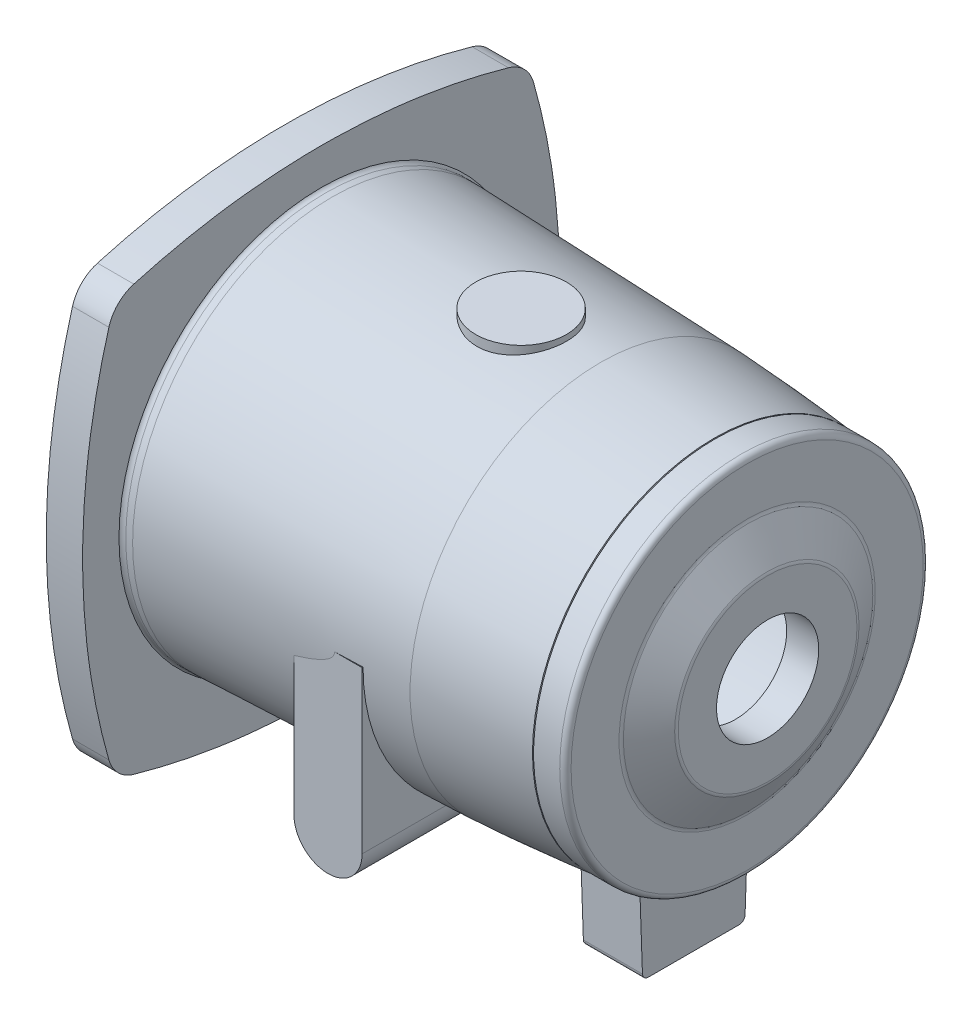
ISO-10303-21;
HEADER;
FILE_DESCRIPTION(('STEP AP214'),'2;1');
FILE_NAME('part.step','',(''),(''),'','','');
FILE_SCHEMA(('AUTOMOTIVE_DESIGN { 1 0 10303 214 1 1 1 1 }'));
ENDSEC;
DATA;
#1=APPLICATION_CONTEXT('core data for automotive mechanical design processes');
#2=APPLICATION_PROTOCOL_DEFINITION('international standard','automotive_design',2000,#1);
#3=PRODUCT_CONTEXT('',#1,'mechanical');
#4=PRODUCT('Part','Part','',(#3));
#5=PRODUCT_RELATED_PRODUCT_CATEGORY('part','',(#4));
#6=PRODUCT_DEFINITION_FORMATION('','',#4);
#7=PRODUCT_DEFINITION_CONTEXT('part definition',#1,'design');
#8=PRODUCT_DEFINITION('design','',#6,#7);
#9=PRODUCT_DEFINITION_SHAPE('','',#8);
#10=(LENGTH_UNIT() NAMED_UNIT(*) SI_UNIT(.MILLI.,.METRE.));
#11=(NAMED_UNIT(*) PLANE_ANGLE_UNIT() SI_UNIT($,.RADIAN.));
#12=(NAMED_UNIT(*) SI_UNIT($,.STERADIAN.) SOLID_ANGLE_UNIT());
#13=UNCERTAINTY_MEASURE_WITH_UNIT(LENGTH_MEASURE(1.E-05),#10,'distance_accuracy_value','');
#14=(GEOMETRIC_REPRESENTATION_CONTEXT(3) GLOBAL_UNCERTAINTY_ASSIGNED_CONTEXT((#13)) GLOBAL_UNIT_ASSIGNED_CONTEXT((#10,
#11,#12)) REPRESENTATION_CONTEXT('',''));
#15=CARTESIAN_POINT('',(0.,0.,0.));
#16=DIRECTION('',(0.,0.,1.));
#17=DIRECTION('',(1.,0.,0.));
#18=AXIS2_PLACEMENT_3D('',#15,#16,#17);
#19=CARTESIAN_POINT('',(112.,0.,0.));
#20=DIRECTION('',(-1.,0.,0.));
#21=DIRECTION('',(0.,-1.,0.));
#22=AXIS2_PLACEMENT_3D('',#19,#20,#21);
#23=PLANE('',#22);
#24=CARTESIAN_POINT('',(112.,-60.,0.));
#25=CARTESIAN_POINT('',(112.,-59.9921026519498,-5.95214076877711));
#26=CARTESIAN_POINT('',(112.,-58.8474593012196,-11.7026056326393));
#27=CARTESIAN_POINT('',(112.,-58.2726169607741,-14.5905013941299));
#28=CARTESIAN_POINT('',(112.,-57.4167108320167,-17.4140464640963));
#29=CARTESIAN_POINT('',(112.,-56.5601993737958,-20.2395884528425));
#30=CARTESIAN_POINT('',(112.,-55.4325468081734,-22.9621248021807));
#31=CARTESIAN_POINT('',(112.,-53.1725936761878,-28.41841935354));
#32=CARTESIAN_POINT('',(112.,-49.88811829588,-33.3337938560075));
#33=CARTESIAN_POINT('',(112.,-46.6039582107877,-38.2486965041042));
#34=CARTESIAN_POINT('',(112.,-42.4262922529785,-42.4263895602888));
#35=CARTESIAN_POINT('',(112.,-38.2487932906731,-46.6039156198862));
#36=CARTESIAN_POINT('',(112.,-33.3341405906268,-49.888054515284));
#37=CARTESIAN_POINT('',(112.,-28.4226453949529,-53.1700834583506));
#38=CARTESIAN_POINT('',(112.,-22.9609667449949,-55.4327023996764));
#39=CARTESIAN_POINT('',(112.,-17.5038487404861,-57.6934319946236));
#40=CARTESIAN_POINT('',(112.,-11.7054081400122,-58.847090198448));
#41=CARTESIAN_POINT('',(112.,-8.81680582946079,-59.4218067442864));
#42=CARTESIAN_POINT('',(112.,-5.88101735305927,-59.7109427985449));
#43=CARTESIAN_POINT('',(112.,-2.94630171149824,-59.9999731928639));
#44=CARTESIAN_POINT('',(112.,0.,-60.));
#45=CARTESIAN_POINT('',(112.,2.94521178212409,-60.0000267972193));
#46=CARTESIAN_POINT('',(112.,5.88101735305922,-59.7109427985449));
#47=CARTESIAN_POINT('',(112.,8.8157279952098,-59.4219666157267));
#48=CARTESIAN_POINT('',(112.,11.7054081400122,-58.847090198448));
#49=CARTESIAN_POINT('',(112.,17.5028013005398,-57.6937498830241));
#50=CARTESIAN_POINT('',(112.,22.9609667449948,-55.4327023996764));
#51=CARTESIAN_POINT('',(112.,28.4216809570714,-53.1705990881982));
#52=CARTESIAN_POINT('',(112.,33.3341405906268,-49.888054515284));
#53=CARTESIAN_POINT('',(112.,38.2479481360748,-46.6046092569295));
#54=CARTESIAN_POINT('',(112.,42.4262922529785,-42.4263895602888));
#55=CARTESIAN_POINT('',(112.,46.6032649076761,-38.2495412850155));
#56=CARTESIAN_POINT('',(112.,49.8881182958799,-33.3337938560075));
#57=CARTESIAN_POINT('',(112.,53.1720777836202,-28.4193841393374));
#58=CARTESIAN_POINT('',(112.,55.4325468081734,-22.9621248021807));
#59=CARTESIAN_POINT('',(112.,56.5598327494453,-20.2406136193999));
#60=CARTESIAN_POINT('',(112.,57.4167108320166,-17.4140464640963));
#61=CARTESIAN_POINT('',(112.,58.2723515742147,-14.5915608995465));
#62=CARTESIAN_POINT('',(112.,58.8474593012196,-11.7026056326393));
#63=CARTESIAN_POINT('',(112.,59.9921019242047,-5.95268926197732));
#64=CARTESIAN_POINT('',(112.,60.,0.));
#65=B_SPLINE_CURVE_WITH_KNOTS('',2,(#24,#25,#26,#27,#28,#29,#30,#31,#32,#33,#34,#35,#36,#37,#38,
#39,#40,#41,#42,#43,#44,#45,#46,#47,#48,#49,#50,#51,#52,#53,#54,#55,#56,#57,#58,#59,#60,#61,#62,
#63,#64),.UNSPECIFIED.,.F.,.F.,(3,2,2,2,2,2,2,2,2,2,2,2,2,2,2,2,2,2,2,2,3),(0.,0.0625,0.09375,
0.125,0.1875,0.25,0.3125,0.375,0.4375,0.46875,0.5,0.53125,0.5625,0.625,0.6875,0.75,0.8125,0.875,
0.90625,0.9375,1.),.UNSPECIFIED.);
#66=CARTESIAN_POINT('',(112.,-60.,0.));
#67=VERTEX_POINT('',#66);
#68=CARTESIAN_POINT('',(112.,60.,0.));
#69=VERTEX_POINT('',#68);
#70=EDGE_CURVE('E442',#67,#69,#65,.T.);
#71=ORIENTED_EDGE('',*,*,#70,.T.);
#72=CARTESIAN_POINT('',(112.,60.,0.));
#73=CARTESIAN_POINT('',(112.,59.9921026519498,5.95214076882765));
#74=CARTESIAN_POINT('',(112.,58.8474593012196,11.7026056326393));
#75=CARTESIAN_POINT('',(112.,58.2726169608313,14.5905013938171));
#76=CARTESIAN_POINT('',(112.,57.4167108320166,17.4140464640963));
#77=CARTESIAN_POINT('',(112.,56.5601993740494,20.2395884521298));
#78=CARTESIAN_POINT('',(112.,55.4325468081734,22.9621248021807));
#79=CARTESIAN_POINT('',(112.,53.1725936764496,28.418419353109));
#80=CARTESIAN_POINT('',(112.,49.8881182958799,33.3337938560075));
#81=CARTESIAN_POINT('',(112.,46.6039582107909,38.2486965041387));
#82=CARTESIAN_POINT('',(112.,42.4262922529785,42.4263895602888));
#83=CARTESIAN_POINT('',(112.,38.2487932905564,46.6039156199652));
#84=CARTESIAN_POINT('',(112.,33.3341405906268,49.888054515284));
#85=CARTESIAN_POINT('',(112.,28.4226453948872,53.1700834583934));
#86=CARTESIAN_POINT('',(112.,22.9609667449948,55.4327023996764));
#87=CARTESIAN_POINT('',(112.,17.503848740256,57.6934319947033));
#88=CARTESIAN_POINT('',(112.,11.7054081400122,58.847090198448));
#89=CARTESIAN_POINT('',(112.,8.81680582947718,59.4218067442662));
#90=CARTESIAN_POINT('',(112.,5.88101735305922,59.7109427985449));
#91=CARTESIAN_POINT('',(112.,2.94630171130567,59.9999731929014));
#92=CARTESIAN_POINT('',(112.,0.,60.));
#93=CARTESIAN_POINT('',(112.,-2.94521178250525,60.0000267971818));
#94=CARTESIAN_POINT('',(112.,-5.88101735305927,59.7109427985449));
#95=CARTESIAN_POINT('',(112.,-8.81572799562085,59.4219666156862));
#96=CARTESIAN_POINT('',(112.,-11.7054081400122,58.847090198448));
#97=CARTESIAN_POINT('',(112.,-17.5028013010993,57.69374988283));
#98=CARTESIAN_POINT('',(112.,-22.9609667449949,55.4327023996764));
#99=CARTESIAN_POINT('',(112.,-28.4216809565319,53.1705990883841));
#100=CARTESIAN_POINT('',(112.,-33.3341405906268,49.888054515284));
#101=CARTESIAN_POINT('',(112.,-38.2479481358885,46.6046092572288));
#102=CARTESIAN_POINT('',(112.,-42.4262922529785,42.4263895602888));
#103=CARTESIAN_POINT('',(112.,-46.6032649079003,38.2495412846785));
#104=CARTESIAN_POINT('',(112.,-49.88811829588,33.3337938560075));
#105=CARTESIAN_POINT('',(112.,-53.1720777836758,28.4193841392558));
#106=CARTESIAN_POINT('',(112.,-55.4325468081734,22.9621248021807));
#107=CARTESIAN_POINT('',(112.,-56.5598327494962,20.2406136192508));
#108=CARTESIAN_POINT('',(112.,-57.4167108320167,17.4140464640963));
#109=CARTESIAN_POINT('',(112.,-58.2723515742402,14.5915608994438));
#110=CARTESIAN_POINT('',(112.,-58.8474593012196,11.7026056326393));
#111=CARTESIAN_POINT('',(112.,-59.9921019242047,5.95268926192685));
#112=CARTESIAN_POINT('',(112.,-60.,0.));
#113=B_SPLINE_CURVE_WITH_KNOTS('',2,(#72,#73,#74,#75,#76,#77,#78,#79,#80,#81,#82,#83,#84,#85,
#86,#87,#88,#89,#90,#91,#92,#93,#94,#95,#96,#97,#98,#99,#100,#101,#102,#103,#104,#105,#106,#107,
#108,#109,#110,#111,#112),.UNSPECIFIED.,.F.,.F.,(3,2,2,2,2,2,2,2,2,2,2,2,2,2,2,2,2,2,2,2,3),(0.,
0.0625,0.09375,0.125,0.1875,0.25,0.3125,0.375,0.4375,0.46875,0.5,0.53125,0.5625,0.625,0.6875,
0.75,0.8125,0.875,0.90625,0.9375,1.),.UNSPECIFIED.);
#114=EDGE_CURVE('E292',#69,#67,#113,.T.);
#115=ORIENTED_EDGE('',*,*,#114,.T.);
#116=EDGE_LOOP('',(#71,#115));
#117=FACE_BOUND('',#116,.T.);
#118=CARTESIAN_POINT('',(112.,0.,0.));
#119=DIRECTION('',(1.,0.,0.));
#120=DIRECTION('',(0.,1.,0.));
#121=AXIS2_PLACEMENT_3D('',#118,#119,#120);
#122=CIRCLE('',#121,67.5000000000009);
#123=CARTESIAN_POINT('',(112.,-67.5000000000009,0.));
#124=VERTEX_POINT('',#123);
#125=CARTESIAN_POINT('',(112.,67.5000000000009,0.));
#126=VERTEX_POINT('',#125);
#127=EDGE_CURVE('E285',#124,#126,#122,.F.);
#128=ORIENTED_EDGE('',*,*,#127,.T.);
#129=CARTESIAN_POINT('',(112.,0.,0.));
#130=DIRECTION('',(1.,0.,0.));
#131=DIRECTION('',(0.,-1.,0.));
#132=AXIS2_PLACEMENT_3D('',#129,#130,#131);
#133=CIRCLE('',#132,67.5000000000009);
#134=EDGE_CURVE('E288',#126,#124,#133,.F.);
#135=ORIENTED_EDGE('',*,*,#134,.T.);
#136=EDGE_LOOP('',(#128,#135));
#137=FACE_BOUND('',#136,.T.);
#138=ADVANCED_FACE('F17',(#117,#137),#23,.T.);
#139=CARTESIAN_POINT('',(107.000000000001,0.,0.));
#140=DIRECTION('',(-1.,0.,0.));
#141=DIRECTION('',(0.,1.,0.));
#142=AXIS2_PLACEMENT_3D('',#139,#140,#141);
#143=TOROIDAL_SURFACE('',#142,67.5000000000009,4.99999999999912);
#144=ORIENTED_EDGE('',*,*,#134,.F.);
#145=ORIENTED_EDGE('',*,*,#127,.F.);
#146=EDGE_LOOP('',(#144,#145));
#147=FACE_BOUND('',#146,.T.);
#148=CARTESIAN_POINT('',(107.000000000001,0.,0.));
#149=DIRECTION('',(-1.,0.,0.));
#150=DIRECTION('',(0.,-1.,0.));
#151=AXIS2_PLACEMENT_3D('',#148,#149,#150);
#152=CIRCLE('',#151,72.5);
#153=CARTESIAN_POINT('',(107.000000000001,-72.5,0.));
#154=VERTEX_POINT('',#153);
#155=EDGE_CURVE('E440',#154,#154,#152,.T.);
#156=ORIENTED_EDGE('',*,*,#155,.T.);
#157=EDGE_LOOP('',(#156));
#158=FACE_BOUND('',#157,.T.);
#159=ADVANCED_FACE('F295',(#147,#158),#143,.F.);
#160=CARTESIAN_POINT('',(228.625,0.,0.));
#161=DIRECTION('',(-1.,0.,0.));
#162=DIRECTION('',(0.,-1.,0.));
#163=AXIS2_PLACEMENT_3D('',#160,#161,#162);
#164=CYLINDRICAL_SURFACE('',#163,60.);
#165=CARTESIAN_POINT('',(198.4,60.,0.));
#166=CARTESIAN_POINT('',(198.4,59.99210265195,-5.95214076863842));
#167=CARTESIAN_POINT('',(198.4,58.8474593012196,-11.7026056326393));
#168=CARTESIAN_POINT('',(198.4,58.2726169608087,-14.5905013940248));
#169=CARTESIAN_POINT('',(198.4,57.4167108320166,-17.4140464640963));
#170=CARTESIAN_POINT('',(198.4,56.560199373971,-20.2395884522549));
#171=CARTESIAN_POINT('',(198.4,55.4325468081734,-22.9621248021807));
#172=CARTESIAN_POINT('',(198.4,53.1725936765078,-28.418419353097));
#173=CARTESIAN_POINT('',(198.4,49.8881182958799,-33.3337938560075));
#174=CARTESIAN_POINT('',(198.4,46.603958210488,-38.2486965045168));
#175=CARTESIAN_POINT('',(198.4,42.4262922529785,-42.4263895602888));
#176=CARTESIAN_POINT('',(198.4,38.2487932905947,-46.6039156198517));
#177=CARTESIAN_POINT('',(198.4,33.3341405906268,-49.888054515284));
#178=CARTESIAN_POINT('',(198.4,28.4226453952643,-53.1700834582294));
#179=CARTESIAN_POINT('',(198.4,22.9609667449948,-55.4327023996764));
#180=CARTESIAN_POINT('',(198.4,17.5038487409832,-57.6934319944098));
#181=CARTESIAN_POINT('',(198.4,11.7054081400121,-58.847090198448));
#182=CARTESIAN_POINT('',(198.4,8.81680583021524,-59.4218067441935));
#183=CARTESIAN_POINT('',(198.4,5.8810173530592,-59.7109427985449));
#184=CARTESIAN_POINT('',(198.4,2.94630171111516,-59.9999731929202));
#185=CARTESIAN_POINT('',(198.4,0.,-60.));
#186=CARTESIAN_POINT('',(198.4,-2.94521178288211,-60.000026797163));
#187=CARTESIAN_POINT('',(198.4,-5.88101735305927,-59.7109427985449));
#188=CARTESIAN_POINT('',(198.4,-8.81572799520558,-59.4219666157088));
#189=CARTESIAN_POINT('',(198.4,-11.7054081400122,-58.847090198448));
#190=CARTESIAN_POINT('',(198.4,-17.5028013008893,-57.6937498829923));
#191=CARTESIAN_POINT('',(198.4,-22.9609667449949,-55.4327023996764));
#192=CARTESIAN_POINT('',(198.4,-28.4216809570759,-53.1705990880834));
#193=CARTESIAN_POINT('',(198.4,-33.3341405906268,-49.888054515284));
#194=CARTESIAN_POINT('',(198.4,-38.2479481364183,-46.6046092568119));
#195=CARTESIAN_POINT('',(198.4,-42.4262922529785,-42.4263895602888));
#196=CARTESIAN_POINT('',(198.4,-46.6032649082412,-38.2495412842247));
#197=CARTESIAN_POINT('',(198.4,-49.88811829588,-33.3337938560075));
#198=CARTESIAN_POINT('',(198.4,-53.1720777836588,-28.419384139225));
#199=CARTESIAN_POINT('',(198.4,-55.4325468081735,-22.9621248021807));
#200=CARTESIAN_POINT('',(198.4,-56.5598327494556,-20.2406136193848));
#201=CARTESIAN_POINT('',(198.4,-57.4167108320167,-17.4140464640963));
#202=CARTESIAN_POINT('',(198.4,-58.272351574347,-14.5915608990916));
#203=CARTESIAN_POINT('',(198.4,-58.8474593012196,-11.7026056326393));
#204=CARTESIAN_POINT('',(198.4,-59.9921019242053,-5.95268926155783));
#205=CARTESIAN_POINT('',(198.4,-60.,0.));
#206=B_SPLINE_CURVE_WITH_KNOTS('',2,(#165,#166,#167,#168,#169,#170,#171,#172,#173,#174,#175,
#176,#177,#178,#179,#180,#181,#182,#183,#184,#185,#186,#187,#188,#189,#190,#191,#192,#193,#194,
#195,#196,#197,#198,#199,#200,#201,#202,#203,#204,#205),.UNSPECIFIED.,.F.,.F.,(3,2,2,2,2,2,2,2,
2,2,2,2,2,2,2,2,2,2,2,2,3),(0.,0.0625,0.09375,0.125,0.1875,0.25,0.3125,0.375,0.4375,0.46875,0.5,
0.53125,0.5625,0.625,0.6875,0.75,0.8125,0.875,0.90625,0.9375,1.),.UNSPECIFIED.);
#207=CARTESIAN_POINT('',(198.4,60.,0.));
#208=VERTEX_POINT('',#207);
#209=CARTESIAN_POINT('',(198.4,-60.,0.));
#210=VERTEX_POINT('',#209);
#211=EDGE_CURVE('E396',#208,#210,#206,.T.);
#212=ORIENTED_EDGE('',*,*,#211,.F.);
#213=CARTESIAN_POINT('',(198.4,-60.,0.));
#214=CARTESIAN_POINT('',(198.4,-59.9921026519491,5.95214076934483));
#215=CARTESIAN_POINT('',(198.4,-58.8474593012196,11.7026056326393));
#216=CARTESIAN_POINT('',(198.4,-58.2726169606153,14.5905013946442));
#217=CARTESIAN_POINT('',(198.4,-57.4167108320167,17.4140464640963));
#218=CARTESIAN_POINT('',(198.4,-56.5601993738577,20.2395884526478));
#219=CARTESIAN_POINT('',(198.4,-55.4325468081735,22.9621248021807));
#220=CARTESIAN_POINT('',(198.4,-53.1725936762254,28.4184193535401));
#221=CARTESIAN_POINT('',(198.4,-49.88811829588,33.3337938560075));
#222=CARTESIAN_POINT('',(198.4,-46.6039582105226,38.2486965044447));
#223=CARTESIAN_POINT('',(198.4,-42.4262922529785,42.4263895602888));
#224=CARTESIAN_POINT('',(198.4,-38.2487932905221,46.603915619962));
#225=CARTESIAN_POINT('',(198.4,-33.3341405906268,49.888054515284));
#226=CARTESIAN_POINT('',(198.4,-28.422645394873,53.1700834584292));
#227=CARTESIAN_POINT('',(198.4,-22.9609667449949,55.4327023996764));
#228=CARTESIAN_POINT('',(198.4,-17.5038487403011,57.6934319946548));
#229=CARTESIAN_POINT('',(198.4,-11.7054081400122,58.847090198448));
#230=CARTESIAN_POINT('',(198.4,-8.81680582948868,59.4218067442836));
#231=CARTESIAN_POINT('',(198.4,-5.88101735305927,59.7109427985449));
#232=CARTESIAN_POINT('',(198.4,-2.94630171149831,59.9999731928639));
#233=CARTESIAN_POINT('',(198.4,0.,60.));
#234=CARTESIAN_POINT('',(198.4,2.94521178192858,60.0000267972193));
#235=CARTESIAN_POINT('',(198.4,5.8810173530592,59.7109427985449));
#236=CARTESIAN_POINT('',(198.4,8.81572799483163,59.4219666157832));
#237=CARTESIAN_POINT('',(198.4,11.7054081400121,58.847090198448));
#238=CARTESIAN_POINT('',(198.4,17.5028013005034,57.6937498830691));
#239=CARTESIAN_POINT('',(198.4,22.9609667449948,55.4327023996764));
#240=CARTESIAN_POINT('',(198.4,28.4216809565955,53.1705990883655));
#241=CARTESIAN_POINT('',(198.4,33.3341405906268,49.888054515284));
#242=CARTESIAN_POINT('',(198.4,38.2479481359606,46.6046092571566));
#243=CARTESIAN_POINT('',(198.4,42.4262922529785,42.4263895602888));
#244=CARTESIAN_POINT('',(198.4,46.6032649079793,38.2495412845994));
#245=CARTESIAN_POINT('',(198.4,49.8881182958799,33.3337938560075));
#246=CARTESIAN_POINT('',(198.4,53.1720777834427,28.4193841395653));
#247=CARTESIAN_POINT('',(198.4,55.4325468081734,22.9621248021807));
#248=CARTESIAN_POINT('',(198.4,56.5598327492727,20.2406136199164));
#249=CARTESIAN_POINT('',(198.4,57.4167108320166,17.4140464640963));
#250=CARTESIAN_POINT('',(198.4,58.2723515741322,14.5915608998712));
#251=CARTESIAN_POINT('',(198.4,58.8474593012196,11.7026056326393));
#252=CARTESIAN_POINT('',(198.4,59.9921019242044,5.95268926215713));
#253=CARTESIAN_POINT('',(198.4,60.,0.));
#254=B_SPLINE_CURVE_WITH_KNOTS('',2,(#213,#214,#215,#216,#217,#218,#219,#220,#221,#222,#223,
#224,#225,#226,#227,#228,#229,#230,#231,#232,#233,#234,#235,#236,#237,#238,#239,#240,#241,#242,
#243,#244,#245,#246,#247,#248,#249,#250,#251,#252,#253),.UNSPECIFIED.,.F.,.F.,(3,2,2,2,2,2,2,2,
2,2,2,2,2,2,2,2,2,2,2,2,3),(0.,0.0625,0.09375,0.125,0.1875,0.25,0.3125,0.375,0.4375,0.46875,0.5,
0.53125,0.5625,0.625,0.6875,0.75,0.8125,0.875,0.90625,0.9375,1.),.UNSPECIFIED.);
#255=EDGE_CURVE('E386',#210,#208,#254,.T.);
#256=ORIENTED_EDGE('',*,*,#255,.F.);
#257=EDGE_LOOP('',(#212,#256));
#258=FACE_BOUND('',#257,.T.);
#259=ORIENTED_EDGE('',*,*,#70,.F.);
#260=ORIENTED_EDGE('',*,*,#114,.F.);
#261=EDGE_LOOP('',(#259,#260));
#262=FACE_BOUND('',#261,.T.);
#263=ADVANCED_FACE('F303',(#258,#262),#164,.F.);
#264=CARTESIAN_POINT('',(228.625,0.,0.));
#265=DIRECTION('',(-1.,0.,0.));
#266=DIRECTION('',(0.,-1.,0.));
#267=AXIS2_PLACEMENT_3D('',#264,#265,#266);
#268=CYLINDRICAL_SURFACE('',#267,72.5);
#269=ORIENTED_EDGE('',*,*,#155,.F.);
#270=EDGE_LOOP('',(#269));
#271=FACE_BOUND('',#270,.T.);
#272=CARTESIAN_POINT('',(81.9999999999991,0.,0.));
#273=DIRECTION('',(-1.,0.,0.));
#274=DIRECTION('',(0.,1.,0.));
#275=AXIS2_PLACEMENT_3D('',#272,#273,#274);
#276=CIRCLE('',#275,72.5);
#277=CARTESIAN_POINT('',(81.9999999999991,72.5,0.));
#278=VERTEX_POINT('',#277);
#279=EDGE_CURVE('E433',#278,#278,#276,.T.);
#280=ORIENTED_EDGE('',*,*,#279,.T.);
#281=EDGE_LOOP('',(#280));
#282=FACE_BOUND('',#281,.T.);
#283=ADVANCED_FACE('F312',(#271,#282),#268,.F.);
#284=CARTESIAN_POINT('',(198.4,0.,0.));
#285=DIRECTION('',(-1.,0.,0.));
#286=DIRECTION('',(0.,-1.,0.));
#287=AXIS2_PLACEMENT_3D('',#284,#285,#286);
#288=PLANE('',#287);
#289=CARTESIAN_POINT('',(198.4,-22.5,0.));
#290=CARTESIAN_POINT('',(198.4,-22.4949591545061,-1.79943251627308));
#291=CARTESIAN_POINT('',(198.4,-22.2214331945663,-3.52830092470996));
#292=CARTESIAN_POINT('',(198.4,-21.8079896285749,-6.14154290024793));
#293=CARTESIAN_POINT('',(198.4,-20.7875278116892,-8.60846652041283));
#294=CARTESIAN_POINT('',(198.4,-19.9401135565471,-10.657054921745));
#295=CARTESIAN_POINT('',(198.4,-18.707823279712,-12.501023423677));
#296=CARTESIAN_POINT('',(198.4,-17.4782037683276,-14.3409954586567));
#297=CARTESIAN_POINT('',(198.4,-15.9098393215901,-15.9095421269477));
#298=CARTESIAN_POINT('',(198.4,-14.3422208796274,-17.4773427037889));
#299=CARTESIAN_POINT('',(198.4,-12.5002503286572,-18.7080253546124));
#300=CARTESIAN_POINT('',(198.4,-10.6568114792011,-19.939689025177));
#301=CARTESIAN_POINT('',(198.4,-8.6103575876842,-20.7871899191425));
#302=CARTESIAN_POINT('',(198.4,-6.56131751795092,-21.6357618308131));
#303=CARTESIAN_POINT('',(198.4,-4.38953371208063,-22.067641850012));
#304=CARTESIAN_POINT('',(198.4,-2.21561458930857,-22.4999464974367));
#305=CARTESIAN_POINT('',(198.4,0.,-22.5));
#306=CARTESIAN_POINT('',(198.4,2.21452895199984,-22.5000534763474));
#307=CARTESIAN_POINT('',(198.4,4.38953371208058,-22.067641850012));
#308=CARTESIAN_POINT('',(198.4,6.56027641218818,-21.6360775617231));
#309=CARTESIAN_POINT('',(198.4,8.61035758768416,-20.7871899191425));
#310=CARTESIAN_POINT('',(198.4,10.6558535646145,-19.9402008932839));
#311=CARTESIAN_POINT('',(198.4,12.5002503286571,-18.7080253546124));
#312=CARTESIAN_POINT('',(198.4,14.3413825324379,-17.47803075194));
#313=CARTESIAN_POINT('',(198.4,15.9098393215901,-15.9095421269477));
#314=CARTESIAN_POINT('',(198.4,17.4775145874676,-14.3418350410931));
#315=CARTESIAN_POINT('',(198.4,18.7078232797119,-12.501023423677));
#316=CARTESIAN_POINT('',(198.4,19.9396030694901,-10.6580107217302));
#317=CARTESIAN_POINT('',(198.4,20.7875278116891,-8.60846652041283));
#318=CARTESIAN_POINT('',(198.4,21.7587819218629,-6.26081922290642));
#319=CARTESIAN_POINT('',(198.4,22.1808168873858,-3.77593247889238));
#320=CARTESIAN_POINT('',(198.4,22.494597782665,-1.9284315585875));
#321=CARTESIAN_POINT('',(198.4,22.5,0.));
#322=B_SPLINE_CURVE_WITH_KNOTS('',2,(#289,#290,#291,#292,#293,#294,#295,#296,#297,#298,#299,
#300,#301,#302,#303,#304,#305,#306,#307,#308,#309,#310,#311,#312,#313,#314,#315,#316,#317,#318,
#319,#320,#321),.UNSPECIFIED.,.F.,.F.,(3,2,2,2,2,2,2,2,2,2,2,2,2,2,2,2,3),(0.,0.05,0.125,0.1875,
0.25,0.3125,0.375,0.4375,0.5,0.5625,0.625,0.6875,0.75,0.8125,0.875,0.946428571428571,1.),.UNSPECIFIED.);
#323=CARTESIAN_POINT('',(198.4,-22.5,0.));
#324=VERTEX_POINT('',#323);
#325=CARTESIAN_POINT('',(198.4,22.5,0.));
#326=VERTEX_POINT('',#325);
#327=EDGE_CURVE('E408',#324,#326,#322,.T.);
#328=ORIENTED_EDGE('',*,*,#327,.T.);
#329=CARTESIAN_POINT('',(198.4,22.5,0.));
#330=CARTESIAN_POINT('',(198.4,22.494959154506,1.79943251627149));
#331=CARTESIAN_POINT('',(198.4,22.2214331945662,3.52830092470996));
#332=CARTESIAN_POINT('',(198.4,21.8079896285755,6.14154290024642));
#333=CARTESIAN_POINT('',(198.4,20.7875278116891,8.60846652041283));
#334=CARTESIAN_POINT('',(198.4,19.9401135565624,10.6570549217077));
#335=CARTESIAN_POINT('',(198.4,18.7078232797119,12.501023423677));
#336=CARTESIAN_POINT('',(198.4,17.4782037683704,14.3409954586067));
#337=CARTESIAN_POINT('',(198.4,15.9098393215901,15.9095421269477));
#338=CARTESIAN_POINT('',(198.4,14.3422208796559,17.4773427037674));
#339=CARTESIAN_POINT('',(198.4,12.5002503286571,18.7080253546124));
#340=CARTESIAN_POINT('',(198.4,10.6568114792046,19.939689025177));
#341=CARTESIAN_POINT('',(198.4,8.61035758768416,20.7871899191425));
#342=CARTESIAN_POINT('',(198.4,6.56131751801,21.6357618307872));
#343=CARTESIAN_POINT('',(198.4,4.38953371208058,22.067641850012));
#344=CARTESIAN_POINT('',(198.4,2.21561458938,22.4999464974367));
#345=CARTESIAN_POINT('',(198.4,0.,22.5));
#346=CARTESIAN_POINT('',(198.4,-2.21452895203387,22.5000534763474));
#347=CARTESIAN_POINT('',(198.4,-4.38953371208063,22.067641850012));
#348=CARTESIAN_POINT('',(198.4,-6.56027641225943,21.6360775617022));
#349=CARTESIAN_POINT('',(198.4,-8.6103575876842,20.7871899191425));
#350=CARTESIAN_POINT('',(198.4,-10.655853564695,19.940200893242));
#351=CARTESIAN_POINT('',(198.4,-12.5002503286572,18.7080253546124));
#352=CARTESIAN_POINT('',(198.4,-14.341382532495,17.47803075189));
#353=CARTESIAN_POINT('',(198.4,-15.9098393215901,15.9095421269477));
#354=CARTESIAN_POINT('',(198.4,-17.4775145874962,14.3418350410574));
#355=CARTESIAN_POINT('',(198.4,-18.707823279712,12.501023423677));
#356=CARTESIAN_POINT('',(198.4,-19.9396030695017,10.6580107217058));
#357=CARTESIAN_POINT('',(198.4,-20.7875278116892,8.60846652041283));
#358=CARTESIAN_POINT('',(198.4,-21.7587819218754,6.26081922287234));
#359=CARTESIAN_POINT('',(198.4,-22.1808168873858,3.77593247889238));
#360=CARTESIAN_POINT('',(198.4,-22.4945977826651,1.92843155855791));
#361=CARTESIAN_POINT('',(198.4,-22.5,0.));
#362=B_SPLINE_CURVE_WITH_KNOTS('',2,(#329,#330,#331,#332,#333,#334,#335,#336,#337,#338,#339,
#340,#341,#342,#343,#344,#345,#346,#347,#348,#349,#350,#351,#352,#353,#354,#355,#356,#357,#358,
#359,#360,#361),.UNSPECIFIED.,.F.,.F.,(3,2,2,2,2,2,2,2,2,2,2,2,2,2,2,2,3),(0.,0.05,0.125,0.1875,
0.25,0.3125,0.375,0.4375,0.5,0.5625,0.625,0.6875,0.75,0.8125,0.875,0.946428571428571,1.),.UNSPECIFIED.);
#363=EDGE_CURVE('E419',#326,#324,#362,.T.);
#364=ORIENTED_EDGE('',*,*,#363,.T.);
#365=EDGE_LOOP('',(#328,#364));
#366=FACE_BOUND('',#365,.T.);
#367=ORIENTED_EDGE('',*,*,#255,.T.);
#368=ORIENTED_EDGE('',*,*,#211,.T.);
#369=EDGE_LOOP('',(#367,#368));
#370=FACE_BOUND('',#369,.T.);
#371=ADVANCED_FACE('F357',(#366,#370),#288,.T.);
#372=CARTESIAN_POINT('',(81.9999999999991,0.,0.));
#373=DIRECTION('',(-1.,0.,0.));
#374=DIRECTION('',(0.,1.,0.));
#375=AXIS2_PLACEMENT_3D('',#372,#373,#374);
#376=TOROIDAL_SURFACE('',#375,67.5000000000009,4.99999999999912);
#377=ORIENTED_EDGE('',*,*,#279,.F.);
#378=EDGE_LOOP('',(#377));
#379=FACE_BOUND('',#378,.T.);
#380=CARTESIAN_POINT('',(77.,0.,0.));
#381=DIRECTION('',(-1.,0.,0.));
#382=DIRECTION('',(0.,1.,0.));
#383=AXIS2_PLACEMENT_3D('',#380,#381,#382);
#384=CIRCLE('',#383,67.5000000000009);
#385=CARTESIAN_POINT('',(77.,67.5000000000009,0.));
#386=VERTEX_POINT('',#385);
#387=CARTESIAN_POINT('',(77.,-67.5000000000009,0.));
#388=VERTEX_POINT('',#387);
#389=EDGE_CURVE('E372',#386,#388,#384,.T.);
#390=ORIENTED_EDGE('',*,*,#389,.T.);
#391=CARTESIAN_POINT('',(77.,0.,0.));
#392=DIRECTION('',(-1.,0.,0.));
#393=DIRECTION('',(0.,-1.,0.));
#394=AXIS2_PLACEMENT_3D('',#391,#392,#393);
#395=CIRCLE('',#394,67.5000000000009);
#396=EDGE_CURVE('E1764',#388,#386,#395,.T.);
#397=ORIENTED_EDGE('',*,*,#396,.T.);
#398=EDGE_LOOP('',(#390,#397));
#399=FACE_BOUND('',#398,.T.);
#400=ADVANCED_FACE('F346',(#379,#399),#376,.F.);
#401=CARTESIAN_POINT('',(228.625,0.,0.));
#402=DIRECTION('',(-1.,0.,0.));
#403=DIRECTION('',(0.,-1.,0.));
#404=AXIS2_PLACEMENT_3D('',#401,#402,#403);
#405=CYLINDRICAL_SURFACE('',#404,22.5);
#406=ORIENTED_EDGE('',*,*,#363,.F.);
#407=ORIENTED_EDGE('',*,*,#327,.F.);
#408=EDGE_LOOP('',(#406,#407));
#409=FACE_BOUND('',#408,.T.);
#410=CARTESIAN_POINT('',(212.5,0.,0.));
#411=DIRECTION('',(1.,0.,0.));
#412=DIRECTION('',(0.,-1.,0.));
#413=AXIS2_PLACEMENT_3D('',#410,#411,#412);
#414=CIRCLE('',#413,22.5);
#415=CARTESIAN_POINT('',(212.5,-22.5,0.));
#416=VERTEX_POINT('',#415);
#417=CARTESIAN_POINT('',(212.5,22.5,0.));
#418=VERTEX_POINT('',#417);
#419=EDGE_CURVE('E1722',#416,#418,#414,.T.);
#420=ORIENTED_EDGE('',*,*,#419,.T.);
#421=CARTESIAN_POINT('',(212.5,0.,0.));
#422=DIRECTION('',(1.,0.,0.));
#423=DIRECTION('',(0.,1.,0.));
#424=AXIS2_PLACEMENT_3D('',#421,#422,#423);
#425=CIRCLE('',#424,22.5);
#426=EDGE_CURVE('E1731',#418,#416,#425,.T.);
#427=ORIENTED_EDGE('',*,*,#426,.T.);
#428=EDGE_LOOP('',(#420,#427));
#429=FACE_BOUND('',#428,.T.);
#430=ADVANCED_FACE('F356',(#409,#429),#405,.F.);
#431=CARTESIAN_POINT('',(77.,0.,0.));
#432=DIRECTION('',(-1.,0.,0.));
#433=DIRECTION('',(0.,-1.,0.));
#434=AXIS2_PLACEMENT_3D('',#431,#432,#433);
#435=PLANE('',#434);
#436=CARTESIAN_POINT('',(77.,60.,0.));
#437=CARTESIAN_POINT('',(77.,59.9921019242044,-5.95268926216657));
#438=CARTESIAN_POINT('',(77.,58.8474593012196,-11.7026056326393));
#439=CARTESIAN_POINT('',(77.,58.2723515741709,-14.5915608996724));
#440=CARTESIAN_POINT('',(77.,57.4167108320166,-17.4140464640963));
#441=CARTESIAN_POINT('',(77.,56.5598327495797,-20.2406136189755));
#442=CARTESIAN_POINT('',(77.,55.4325468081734,-22.9621248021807));
#443=CARTESIAN_POINT('',(77.,53.1720777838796,-28.4193841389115));
#444=CARTESIAN_POINT('',(77.,49.8881182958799,-33.3337938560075));
#445=CARTESIAN_POINT('',(77.,46.6032649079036,-38.2495412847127));
#446=CARTESIAN_POINT('',(77.,42.4262922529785,-42.4263895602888));
#447=CARTESIAN_POINT('',(77.,38.2479481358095,-46.60460925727));
#448=CARTESIAN_POINT('',(77.,33.3341405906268,-49.888054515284));
#449=CARTESIAN_POINT('',(77.,28.4216809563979,-53.1705990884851));
#450=CARTESIAN_POINT('',(77.,22.9609667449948,-55.4327023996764));
#451=CARTESIAN_POINT('',(77.,17.5028013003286,-57.6937498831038));
#452=CARTESIAN_POINT('',(77.,11.7054081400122,-58.847090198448));
#453=CARTESIAN_POINT('',(77.,8.81572799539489,-59.4219666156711));
#454=CARTESIAN_POINT('',(77.,5.88101735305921,-59.7109427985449));
#455=CARTESIAN_POINT('',(77.,2.94521178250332,-60.0000267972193));
#456=CARTESIAN_POINT('',(77.,0.,-60.));
#457=CARTESIAN_POINT('',(77.,-2.94630171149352,-59.9999731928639));
#458=CARTESIAN_POINT('',(77.,-5.88101735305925,-59.7109427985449));
#459=CARTESIAN_POINT('',(77.,-8.81680582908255,-59.4218067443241));
#460=CARTESIAN_POINT('',(77.,-11.7054081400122,-58.847090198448));
#461=CARTESIAN_POINT('',(77.,-17.5038487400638,-57.693431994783));
#462=CARTESIAN_POINT('',(77.,-22.9609667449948,-55.4327023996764));
#463=CARTESIAN_POINT('',(77.,-28.4226453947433,-53.170083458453));
#464=CARTESIAN_POINT('',(77.,-33.3341405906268,-49.888054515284));
#465=CARTESIAN_POINT('',(77.,-38.2487932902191,-46.6039156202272));
#466=CARTESIAN_POINT('',(77.,-42.4262922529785,-42.4263895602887));
#467=CARTESIAN_POINT('',(77.,-46.6039582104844,-38.2486965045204));
#468=CARTESIAN_POINT('',(77.,-49.88811829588,-33.3337938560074));
#469=CARTESIAN_POINT('',(77.,-53.1725936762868,-28.4184193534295));
#470=CARTESIAN_POINT('',(77.,-55.4325468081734,-22.9621248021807));
#471=CARTESIAN_POINT('',(77.,-56.5601993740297,-20.2395884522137));
#472=CARTESIAN_POINT('',(77.,-57.4167108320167,-17.4140464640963));
#473=CARTESIAN_POINT('',(77.,-58.272616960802,-14.590501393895));
#474=CARTESIAN_POINT('',(77.,-58.8474593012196,-11.7026056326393));
#475=CARTESIAN_POINT('',(77.,-59.9921026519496,-5.95214076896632));
#476=CARTESIAN_POINT('',(77.,-60.,0.));
#477=B_SPLINE_CURVE_WITH_KNOTS('',2,(#436,#437,#438,#439,#440,#441,#442,#443,#444,#445,#446,
#447,#448,#449,#450,#451,#452,#453,#454,#455,#456,#457,#458,#459,#460,#461,#462,#463,#464,#465,
#466,#467,#468,#469,#470,#471,#472,#473,#474,#475,#476),.UNSPECIFIED.,.F.,.F.,(3,2,2,2,2,2,2,2,
2,2,2,2,2,2,2,2,2,2,2,2,3),(0.,0.0625,0.09375,0.125,0.1875,0.25,0.3125,0.375,0.4375,0.46875,0.5,
0.53125,0.5625,0.625,0.6875,0.75,0.8125,0.875,0.90625,0.9375,1.),.UNSPECIFIED.);
#478=CARTESIAN_POINT('',(77.,60.,0.));
#479=VERTEX_POINT('',#478);
#480=CARTESIAN_POINT('',(77.,-60.,0.));
#481=VERTEX_POINT('',#480);
#482=EDGE_CURVE('E1736',#479,#481,#477,.T.);
#483=ORIENTED_EDGE('',*,*,#482,.T.);
#484=CARTESIAN_POINT('',(77.,-60.,0.));
#485=CARTESIAN_POINT('',(77.,-59.992101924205,5.95268926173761));
#486=CARTESIAN_POINT('',(77.,-58.8474593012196,11.7026056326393));
#487=CARTESIAN_POINT('',(77.,-58.2723515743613,14.5915608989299));
#488=CARTESIAN_POINT('',(77.,-57.4167108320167,17.4140464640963));
#489=CARTESIAN_POINT('',(77.,-56.559832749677,20.240613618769));
#490=CARTESIAN_POINT('',(77.,-55.4325468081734,22.9621248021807));
#491=CARTESIAN_POINT('',(77.,-53.1720777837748,28.4193841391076));
#492=CARTESIAN_POINT('',(77.,-49.88811829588,33.3337938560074));
#493=CARTESIAN_POINT('',(77.,-46.6032649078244,38.2495412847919));
#494=CARTESIAN_POINT('',(77.,-42.4262922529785,42.4263895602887));
#495=CARTESIAN_POINT('',(77.,-38.2479481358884,46.6046092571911));
#496=CARTESIAN_POINT('',(77.,-33.3341405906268,49.888054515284));
#497=CARTESIAN_POINT('',(77.,-28.4216809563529,53.1705990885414));
#498=CARTESIAN_POINT('',(77.,-22.9609667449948,55.4327023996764));
#499=CARTESIAN_POINT('',(77.,-17.502801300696,57.693749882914));
#500=CARTESIAN_POINT('',(77.,-11.7054081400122,58.847090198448));
#501=CARTESIAN_POINT('',(77.,-8.81572799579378,59.4219666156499));
#502=CARTESIAN_POINT('',(77.,-5.88101735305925,59.7109427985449));
#503=CARTESIAN_POINT('',(77.,-2.94521178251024,60.0000267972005));
#504=CARTESIAN_POINT('',(77.,0.,60.));
#505=CARTESIAN_POINT('',(77.,2.94630171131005,59.9999731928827));
#506=CARTESIAN_POINT('',(77.,5.88101735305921,59.7109427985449));
#507=CARTESIAN_POINT('',(77.,8.81680582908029,59.4218067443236));
#508=CARTESIAN_POINT('',(77.,11.7054081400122,58.847090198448));
#509=CARTESIAN_POINT('',(77.,17.5038487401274,57.6934319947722));
#510=CARTESIAN_POINT('',(77.,22.9609667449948,55.4327023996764));
#511=CARTESIAN_POINT('',(77.,28.4226453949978,53.170083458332));
#512=CARTESIAN_POINT('',(77.,33.3341405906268,49.888054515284));
#513=CARTESIAN_POINT('',(77.,38.2487932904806,46.6039156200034));
#514=CARTESIAN_POINT('',(77.,42.4262922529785,42.4263895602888));
#515=CARTESIAN_POINT('',(77.,46.6039582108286,38.2486965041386));
#516=CARTESIAN_POINT('',(77.,49.8881182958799,33.3337938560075));
#517=CARTESIAN_POINT('',(77.,53.1725936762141,28.4184193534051));
#518=CARTESIAN_POINT('',(77.,55.4325468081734,22.9621248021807));
#519=CARTESIAN_POINT('',(77.,56.5601993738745,20.239588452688));
#520=CARTESIAN_POINT('',(77.,57.4167108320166,17.4140464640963));
#521=CARTESIAN_POINT('',(77.,58.2726169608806,14.5905013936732));
#522=CARTESIAN_POINT('',(77.,58.8474593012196,11.7026056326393));
#523=CARTESIAN_POINT('',(77.,59.9921026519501,5.95214076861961));
#524=CARTESIAN_POINT('',(77.,60.,0.));
#525=B_SPLINE_CURVE_WITH_KNOTS('',2,(#484,#485,#486,#487,#488,#489,#490,#491,#492,#493,#494,
#495,#496,#497,#498,#499,#500,#501,#502,#503,#504,#505,#506,#507,#508,#509,#510,#511,#512,#513,
#514,#515,#516,#517,#518,#519,#520,#521,#522,#523,#524),.UNSPECIFIED.,.F.,.F.,(3,2,2,2,2,2,2,2,
2,2,2,2,2,2,2,2,2,2,2,2,3),(0.,0.0625,0.09375,0.125,0.1875,0.25,0.3125,0.375,0.4375,0.46875,0.5,
0.53125,0.5625,0.625,0.6875,0.75,0.8125,0.875,0.90625,0.9375,1.),.UNSPECIFIED.);
#526=EDGE_CURVE('E1795',#481,#479,#525,.T.);
#527=ORIENTED_EDGE('',*,*,#526,.T.);
#528=EDGE_LOOP('',(#483,#527));
#529=FACE_BOUND('',#528,.T.);
#530=ORIENTED_EDGE('',*,*,#396,.F.);
#531=ORIENTED_EDGE('',*,*,#389,.F.);
#532=EDGE_LOOP('',(#530,#531));
#533=FACE_BOUND('',#532,.T.);
#534=ADVANCED_FACE('F1769',(#529,#533),#435,.F.);
#535=CARTESIAN_POINT('',(212.5,0.,0.));
#536=DIRECTION('',(-1.,0.,0.));
#537=DIRECTION('',(0.,-1.,0.));
#538=AXIS2_PLACEMENT_3D('',#535,#536,#537);
#539=PLANE('',#538);
#540=ORIENTED_EDGE('',*,*,#419,.F.);
#541=ORIENTED_EDGE('',*,*,#426,.F.);
#542=EDGE_LOOP('',(#540,#541));
#543=FACE_BOUND('',#542,.T.);
#544=CARTESIAN_POINT('',(212.5,0.,0.));
#545=DIRECTION('',(-1.,0.,0.));
#546=DIRECTION('',(0.,-1.,0.));
#547=AXIS2_PLACEMENT_3D('',#544,#545,#546);
#548=CIRCLE('',#547,39.3301270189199);
#549=CARTESIAN_POINT('',(212.5,-39.3301270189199,0.));
#550=VERTEX_POINT('',#549);
#551=CARTESIAN_POINT('',(212.5,39.3301270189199,0.));
#552=VERTEX_POINT('',#551);
#553=EDGE_CURVE('E1803',#550,#552,#548,.T.);
#554=ORIENTED_EDGE('',*,*,#553,.F.);
#555=CARTESIAN_POINT('',(212.5,0.,0.));
#556=DIRECTION('',(-1.,0.,0.));
#557=DIRECTION('',(0.,1.,0.));
#558=AXIS2_PLACEMENT_3D('',#555,#556,#557);
#559=CIRCLE('',#558,39.3301270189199);
#560=EDGE_CURVE('E1753',#552,#550,#559,.T.);
#561=ORIENTED_EDGE('',*,*,#560,.F.);
#562=EDGE_LOOP('',(#554,#561));
#563=FACE_BOUND('',#562,.T.);
#564=ADVANCED_FACE('F1680',(#543,#563),#539,.F.);
#565=CARTESIAN_POINT('',(228.625,0.,0.));
#566=DIRECTION('',(-1.,0.,0.));
#567=DIRECTION('',(0.,-1.,0.));
#568=AXIS2_PLACEMENT_3D('',#565,#566,#567);
#569=CYLINDRICAL_SURFACE('',#568,60.);
#570=ORIENTED_EDGE('',*,*,#526,.F.);
#571=ORIENTED_EDGE('',*,*,#482,.F.);
#572=EDGE_LOOP('',(#570,#571));
#573=FACE_BOUND('',#572,.T.);
#574=CARTESIAN_POINT('',(5.00000000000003,0.,0.));
#575=DIRECTION('',(-1.,0.,0.));
#576=DIRECTION('',(0.,1.,0.));
#577=AXIS2_PLACEMENT_3D('',#574,#575,#576);
#578=CIRCLE('',#577,60.);
#579=CARTESIAN_POINT('',(5.00000000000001,60.,0.));
#580=VERTEX_POINT('',#579);
#581=CARTESIAN_POINT('',(5.,-60.,0.));
#582=VERTEX_POINT('',#581);
#583=EDGE_CURVE('E1602',#580,#582,#578,.T.);
#584=ORIENTED_EDGE('',*,*,#583,.T.);
#585=CARTESIAN_POINT('',(5.,0.,0.));
#586=DIRECTION('',(-1.,0.,0.));
#587=DIRECTION('',(0.,-1.,0.));
#588=AXIS2_PLACEMENT_3D('',#585,#586,#587);
#589=CIRCLE('',#588,60.);
#590=EDGE_CURVE('E1662',#582,#580,#589,.T.);
#591=ORIENTED_EDGE('',*,*,#590,.T.);
#592=EDGE_LOOP('',(#584,#591));
#593=FACE_BOUND('',#592,.T.);
#594=ADVANCED_FACE('F1671',(#573,#593),#569,.F.);
#595=CARTESIAN_POINT('',(209.999999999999,0.,0.));
#596=DIRECTION('',(-1.,0.,0.));
#597=DIRECTION('',(0.,1.,0.));
#598=AXIS2_PLACEMENT_3D('',#595,#596,#597);
#599=TOROIDAL_SURFACE('',#598,39.3301270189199,2.50000000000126);
#600=CARTESIAN_POINT('',(212.165063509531,0.,0.));
#601=DIRECTION('',(-1.,0.,0.));
#602=DIRECTION('',(0.,1.,0.));
#603=AXIS2_PLACEMENT_3D('',#600,#601,#602);
#604=CIRCLE('',#603,40.5801270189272);
#605=CARTESIAN_POINT('',(212.165063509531,40.5801270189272,0.));
#606=VERTEX_POINT('',#605);
#607=EDGE_CURVE('E1654',#606,#606,#604,.T.);
#608=ORIENTED_EDGE('',*,*,#607,.F.);
#609=EDGE_LOOP('',(#608));
#610=FACE_BOUND('',#609,.T.);
#611=ORIENTED_EDGE('',*,*,#560,.T.);
#612=ORIENTED_EDGE('',*,*,#553,.T.);
#613=EDGE_LOOP('',(#611,#612));
#614=FACE_BOUND('',#613,.T.);
#615=ADVANCED_FACE('F1618',(#610,#614),#599,.T.);
#616=CARTESIAN_POINT('',(5.,0.,0.));
#617=DIRECTION('',(-1.,0.,0.));
#618=DIRECTION('',(0.,-1.,0.));
#619=AXIS2_PLACEMENT_3D('',#616,#617,#618);
#620=PLANE('',#619);
#621=CARTESIAN_POINT('',(5.,22.5,0.));
#622=CARTESIAN_POINT('',(5.,22.4945977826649,-1.92843155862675));
#623=CARTESIAN_POINT('',(5.,22.1808168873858,-3.77593247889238));
#624=CARTESIAN_POINT('',(5.,21.7587819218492,-6.26081922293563));
#625=CARTESIAN_POINT('',(5.,20.7875278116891,-8.60846652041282));
#626=CARTESIAN_POINT('',(5.,19.9396030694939,-10.6580107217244));
#627=CARTESIAN_POINT('',(5.,18.7078232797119,-12.501023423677));
#628=CARTESIAN_POINT('',(5.,17.4775145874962,-14.3418350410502));
#629=CARTESIAN_POINT('',(5.,15.9098393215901,-15.9095421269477));
#630=CARTESIAN_POINT('',(5.,14.3413825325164,-17.4780307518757));
#631=CARTESIAN_POINT('',(5.,12.5002503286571,-18.7080253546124));
#632=CARTESIAN_POINT('',(5.,10.6558535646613,-19.9402008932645));
#633=CARTESIAN_POINT('',(5.,8.61035758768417,-20.7871899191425));
#634=CARTESIAN_POINT('',(5.,6.56027641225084,-21.6360775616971));
#635=CARTESIAN_POINT('',(5.,4.3895337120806,-22.067641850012));
#636=CARTESIAN_POINT('',(5.,2.214528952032,-22.5000534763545));
#637=CARTESIAN_POINT('',(5.,0.,-22.5));
#638=CARTESIAN_POINT('',(5.,-2.21561458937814,-22.4999464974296));
#639=CARTESIAN_POINT('',(5.,-4.38953371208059,-22.067641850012));
#640=CARTESIAN_POINT('',(5.,-6.56131751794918,-21.6357618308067));
#641=CARTESIAN_POINT('',(5.,-8.61035758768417,-20.7871899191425));
#642=CARTESIAN_POINT('',(5.,-10.6568114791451,-19.9396890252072));
#643=CARTESIAN_POINT('',(5.,-12.5002503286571,-18.7080253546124));
#644=CARTESIAN_POINT('',(5.,-14.3422208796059,-17.4773427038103));
#645=CARTESIAN_POINT('',(5.,-15.9098393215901,-15.9095421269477));
#646=CARTESIAN_POINT('',(5.,-17.4782037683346,-14.3409954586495));
#647=CARTESIAN_POINT('',(5.,-18.7078232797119,-12.501023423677));
#648=CARTESIAN_POINT('',(5.,-19.940113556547,-10.6570549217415));
#649=CARTESIAN_POINT('',(5.,-20.7875278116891,-8.60846652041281));
#650=CARTESIAN_POINT('',(5.,-21.8079896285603,-6.14154290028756));
#651=CARTESIAN_POINT('',(5.,-22.2214331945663,-3.52830092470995));
#652=CARTESIAN_POINT('',(5.,-22.4949591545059,-1.79943251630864));
#653=CARTESIAN_POINT('',(5.,-22.5,0.));
#654=B_SPLINE_CURVE_WITH_KNOTS('',2,(#621,#622,#623,#624,#625,#626,#627,#628,#629,#630,#631,
#632,#633,#634,#635,#636,#637,#638,#639,#640,#641,#642,#643,#644,#645,#646,#647,#648,#649,#650,
#651,#652,#653),.UNSPECIFIED.,.F.,.F.,(3,2,2,2,2,2,2,2,2,2,2,2,2,2,2,2,3),(0.,
0.0535714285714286,0.125,0.1875,0.25,0.3125,0.375,0.4375,0.5,0.5625,0.625,0.6875,0.75,0.8125,
0.875,0.95,1.),.UNSPECIFIED.);
#655=CARTESIAN_POINT('',(5.,22.5,0.));
#656=VERTEX_POINT('',#655);
#657=CARTESIAN_POINT('',(5.,-22.5,0.));
#658=VERTEX_POINT('',#657);
#659=EDGE_CURVE('E1661',#656,#658,#654,.T.);
#660=ORIENTED_EDGE('',*,*,#659,.T.);
#661=CARTESIAN_POINT('',(5.,-22.5,0.));
#662=CARTESIAN_POINT('',(5.,-22.4945977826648,1.92843155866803));
#663=CARTESIAN_POINT('',(5.,-22.1808168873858,3.77593247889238));
#664=CARTESIAN_POINT('',(5.,-21.7587819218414,6.26081922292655));
#665=CARTESIAN_POINT('',(5.,-20.7875278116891,8.60846652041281));
#666=CARTESIAN_POINT('',(5.,-19.9396030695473,10.6580107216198));
#667=CARTESIAN_POINT('',(5.,-18.7078232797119,12.501023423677));
#668=CARTESIAN_POINT('',(5.,-17.4775145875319,14.3418350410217));
#669=CARTESIAN_POINT('',(5.,-15.9098393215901,15.9095421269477));
#670=CARTESIAN_POINT('',(5.,-14.3413825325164,17.4780307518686));
#671=CARTESIAN_POINT('',(5.,-12.5002503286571,18.7080253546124));
#672=CARTESIAN_POINT('',(5.,-10.6558535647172,19.9402008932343));
#673=CARTESIAN_POINT('',(5.,-8.61035758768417,20.7871899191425));
#674=CARTESIAN_POINT('',(5.,-6.56027641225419,21.6360775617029));
#675=CARTESIAN_POINT('',(5.,-4.38953371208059,22.067641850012));
#676=CARTESIAN_POINT('',(5.,-2.21452895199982,22.5000534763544));
#677=CARTESIAN_POINT('',(5.,0.,22.5));
#678=CARTESIAN_POINT('',(5.,2.21561458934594,22.4999464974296));
#679=CARTESIAN_POINT('',(5.,4.3895337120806,22.067641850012));
#680=CARTESIAN_POINT('',(5.,6.5613175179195,21.635761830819));
#681=CARTESIAN_POINT('',(5.,8.61035758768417,20.7871899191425));
#682=CARTESIAN_POINT('',(5.,10.6568114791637,19.9396890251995));
#683=CARTESIAN_POINT('',(5.,12.5002503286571,18.7080253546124));
#684=CARTESIAN_POINT('',(5.,14.342220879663,17.4773427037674));
#685=CARTESIAN_POINT('',(5.,15.9098393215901,15.9095421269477));
#686=CARTESIAN_POINT('',(5.,17.4782037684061,14.3409954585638));
#687=CARTESIAN_POINT('',(5.,18.7078232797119,12.501023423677));
#688=CARTESIAN_POINT('',(5.,19.9401135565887,10.6570549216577));
#689=CARTESIAN_POINT('',(5.,20.7875278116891,8.60846652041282));
#690=CARTESIAN_POINT('',(5.,21.8079896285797,6.14154290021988));
#691=CARTESIAN_POINT('',(5.,22.2214331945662,3.52830092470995));
#692=CARTESIAN_POINT('',(5.,22.494959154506,1.79943251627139));
#693=CARTESIAN_POINT('',(5.,22.5,0.));
#694=B_SPLINE_CURVE_WITH_KNOTS('',2,(#661,#662,#663,#664,#665,#666,#667,#668,#669,#670,#671,
#672,#673,#674,#675,#676,#677,#678,#679,#680,#681,#682,#683,#684,#685,#686,#687,#688,#689,#690,
#691,#692,#693),.UNSPECIFIED.,.F.,.F.,(3,2,2,2,2,2,2,2,2,2,2,2,2,2,2,2,3),(0.,
0.0535714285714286,0.125,0.1875,0.25,0.3125,0.375,0.4375,0.5,0.5625,0.625,0.6875,0.75,0.8125,
0.875,0.95,1.),.UNSPECIFIED.);
#695=EDGE_CURVE('E1597',#658,#656,#694,.T.);
#696=ORIENTED_EDGE('',*,*,#695,.T.);
#697=EDGE_LOOP('',(#660,#696));
#698=FACE_BOUND('',#697,.T.);
#699=ORIENTED_EDGE('',*,*,#583,.F.);
#700=ORIENTED_EDGE('',*,*,#590,.F.);
#701=EDGE_LOOP('',(#699,#700));
#702=FACE_BOUND('',#701,.T.);
#703=ADVANCED_FACE('F1608',(#698,#702),#620,.F.);
#704=CARTESIAN_POINT('',(203.901923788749,0.,0.));
#705=DIRECTION('',(-1.,0.,0.));
#706=DIRECTION('',(0.,0.,1.));
#707=AXIS2_PLACEMENT_3D('',#704,#705,#706);
#708=CONICAL_SURFACE('',#707,54.8923048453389,1.04719755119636);
#709=CARTESIAN_POINT('',(203.90192378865,0.,0.));
#710=DIRECTION('',(-1.,0.,0.));
#711=DIRECTION('',(0.,1.,0.));
#712=AXIS2_PLACEMENT_3D('',#709,#710,#711);
#713=CIRCLE('',#712,54.892304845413);
#714=CARTESIAN_POINT('',(203.90192378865,54.892304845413,0.));
#715=VERTEX_POINT('',#714);
#716=EDGE_CURVE('E1588',#715,#715,#713,.F.);
#717=ORIENTED_EDGE('',*,*,#716,.T.);
#718=EDGE_LOOP('',(#717));
#719=FACE_BOUND('',#718,.T.);
#720=ORIENTED_EDGE('',*,*,#607,.T.);
#721=EDGE_LOOP('',(#720));
#722=FACE_BOUND('',#721,.T.);
#723=ADVANCED_FACE('F1617',(#719,#722),#708,.T.);
#724=CARTESIAN_POINT('',(6.0725,0.,0.));
#725=DIRECTION('',(-1.,0.,0.));
#726=DIRECTION('',(0.,-1.,0.));
#727=AXIS2_PLACEMENT_3D('',#724,#725,#726);
#728=CYLINDRICAL_SURFACE('',#727,22.5);
#729=CARTESIAN_POINT('',(-16.45,22.5,0.));
#730=CARTESIAN_POINT('',(-16.45,22.494959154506,1.79943251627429));
#731=CARTESIAN_POINT('',(-16.45,22.2214331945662,3.52830092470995));
#732=CARTESIAN_POINT('',(-16.45,21.8079896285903,6.14154290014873));
#733=CARTESIAN_POINT('',(-16.45,20.7875278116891,8.60846652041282));
#734=CARTESIAN_POINT('',(-16.45,19.9401135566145,10.6570549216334));
#735=CARTESIAN_POINT('',(-16.45,18.7078232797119,12.501023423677));
#736=CARTESIAN_POINT('',(-16.45,17.4782037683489,14.3409954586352));
#737=CARTESIAN_POINT('',(-16.45,15.9098393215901,15.9095421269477));
#738=CARTESIAN_POINT('',(-16.45,14.3422208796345,17.4773427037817));
#739=CARTESIAN_POINT('',(-16.45,12.5002503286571,18.7080253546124));
#740=CARTESIAN_POINT('',(-16.45,10.6568114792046,19.9396890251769));
#741=CARTESIAN_POINT('',(-16.45,8.61035758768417,20.7871899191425));
#742=CARTESIAN_POINT('',(-16.45,6.56131751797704,21.6357618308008));
#743=CARTESIAN_POINT('',(-16.45,4.3895337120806,22.0676418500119));
#744=CARTESIAN_POINT('',(-16.45,2.21561458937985,22.4999464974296));
#745=CARTESIAN_POINT('',(-16.45,0.,22.5));
#746=CARTESIAN_POINT('',(-16.45,-2.2145289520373,22.5000534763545));
#747=CARTESIAN_POINT('',(-16.45,-4.3895337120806,22.0676418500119));
#748=CARTESIAN_POINT('',(-16.45,-6.56027641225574,21.6360775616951));
#749=CARTESIAN_POINT('',(-16.45,-8.61035758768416,20.7871899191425));
#750=CARTESIAN_POINT('',(-16.45,-10.6558535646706,19.9402008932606));
#751=CARTESIAN_POINT('',(-16.45,-12.5002503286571,18.7080253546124));
#752=CARTESIAN_POINT('',(-16.45,-14.3413825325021,17.4780307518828));
#753=CARTESIAN_POINT('',(-16.45,-15.9098393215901,15.9095421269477));
#754=CARTESIAN_POINT('',(-16.45,-17.4775145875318,14.3418350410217));
#755=CARTESIAN_POINT('',(-16.45,-18.7078232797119,12.501023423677));
#756=CARTESIAN_POINT('',(-16.45,-19.9396030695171,10.658010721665));
#757=CARTESIAN_POINT('',(-16.45,-20.7875278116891,8.60846652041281));
#758=CARTESIAN_POINT('',(-16.45,-21.7587819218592,6.2608192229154));
#759=CARTESIAN_POINT('',(-16.45,-22.1808168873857,3.77593247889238));
#760=CARTESIAN_POINT('',(-16.45,-22.494597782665,1.92843155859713));
#761=CARTESIAN_POINT('',(-16.45,-22.5,0.));
#762=B_SPLINE_CURVE_WITH_KNOTS('',2,(#729,#730,#731,#732,#733,#734,#735,#736,#737,#738,#739,
#740,#741,#742,#743,#744,#745,#746,#747,#748,#749,#750,#751,#752,#753,#754,#755,#756,#757,#758,
#759,#760,#761),.UNSPECIFIED.,.F.,.F.,(3,2,2,2,2,2,2,2,2,2,2,2,2,2,2,2,3),(0.,0.05,0.125,0.1875,
0.25,0.3125,0.375,0.4375,0.5,0.5625,0.625,0.6875,0.75,0.8125,0.875,0.946428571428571,1.),.UNSPECIFIED.);
#763=CARTESIAN_POINT('',(-16.45,22.5,0.));
#764=VERTEX_POINT('',#763);
#765=CARTESIAN_POINT('',(-16.45,-22.5,0.));
#766=VERTEX_POINT('',#765);
#767=EDGE_CURVE('E1583',#764,#766,#762,.T.);
#768=ORIENTED_EDGE('',*,*,#767,.F.);
#769=CARTESIAN_POINT('',(-16.45,-22.5,0.));
#770=CARTESIAN_POINT('',(-16.45,-22.494959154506,-1.79943251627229));
#771=CARTESIAN_POINT('',(-16.45,-22.2214331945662,-3.52830092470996));
#772=CARTESIAN_POINT('',(-16.45,-21.8079896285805,-6.14154290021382));
#773=CARTESIAN_POINT('',(-16.45,-20.7875278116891,-8.60846652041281));
#774=CARTESIAN_POINT('',(-16.45,-19.9401135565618,-10.6570549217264));
#775=CARTESIAN_POINT('',(-16.45,-18.7078232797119,-12.501023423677));
#776=CARTESIAN_POINT('',(-16.45,-17.478203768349,-14.3409954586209));
#777=CARTESIAN_POINT('',(-16.45,-15.9098393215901,-15.9095421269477));
#778=CARTESIAN_POINT('',(-16.45,-14.3422208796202,-17.4773427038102));
#779=CARTESIAN_POINT('',(-16.45,-12.5002503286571,-18.7080253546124));
#780=CARTESIAN_POINT('',(-16.45,-10.6568114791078,-19.9396890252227));
#781=CARTESIAN_POINT('',(-16.45,-8.61035758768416,-20.7871899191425));
#782=CARTESIAN_POINT('',(-16.45,-6.56131751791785,-21.6357618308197));
#783=CARTESIAN_POINT('',(-16.45,-4.3895337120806,-22.0676418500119));
#784=CARTESIAN_POINT('',(-16.45,-2.21561458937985,-22.4999464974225));
#785=CARTESIAN_POINT('',(-16.45,0.,-22.5));
#786=CARTESIAN_POINT('',(-16.45,2.21452895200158,-22.5000534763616));
#787=CARTESIAN_POINT('',(-16.45,4.3895337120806,-22.0676418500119));
#788=CARTESIAN_POINT('',(-16.45,6.56027641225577,-21.6360775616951));
#789=CARTESIAN_POINT('',(-16.45,8.61035758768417,-20.7871899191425));
#790=CARTESIAN_POINT('',(-16.45,10.6558535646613,-19.9402008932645));
#791=CARTESIAN_POINT('',(-16.45,12.5002503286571,-18.7080253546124));
#792=CARTESIAN_POINT('',(-16.45,14.3413825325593,-17.478030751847));
#793=CARTESIAN_POINT('',(-16.45,15.9098393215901,-15.9095421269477));
#794=CARTESIAN_POINT('',(-16.45,17.4775145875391,-14.3418350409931));
#795=CARTESIAN_POINT('',(-16.45,18.7078232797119,-12.501023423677));
#796=CARTESIAN_POINT('',(-16.45,19.9396030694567,-10.6580107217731));
#797=CARTESIAN_POINT('',(-16.45,20.7875278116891,-8.60846652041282));
#798=CARTESIAN_POINT('',(-16.45,21.7587819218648,-6.26081922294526));
#799=CARTESIAN_POINT('',(-16.45,22.1808168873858,-3.77593247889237));
#800=CARTESIAN_POINT('',(-16.45,22.4945977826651,-1.92843155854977));
#801=CARTESIAN_POINT('',(-16.45,22.5,0.));
#802=B_SPLINE_CURVE_WITH_KNOTS('',2,(#769,#770,#771,#772,#773,#774,#775,#776,#777,#778,#779,
#780,#781,#782,#783,#784,#785,#786,#787,#788,#789,#790,#791,#792,#793,#794,#795,#796,#797,#798,
#799,#800,#801),.UNSPECIFIED.,.F.,.F.,(3,2,2,2,2,2,2,2,2,2,2,2,2,2,2,2,3),(0.,0.05,0.125,0.1875,
0.25,0.3125,0.375,0.4375,0.5,0.5625,0.625,0.6875,0.75,0.8125,0.875,0.946428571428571,1.),.UNSPECIFIED.);
#803=EDGE_CURVE('E1596',#766,#764,#802,.T.);
#804=ORIENTED_EDGE('',*,*,#803,.F.);
#805=EDGE_LOOP('',(#768,#804));
#806=FACE_BOUND('',#805,.T.);
#807=ORIENTED_EDGE('',*,*,#695,.F.);
#808=ORIENTED_EDGE('',*,*,#659,.F.);
#809=EDGE_LOOP('',(#807,#808));
#810=FACE_BOUND('',#809,.T.);
#811=ADVANCED_FACE('F1559',(#806,#810),#728,.F.);
#812=CARTESIAN_POINT('',(206.499999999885,0.,0.));
#813=DIRECTION('',(-1.,0.,0.));
#814=DIRECTION('',(0.,1.,0.));
#815=AXIS2_PLACEMENT_3D('',#812,#813,#814);
#816=TOROIDAL_SURFACE('',#815,56.392304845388,2.99999999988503);
#817=CARTESIAN_POINT('',(203.5,0.,0.));
#818=DIRECTION('',(1.,0.,0.));
#819=DIRECTION('',(0.,-1.,0.));
#820=AXIS2_PLACEMENT_3D('',#817,#818,#819);
#821=CIRCLE('',#820,56.3923048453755);
#822=CARTESIAN_POINT('',(203.5,-56.3923048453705,0.));
#823=VERTEX_POINT('',#822);
#824=CARTESIAN_POINT('',(203.5,56.3923048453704,0.));
#825=VERTEX_POINT('',#824);
#826=EDGE_CURVE('E1571',#823,#825,#821,.T.);
#827=ORIENTED_EDGE('',*,*,#826,.T.);
#828=CARTESIAN_POINT('',(203.5,0.,0.));
#829=DIRECTION('',(1.,0.,0.));
#830=DIRECTION('',(0.,1.,0.));
#831=AXIS2_PLACEMENT_3D('',#828,#829,#830);
#832=CIRCLE('',#831,56.3923048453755);
#833=EDGE_CURVE('E1540',#825,#823,#832,.T.);
#834=ORIENTED_EDGE('',*,*,#833,.T.);
#835=EDGE_LOOP('',(#827,#834));
#836=FACE_BOUND('',#835,.T.);
#837=ORIENTED_EDGE('',*,*,#716,.F.);
#838=EDGE_LOOP('',(#837));
#839=FACE_BOUND('',#838,.T.);
#840=ADVANCED_FACE('F1547',(#836,#839),#816,.F.);
#841=CARTESIAN_POINT('',(-16.45,0.,0.));
#842=DIRECTION('',(-1.,0.,0.));
#843=DIRECTION('',(0.,-1.,0.));
#844=AXIS2_PLACEMENT_3D('',#841,#842,#843);
#845=PLANE('',#844);
#846=ORIENTED_EDGE('',*,*,#803,.T.);
#847=ORIENTED_EDGE('',*,*,#767,.T.);
#848=EDGE_LOOP('',(#846,#847));
#849=FACE_BOUND('',#848,.T.);
#850=CARTESIAN_POINT('',(-16.45,0.,0.));
#851=DIRECTION('',(1.,0.,0.));
#852=DIRECTION('',(0.,1.,0.));
#853=AXIS2_PLACEMENT_3D('',#850,#851,#852);
#854=CIRCLE('',#853,80.);
#855=CARTESIAN_POINT('',(-16.45,80.,0.));
#856=VERTEX_POINT('',#855);
#857=CARTESIAN_POINT('',(-16.45,-80.,0.));
#858=VERTEX_POINT('',#857);
#859=EDGE_CURVE('E1843',#856,#858,#854,.T.);
#860=ORIENTED_EDGE('',*,*,#859,.F.);
#861=CARTESIAN_POINT('',(-16.45,0.,0.));
#862=DIRECTION('',(1.,0.,0.));
#863=DIRECTION('',(0.,-1.,0.));
#864=AXIS2_PLACEMENT_3D('',#861,#862,#863);
#865=CIRCLE('',#864,80.);
#866=EDGE_CURVE('E1527',#858,#856,#865,.T.);
#867=ORIENTED_EDGE('',*,*,#866,.F.);
#868=EDGE_LOOP('',(#860,#867));
#869=FACE_BOUND('',#868,.T.);
#870=ADVANCED_FACE('F1558',(#849,#869),#845,.T.);
#871=CARTESIAN_POINT('',(203.5,0.,0.));
#872=DIRECTION('',(-1.,0.,0.));
#873=DIRECTION('',(0.,-1.,0.));
#874=AXIS2_PLACEMENT_3D('',#871,#872,#873);
#875=PLANE('',#874);
#876=ORIENTED_EDGE('',*,*,#833,.F.);
#877=ORIENTED_EDGE('',*,*,#826,.F.);
#878=EDGE_LOOP('',(#876,#877));
#879=FACE_BOUND('',#878,.T.);
#880=CARTESIAN_POINT('',(203.5,0.,0.));
#881=DIRECTION('',(-1.,0.,0.));
#882=DIRECTION('',(0.,1.,0.));
#883=AXIS2_PLACEMENT_3D('',#880,#881,#882);
#884=CIRCLE('',#883,77.4999999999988);
#885=CARTESIAN_POINT('',(203.5,77.4999999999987,0.));
#886=VERTEX_POINT('',#885);
#887=CARTESIAN_POINT('',(203.5,-77.4999999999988,0.));
#888=VERTEX_POINT('',#887);
#889=EDGE_CURVE('E1844',#886,#888,#884,.T.);
#890=ORIENTED_EDGE('',*,*,#889,.F.);
#891=CARTESIAN_POINT('',(203.5,0.,0.));
#892=DIRECTION('',(-1.,0.,0.));
#893=DIRECTION('',(0.,-1.,0.));
#894=AXIS2_PLACEMENT_3D('',#891,#892,#893);
#895=CIRCLE('',#894,77.4999999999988);
#896=EDGE_CURVE('E1845',#888,#886,#895,.T.);
#897=ORIENTED_EDGE('',*,*,#896,.F.);
#898=EDGE_LOOP('',(#890,#897));
#899=FACE_BOUND('',#898,.T.);
#900=ADVANCED_FACE('F1849',(#879,#899),#875,.F.);
#901=CARTESIAN_POINT('',(6.0725,0.,0.));
#902=DIRECTION('',(-1.,0.,0.));
#903=DIRECTION('',(0.,-1.,0.));
#904=AXIS2_PLACEMENT_3D('',#901,#902,#903);
#905=CYLINDRICAL_SURFACE('',#904,80.);
#906=ORIENTED_EDGE('',*,*,#866,.T.);
#907=ORIENTED_EDGE('',*,*,#859,.T.);
#908=EDGE_LOOP('',(#906,#907));
#909=FACE_BOUND('',#908,.T.);
#910=CARTESIAN_POINT('',(0.,0.,0.));
#911=DIRECTION('',(-1.,0.,0.));
#912=DIRECTION('',(0.,-1.,0.));
#913=AXIS2_PLACEMENT_3D('',#910,#911,#912);
#914=CIRCLE('',#913,80.);
#915=CARTESIAN_POINT('',(0.,-80.,0.));
#916=VERTEX_POINT('',#915);
#917=CARTESIAN_POINT('',(0.,80.,0.));
#918=VERTEX_POINT('',#917);
#919=EDGE_CURVE('E1282',#916,#918,#914,.T.);
#920=ORIENTED_EDGE('',*,*,#919,.T.);
#921=CARTESIAN_POINT('',(0.,0.,0.));
#922=DIRECTION('',(-1.,0.,0.));
#923=DIRECTION('',(0.,1.,0.));
#924=AXIS2_PLACEMENT_3D('',#921,#922,#923);
#925=CIRCLE('',#924,80.);
#926=EDGE_CURVE('E1272',#918,#916,#925,.T.);
#927=ORIENTED_EDGE('',*,*,#926,.T.);
#928=EDGE_LOOP('',(#920,#927));
#929=FACE_BOUND('',#928,.T.);
#930=ADVANCED_FACE('F1496',(#909,#929),#905,.T.);
#931=CARTESIAN_POINT('',(200.999999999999,0.,0.));
#932=DIRECTION('',(-1.,0.,0.));
#933=DIRECTION('',(0.,1.,0.));
#934=AXIS2_PLACEMENT_3D('',#931,#932,#933);
#935=TOROIDAL_SURFACE('',#934,77.4999999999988,2.50000000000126);
#936=ORIENTED_EDGE('',*,*,#889,.T.);
#937=ORIENTED_EDGE('',*,*,#896,.T.);
#938=EDGE_LOOP('',(#936,#937));
#939=FACE_BOUND('',#938,.T.);
#940=CARTESIAN_POINT('',(200.999999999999,0.,0.));
#941=DIRECTION('',(-1.,0.,0.));
#942=DIRECTION('',(0.,-1.,0.));
#943=AXIS2_PLACEMENT_3D('',#940,#941,#942);
#944=CIRCLE('',#943,80.);
#945=CARTESIAN_POINT('',(200.999999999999,-80.,0.));
#946=VERTEX_POINT('',#945);
#947=EDGE_CURVE('E1481',#946,#946,#944,.T.);
#948=ORIENTED_EDGE('',*,*,#947,.F.);
#949=EDGE_LOOP('',(#948));
#950=FACE_BOUND('',#949,.T.);
#951=ADVANCED_FACE('F1492',(#939,#950),#935,.T.);
#952=CARTESIAN_POINT('',(0.,0.,0.));
#953=DIRECTION('',(1.,0.,0.));
#954=DIRECTION('',(0.,0.,-1.));
#955=AXIS2_PLACEMENT_3D('',#952,#953,#954);
#956=PLANE('',#955);
#957=ORIENTED_EDGE('',*,*,#926,.F.);
#958=ORIENTED_EDGE('',*,*,#919,.F.);
#959=EDGE_LOOP('',(#957,#958));
#960=FACE_BOUND('',#959,.T.);
#961=CARTESIAN_POINT('',(0.,-194.999999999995,0.));
#962=DIRECTION('',(1.,0.,0.));
#963=DIRECTION('',(0.,0.961483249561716,-0.274863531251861));
#964=AXIS2_PLACEMENT_3D('',#961,#962,#963);
#965=CIRCLE('',#964,299.999999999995);
#966=CARTESIAN_POINT('',(0.,93.444974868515,-82.459059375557));
#967=VERTEX_POINT('',#966);
#968=CARTESIAN_POINT('',(0.,93.444974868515,82.4590593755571));
#969=VERTEX_POINT('',#968);
#970=EDGE_CURVE('E1247',#967,#969,#965,.T.);
#971=ORIENTED_EDGE('',*,*,#970,.F.);
#972=CARTESIAN_POINT('',(0.,78.0612428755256,-78.0612428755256));
#973=DIRECTION('',(1.,0.,0.));
#974=DIRECTION('',(0.,0.27486353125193,-0.961483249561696));
#975=AXIS2_PLACEMENT_3D('',#972,#973,#974);
#976=CIRCLE('',#975,16.0000000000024);
#977=CARTESIAN_POINT('',(0.,82.459059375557,-93.444974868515));
#978=VERTEX_POINT('',#977);
#979=EDGE_CURVE('E1236',#978,#967,#976,.T.);
#980=ORIENTED_EDGE('',*,*,#979,.F.);
#981=CARTESIAN_POINT('',(0.,0.,194.999999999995));
#982=DIRECTION('',(1.,0.,0.));
#983=DIRECTION('',(0.,-0.274863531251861,-0.961483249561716));
#984=AXIS2_PLACEMENT_3D('',#981,#982,#983);
#985=CIRCLE('',#984,299.999999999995);
#986=CARTESIAN_POINT('',(0.,-82.4590593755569,-93.4449748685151));
#987=VERTEX_POINT('',#986);
#988=EDGE_CURVE('E1224',#987,#978,#985,.T.);
#989=ORIENTED_EDGE('',*,*,#988,.F.);
#990=CARTESIAN_POINT('',(0.,-78.0612428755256,-78.0612428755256));
#991=DIRECTION('',(1.,0.,0.));
#992=DIRECTION('',(0.,-0.961483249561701,-0.274863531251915));
#993=AXIS2_PLACEMENT_3D('',#990,#991,#992);
#994=CIRCLE('',#993,16.0000000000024);
#995=CARTESIAN_POINT('',(0.,-93.4449748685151,-82.4590593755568));
#996=VERTEX_POINT('',#995);
#997=EDGE_CURVE('E1212',#996,#987,#994,.T.);
#998=ORIENTED_EDGE('',*,*,#997,.F.);
#999=CARTESIAN_POINT('',(0.,194.999999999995,0.));
#1000=DIRECTION('',(1.,0.,0.));
#1001=DIRECTION('',(0.,-0.961483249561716,0.274863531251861));
#1002=AXIS2_PLACEMENT_3D('',#999,#1000,#1001);
#1003=CIRCLE('',#1002,299.999999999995);
#1004=CARTESIAN_POINT('',(0.,-93.4449748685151,82.4590593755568));
#1005=VERTEX_POINT('',#1004);
#1006=EDGE_CURVE('E1200',#1005,#996,#1003,.T.);
#1007=ORIENTED_EDGE('',*,*,#1006,.F.);
#1008=CARTESIAN_POINT('',(0.,-78.0612428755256,78.0612428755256));
#1009=DIRECTION('',(1.,0.,0.));
#1010=DIRECTION('',(0.,-0.27486353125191,0.961483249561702));
#1011=AXIS2_PLACEMENT_3D('',#1008,#1009,#1010);
#1012=CIRCLE('',#1011,16.0000000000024);
#1013=CARTESIAN_POINT('',(0.,-82.4590593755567,93.4449748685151));
#1014=VERTEX_POINT('',#1013);
#1015=EDGE_CURVE('E1188',#1014,#1005,#1012,.T.);
#1016=ORIENTED_EDGE('',*,*,#1015,.F.);
#1017=CARTESIAN_POINT('',(0.,0.,-194.999999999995));
#1018=DIRECTION('',(1.,0.,0.));
#1019=DIRECTION('',(0.,0.274863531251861,0.961483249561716));
#1020=AXIS2_PLACEMENT_3D('',#1017,#1018,#1019);
#1021=CIRCLE('',#1020,299.999999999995);
#1022=CARTESIAN_POINT('',(0.,82.4590593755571,93.444974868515));
#1023=VERTEX_POINT('',#1022);
#1024=EDGE_CURVE('E1176',#1023,#1014,#1021,.T.);
#1025=ORIENTED_EDGE('',*,*,#1024,.F.);
#1026=CARTESIAN_POINT('',(0.,78.0612428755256,78.0612428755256));
#1027=DIRECTION('',(1.,0.,0.));
#1028=DIRECTION('',(0.,0.961483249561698,0.274863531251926));
#1029=AXIS2_PLACEMENT_3D('',#1026,#1027,#1028);
#1030=CIRCLE('',#1029,16.0000000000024);
#1031=EDGE_CURVE('E1258',#969,#1023,#1030,.T.);
#1032=ORIENTED_EDGE('',*,*,#1031,.F.);
#1033=EDGE_LOOP('',(#971,#980,#989,#998,#1007,#1016,#1025,#1032));
#1034=FACE_BOUND('',#1033,.T.);
#1035=ADVANCED_FACE('F1153',(#960,#1034),#956,.F.);
#1036=CARTESIAN_POINT('',(223.125,0.,0.));
#1037=DIRECTION('',(-1.,0.,0.));
#1038=DIRECTION('',(0.,-1.,0.));
#1039=AXIS2_PLACEMENT_3D('',#1036,#1037,#1038);
#1040=CYLINDRICAL_SURFACE('',#1039,80.);
#1041=ORIENTED_EDGE('',*,*,#947,.T.);
#1042=EDGE_LOOP('',(#1041));
#1043=FACE_BOUND('',#1042,.T.);
#1044=CARTESIAN_POINT('',(189.5,-80.,0.));
#1045=CARTESIAN_POINT('',(189.5,-79.9933451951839,7.9121885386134));
#1046=CARTESIAN_POINT('',(189.5,-78.4631904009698,15.6032719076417));
#1047=CARTESIAN_POINT('',(189.5,-76.9239443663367,23.340050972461));
#1048=CARTESIAN_POINT('',(189.5,-73.9101850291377,30.6154513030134));
#1049=CARTESIAN_POINT('',(189.5,-72.4068074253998,34.2446972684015));
#1050=CARTESIAN_POINT('',(189.5,-70.5536737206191,37.7114287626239));
#1051=CARTESIAN_POINT('',(189.5,-68.7003328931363,41.1785477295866));
#1052=CARTESIAN_POINT('',(189.5,-66.5175666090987,44.4455857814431));
#1053=CARTESIAN_POINT('',(189.5,-64.3356971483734,47.7112815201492));
#1054=CARTESIAN_POINT('',(189.5,-61.8407520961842,50.7514650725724));
#1055=CARTESIAN_POINT('',(189.5,-59.347422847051,53.7896797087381));
#1056=CARTESIAN_POINT('',(189.5,-56.5685063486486,56.5684785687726));
#1057=CARTESIAN_POINT('',(189.5,-50.9967957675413,62.1399532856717));
#1058=CARTESIAN_POINT('',(189.5,-44.4455601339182,66.5174901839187));
#1059=CARTESIAN_POINT('',(189.5,-41.1772129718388,68.7014003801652));
#1060=CARTESIAN_POINT('',(189.5,-37.7117202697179,70.5536543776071));
#1061=CARTESIAN_POINT('',(189.5,-34.2456786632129,72.4062017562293));
#1062=CARTESIAN_POINT('',(189.5,-30.6146635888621,73.9103451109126));
#1063=CARTESIAN_POINT('',(189.5,-26.9860342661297,75.4135001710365));
#1064=CARTESIAN_POINT('',(189.5,-23.2227430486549,76.5551278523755));
#1065=CARTESIAN_POINT('',(189.5,-19.4608762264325,77.6963234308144));
#1066=CARTESIAN_POINT('',(189.5,-15.6072227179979,78.4627832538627));
#1067=CARTESIAN_POINT('',(189.5,-11.7529654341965,79.2293631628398));
#1068=CARTESIAN_POINT('',(189.5,-7.84136416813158,79.6147494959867));
#1069=CARTESIAN_POINT('',(189.5,-3.93247817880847,79.9998683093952));
#1070=CARTESIAN_POINT('',(189.5,0.,79.9998951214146));
#1071=CARTESIAN_POINT('',(189.5,3.93138684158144,79.999921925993));
#1072=CARTESIAN_POINT('',(189.5,7.84136416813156,79.6147494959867));
#1073=CARTESIAN_POINT('',(189.5,11.7518831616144,79.2295237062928));
#1074=CARTESIAN_POINT('',(189.5,15.6072227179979,78.4627832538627));
#1075=CARTESIAN_POINT('',(189.5,19.4598164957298,77.6965888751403));
#1076=CARTESIAN_POINT('',(189.5,23.2227430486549,76.5551278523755));
#1077=CARTESIAN_POINT('',(189.5,26.9850052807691,75.4138683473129));
#1078=CARTESIAN_POINT('',(189.5,30.614663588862,73.9103451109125));
#1079=CARTESIAN_POINT('',(189.5,34.2446895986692,72.4066695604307));
#1080=CARTESIAN_POINT('',(189.5,37.7117202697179,70.5536543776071));
#1081=CARTESIAN_POINT('',(189.5,41.1762760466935,68.7019619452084));
#1082=CARTESIAN_POINT('',(189.5,44.4455601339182,66.5174901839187));
#1083=CARTESIAN_POINT('',(189.5,50.9959479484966,62.140649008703));
#1084=CARTESIAN_POINT('',(189.5,56.5685063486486,56.5684785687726));
#1085=CARTESIAN_POINT('',(189.5,59.3466893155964,53.7904890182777));
#1086=CARTESIAN_POINT('',(189.5,61.8407520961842,50.7514650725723));
#1087=CARTESIAN_POINT('',(189.5,64.3350458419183,47.7121596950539));
#1088=CARTESIAN_POINT('',(189.5,66.5175666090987,44.445585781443));
#1089=CARTESIAN_POINT('',(189.5,68.6997703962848,41.1794862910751));
#1090=CARTESIAN_POINT('',(189.5,70.5536737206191,37.7114287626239));
#1091=CARTESIAN_POINT('',(189.5,72.4063402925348,34.2456848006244));
#1092=CARTESIAN_POINT('',(189.5,73.9101850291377,30.6154513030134));
#1093=CARTESIAN_POINT('',(189.5,76.9236261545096,23.3411000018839));
#1094=CARTESIAN_POINT('',(189.5,78.4631904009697,15.6032719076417));
#1095=CARTESIAN_POINT('',(189.5,79.9933447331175,7.91273790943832));
#1096=CARTESIAN_POINT('',(189.5,80.,0.));
#1097=B_SPLINE_CURVE_WITH_KNOTS('',2,(#1044,#1045,#1046,#1047,#1048,#1049,#1050,#1051,#1052,
#1053,#1054,#1055,#1056,#1057,#1058,#1059,#1060,#1061,#1062,#1063,#1064,#1065,#1066,#1067,#1068,
#1069,#1070,#1071,#1072,#1073,#1074,#1075,#1076,#1077,#1078,#1079,#1080,#1081,#1082,#1083,#1084,
#1085,#1086,#1087,#1088,#1089,#1090,#1091,#1092,#1093,#1094,#1095,#1096),.UNSPECIFIED.,.F.,.F.,
(3,2,2,2,2,2,2,2,2,2,2,2,2,2,2,2,2,2,2,2,2,2,2,2,2,2,3),(0.,0.0625,0.125,0.15625,0.1875,0.21875,
0.25,0.3125,0.34375,0.375,0.40625,0.4375,0.46875,0.5,0.53125,0.5625,0.59375,0.625,0.65625,
0.6875,0.75,0.78125,0.8125,0.84375,0.875,0.9375,1.),.UNSPECIFIED.);
#1098=CARTESIAN_POINT('',(189.5,-80.,0.));
#1099=VERTEX_POINT('',#1098);
#1100=CARTESIAN_POINT('',(189.5,80.,0.));
#1101=VERTEX_POINT('',#1100);
#1102=EDGE_CURVE('E2185',#1099,#1101,#1097,.T.);
#1103=ORIENTED_EDGE('',*,*,#1102,.F.);
#1104=CARTESIAN_POINT('',(189.5,80.,0.));
#1105=CARTESIAN_POINT('',(189.5,79.9933451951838,-7.91218853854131));
#1106=CARTESIAN_POINT('',(189.5,78.4631904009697,-15.6032719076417));
#1107=CARTESIAN_POINT('',(189.5,76.9239443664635,-23.3400509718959));
#1108=CARTESIAN_POINT('',(189.5,73.9101850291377,-30.6154513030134));
#1109=CARTESIAN_POINT('',(189.5,72.4068074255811,-34.2446972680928));
#1110=CARTESIAN_POINT('',(189.5,70.5536737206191,-37.7114287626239));
#1111=CARTESIAN_POINT('',(189.5,68.7003328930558,-41.1785477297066));
#1112=CARTESIAN_POINT('',(189.5,66.5175666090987,-44.445585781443));
#1113=CARTESIAN_POINT('',(189.5,64.3356971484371,-47.7112815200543));
#1114=CARTESIAN_POINT('',(189.5,61.8407520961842,-50.7514650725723));
#1115=CARTESIAN_POINT('',(189.5,59.3474228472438,-53.7896797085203));
#1116=CARTESIAN_POINT('',(189.5,56.5685063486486,-56.5684785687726));
#1117=CARTESIAN_POINT('',(189.5,50.9967957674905,-62.1399532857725));
#1118=CARTESIAN_POINT('',(189.5,44.4455601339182,-66.5174901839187));
#1119=CARTESIAN_POINT('',(189.5,41.1772129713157,-68.7014003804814));
#1120=CARTESIAN_POINT('',(189.5,37.7117202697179,-70.5536543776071));
#1121=CARTESIAN_POINT('',(189.5,34.2456786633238,-72.4062017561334));
#1122=CARTESIAN_POINT('',(189.5,30.614663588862,-73.9103451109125));
#1123=CARTESIAN_POINT('',(189.5,26.9860342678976,-75.413500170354));
#1124=CARTESIAN_POINT('',(189.5,23.2227430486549,-76.5551278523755));
#1125=CARTESIAN_POINT('',(189.5,19.4608762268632,-77.6963234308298));
#1126=CARTESIAN_POINT('',(189.5,15.6072227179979,-78.4627832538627));
#1127=CARTESIAN_POINT('',(189.5,11.752965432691,-79.2293631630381));
#1128=CARTESIAN_POINT('',(189.5,7.84136416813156,-79.6147494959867));
#1129=CARTESIAN_POINT('',(189.5,3.93247817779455,-79.9998683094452));
#1130=CARTESIAN_POINT('',(189.5,0.,-79.9998951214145));
#1131=CARTESIAN_POINT('',(189.5,-3.93138684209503,-79.999921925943));
#1132=CARTESIAN_POINT('',(189.5,-7.84136416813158,-79.6147494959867));
#1133=CARTESIAN_POINT('',(189.5,-11.751883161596,-79.229523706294));
#1134=CARTESIAN_POINT('',(189.5,-15.6072227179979,-78.4627832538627));
#1135=CARTESIAN_POINT('',(189.5,-19.4598164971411,-77.6965888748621));
#1136=CARTESIAN_POINT('',(189.5,-23.2227430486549,-76.5551278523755));
#1137=CARTESIAN_POINT('',(189.5,-26.9850052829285,-75.413868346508));
#1138=CARTESIAN_POINT('',(189.5,-30.6146635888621,-73.9103451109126));
#1139=CARTESIAN_POINT('',(189.5,-34.244689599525,-72.4066695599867));
#1140=CARTESIAN_POINT('',(189.5,-37.7117202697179,-70.5536543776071));
#1141=CARTESIAN_POINT('',(189.5,-41.1762760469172,-68.7019619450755));
#1142=CARTESIAN_POINT('',(189.5,-44.4455601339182,-66.5174901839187));
#1143=CARTESIAN_POINT('',(189.5,-50.9959479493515,-62.1406490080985));
#1144=CARTESIAN_POINT('',(189.5,-56.5685063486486,-56.5684785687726));
#1145=CARTESIAN_POINT('',(189.5,-59.3466893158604,-53.7904890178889));
#1146=CARTESIAN_POINT('',(189.5,-61.8407520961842,-50.7514650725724));
#1147=CARTESIAN_POINT('',(189.5,-64.3350458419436,-47.7121596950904));
#1148=CARTESIAN_POINT('',(189.5,-66.5175666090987,-44.4455857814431));
#1149=CARTESIAN_POINT('',(189.5,-68.699770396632,-41.1794862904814));
#1150=CARTESIAN_POINT('',(189.5,-70.5536737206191,-37.7114287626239));
#1151=CARTESIAN_POINT('',(189.5,-72.4063402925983,-34.2456848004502));
#1152=CARTESIAN_POINT('',(189.5,-73.9101850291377,-30.6154513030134));
#1153=CARTESIAN_POINT('',(189.5,-76.9236261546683,-23.3411000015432));
#1154=CARTESIAN_POINT('',(189.5,-78.4631904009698,-15.6032719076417));
#1155=CARTESIAN_POINT('',(189.5,-79.993344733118,-7.91273790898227));
#1156=CARTESIAN_POINT('',(189.5,-80.,0.));
#1157=B_SPLINE_CURVE_WITH_KNOTS('',2,(#1104,#1105,#1106,#1107,#1108,#1109,#1110,#1111,#1112,
#1113,#1114,#1115,#1116,#1117,#1118,#1119,#1120,#1121,#1122,#1123,#1124,#1125,#1126,#1127,#1128,
#1129,#1130,#1131,#1132,#1133,#1134,#1135,#1136,#1137,#1138,#1139,#1140,#1141,#1142,#1143,#1144,
#1145,#1146,#1147,#1148,#1149,#1150,#1151,#1152,#1153,#1154,#1155,#1156),.UNSPECIFIED.,.F.,.F.,
(3,2,2,2,2,2,2,2,2,2,2,2,2,2,2,2,2,2,2,2,2,2,2,2,2,2,3),(0.,0.0625,0.125,0.15625,0.1875,0.21875,
0.25,0.3125,0.34375,0.375,0.40625,0.4375,0.46875,0.5,0.53125,0.5625,0.59375,0.625,0.65625,
0.6875,0.75,0.78125,0.8125,0.84375,0.875,0.9375,1.),.UNSPECIFIED.);
#1158=EDGE_CURVE('E1135',#1101,#1099,#1157,.T.);
#1159=ORIENTED_EDGE('',*,*,#1158,.F.);
#1160=EDGE_LOOP('',(#1103,#1159));
#1161=FACE_BOUND('',#1160,.T.);
#1162=ADVANCED_FACE('F1142',(#1043,#1161),#1040,.T.);
#1163=CARTESIAN_POINT('',(0.,-78.0612428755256,78.0612428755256));
#1164=DIRECTION('',(1.,0.,0.));
#1165=DIRECTION('',(0.,0.,-1.));
#1166=AXIS2_PLACEMENT_3D('',#1163,#1164,#1165);
#1167=CYLINDRICAL_SURFACE('',#1166,16.0000000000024);
#1168=DIRECTION('',(1.,0.,0.));
#1169=VECTOR('',#1168,1.);
#1170=CARTESIAN_POINT('',(0.,-82.4590593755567,93.4449748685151));
#1171=LINE('',#1170,#1169);
#1172=CARTESIAN_POINT('',(16.,-82.4590593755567,93.4449748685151));
#1173=VERTEX_POINT('',#1172);
#1174=EDGE_CURVE('E1322',#1014,#1173,#1171,.T.);
#1175=ORIENTED_EDGE('',*,*,#1174,.F.);
#1176=ORIENTED_EDGE('',*,*,#1015,.T.);
#1177=DIRECTION('',(1.,0.,0.));
#1178=VECTOR('',#1177,1.);
#1179=CARTESIAN_POINT('',(0.,-93.444974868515,82.459059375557));
#1180=LINE('',#1179,#1178);
#1181=CARTESIAN_POINT('',(16.,-93.4449748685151,82.4590593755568));
#1182=VERTEX_POINT('',#1181);
#1183=EDGE_CURVE('E1455',#1182,#1005,#1180,.F.);
#1184=ORIENTED_EDGE('',*,*,#1183,.F.);
#1185=CARTESIAN_POINT('',(16.,-82.4590593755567,93.4449748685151));
#1186=CARTESIAN_POINT('',(16.,-84.44876271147,92.8675323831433));
#1187=CARTESIAN_POINT('',(16.,-86.1763077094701,91.8505765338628));
#1188=CARTESIAN_POINT('',(16.,-87.0465269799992,91.3383035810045));
#1189=CARTESIAN_POINT('',(16.,-87.8503542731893,90.7166279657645));
#1190=CARTESIAN_POINT('',(16.,-88.6573578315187,90.0924958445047));
#1191=CARTESIAN_POINT('',(16.,-89.374951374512,89.3749513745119));
#1192=CARTESIAN_POINT('',(16.,-90.0917795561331,88.6581722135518));
#1193=CARTESIAN_POINT('',(16.,-90.7166279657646,87.8503542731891));
#1194=CARTESIAN_POINT('',(16.,-91.3376979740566,87.0474211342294));
#1195=CARTESIAN_POINT('',(16.,-91.8505765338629,86.17630770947));
#1196=CARTESIAN_POINT('',(16.,-92.8673796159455,84.4492891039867));
#1197=CARTESIAN_POINT('',(16.,-93.4449748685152,82.4590593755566));
#1198=B_SPLINE_CURVE_WITH_KNOTS('',2,(#1185,#1186,#1187,#1188,#1189,#1190,#1191,#1192,#1193,
#1194,#1195,#1196,#1197),.UNSPECIFIED.,.F.,.F.,(3,2,2,2,2,2,3),(0.,0.25,0.375,0.5,0.625,0.75,
1.),.UNSPECIFIED.);
#1199=EDGE_CURVE('E2234',#1173,#1182,#1198,.T.);
#1200=ORIENTED_EDGE('',*,*,#1199,.F.);
#1201=EDGE_LOOP('',(#1175,#1176,#1184,#1200));
#1202=FACE_BOUND('',#1201,.T.);
#1203=ADVANCED_FACE('F1152',(#1202),#1167,.T.);
#1204=CARTESIAN_POINT('',(0.,194.999999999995,0.));
#1205=DIRECTION('',(1.,0.,0.));
#1206=DIRECTION('',(0.,0.,-1.));
#1207=AXIS2_PLACEMENT_3D('',#1204,#1205,#1206);
#1208=CYLINDRICAL_SURFACE('',#1207,299.999999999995);
#1209=ORIENTED_EDGE('',*,*,#1183,.T.);
#1210=ORIENTED_EDGE('',*,*,#1006,.T.);
#1211=DIRECTION('',(1.,0.,0.));
#1212=VECTOR('',#1211,1.);
#1213=CARTESIAN_POINT('',(0.,-93.444974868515,-82.4590593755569));
#1214=LINE('',#1213,#1212);
#1215=CARTESIAN_POINT('',(16.,-93.4449748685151,-82.4590593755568));
#1216=VERTEX_POINT('',#1215);
#1217=EDGE_CURVE('E1439',#1216,#996,#1214,.F.);
#1218=ORIENTED_EDGE('',*,*,#1217,.F.);
#1219=CARTESIAN_POINT('',(16.,-93.4449748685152,82.4590593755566));
#1220=CARTESIAN_POINT('',(16.,-99.1975854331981,62.320763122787));
#1221=CARTESIAN_POINT('',(16.,-102.096451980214,41.6357394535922));
#1222=CARTESIAN_POINT('',(16.,-104.999961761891,20.9175837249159));
#1223=CARTESIAN_POINT('',(16.,-105.,0.));
#1224=CARTESIAN_POINT('',(16.,-105.000038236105,-20.9164875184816));
#1225=CARTESIAN_POINT('',(16.,-102.096451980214,-41.6357394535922));
#1226=CARTESIAN_POINT('',(16.,-99.1977366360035,-62.3202338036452));
#1227=CARTESIAN_POINT('',(16.,-93.4449748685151,-82.4590593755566));
#1228=B_SPLINE_CURVE_WITH_KNOTS('',2,(#1219,#1220,#1221,#1222,#1223,#1224,#1225,#1226,#1227),
.UNSPECIFIED.,.F.,.F.,(3,2,2,2,3),(0.,0.25,0.5,0.75,1.),.UNSPECIFIED.);
#1229=EDGE_CURVE('E1451',#1182,#1216,#1228,.T.);
#1230=ORIENTED_EDGE('',*,*,#1229,.F.);
#1231=EDGE_LOOP('',(#1209,#1210,#1218,#1230));
#1232=FACE_BOUND('',#1231,.T.);
#1233=ADVANCED_FACE('F1457',(#1232),#1208,.T.);
#1234=CARTESIAN_POINT('',(0.,-78.0612428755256,-78.0612428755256));
#1235=DIRECTION('',(1.,0.,0.));
#1236=DIRECTION('',(0.,0.,-1.));
#1237=AXIS2_PLACEMENT_3D('',#1234,#1235,#1236);
#1238=CYLINDRICAL_SURFACE('',#1237,16.0000000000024);
#1239=ORIENTED_EDGE('',*,*,#1217,.T.);
#1240=ORIENTED_EDGE('',*,*,#997,.T.);
#1241=DIRECTION('',(1.,0.,0.));
#1242=VECTOR('',#1241,1.);
#1243=CARTESIAN_POINT('',(0.,-82.459059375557,-93.444974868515));
#1244=LINE('',#1243,#1242);
#1245=CARTESIAN_POINT('',(16.,-82.4590593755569,-93.4449748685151));
#1246=VERTEX_POINT('',#1245);
#1247=EDGE_CURVE('E1421',#1246,#987,#1244,.F.);
#1248=ORIENTED_EDGE('',*,*,#1247,.F.);
#1249=CARTESIAN_POINT('',(16.,-93.4449748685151,-82.4590593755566));
#1250=CARTESIAN_POINT('',(16.,-92.8675323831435,-84.4487627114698));
#1251=CARTESIAN_POINT('',(16.,-91.8505765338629,-86.1763077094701));
#1252=CARTESIAN_POINT('',(16.,-91.3383035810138,-87.0465269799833));
#1253=CARTESIAN_POINT('',(16.,-90.7166279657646,-87.8503542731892));
#1254=CARTESIAN_POINT('',(16.,-90.0924958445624,-88.657357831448));
#1255=CARTESIAN_POINT('',(16.,-89.374951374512,-89.374951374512));
#1256=CARTESIAN_POINT('',(16.,-88.65817221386,-90.091779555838));
#1257=CARTESIAN_POINT('',(16.,-87.8503542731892,-90.7166279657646));
#1258=CARTESIAN_POINT('',(16.,-87.0474211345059,-91.3376979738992));
#1259=CARTESIAN_POINT('',(16.,-86.17630770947,-91.8505765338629));
#1260=CARTESIAN_POINT('',(16.,-84.4492891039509,-92.8673796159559));
#1261=CARTESIAN_POINT('',(16.,-82.4590593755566,-93.4449748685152));
#1262=B_SPLINE_CURVE_WITH_KNOTS('',2,(#1249,#1250,#1251,#1252,#1253,#1254,#1255,#1256,#1257,
#1258,#1259,#1260,#1261),.UNSPECIFIED.,.F.,.F.,(3,2,2,2,2,2,3),(0.,0.25,0.375,0.5,0.625,0.75,
1.),.UNSPECIFIED.);
#1263=EDGE_CURVE('E1434',#1216,#1246,#1262,.T.);
#1264=ORIENTED_EDGE('',*,*,#1263,.F.);
#1265=EDGE_LOOP('',(#1239,#1240,#1248,#1264));
#1266=FACE_BOUND('',#1265,.T.);
#1267=ADVANCED_FACE('F1411',(#1266),#1238,.T.);
#1268=CARTESIAN_POINT('',(0.,0.,194.999999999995));
#1269=DIRECTION('',(1.,0.,0.));
#1270=DIRECTION('',(0.,0.,-1.));
#1271=AXIS2_PLACEMENT_3D('',#1268,#1269,#1270);
#1272=CYLINDRICAL_SURFACE('',#1271,299.999999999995);
#1273=ORIENTED_EDGE('',*,*,#1247,.T.);
#1274=ORIENTED_EDGE('',*,*,#988,.T.);
#1275=DIRECTION('',(1.,0.,0.));
#1276=VECTOR('',#1275,1.);
#1277=CARTESIAN_POINT('',(0.,82.4590593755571,-93.444974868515));
#1278=LINE('',#1277,#1276);
#1279=CARTESIAN_POINT('',(16.,82.459059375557,-93.444974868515));
#1280=VERTEX_POINT('',#1279);
#1281=EDGE_CURVE('E2237',#1280,#978,#1278,.F.);
#1282=ORIENTED_EDGE('',*,*,#1281,.F.);
#1283=CARTESIAN_POINT('',(16.,-82.4590593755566,-93.4449748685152));
#1284=CARTESIAN_POINT('',(16.,-62.3207631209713,-99.1975854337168));
#1285=CARTESIAN_POINT('',(16.,-41.6357394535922,-102.096451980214));
#1286=CARTESIAN_POINT('',(16.,-20.9175837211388,-104.999961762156));
#1287=CARTESIAN_POINT('',(16.,1.2490009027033E-13,-105.));
#1288=CARTESIAN_POINT('',(16.,20.9164875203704,-105.00003823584));
#1289=CARTESIAN_POINT('',(16.,41.6357394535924,-102.096451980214));
#1290=CARTESIAN_POINT('',(16.,62.3202338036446,-99.1977366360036));
#1291=CARTESIAN_POINT('',(16.,82.4590593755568,-93.4449748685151));
#1292=B_SPLINE_CURVE_WITH_KNOTS('',2,(#1283,#1284,#1285,#1286,#1287,#1288,#1289,#1290,#1291),
.UNSPECIFIED.,.F.,.F.,(3,2,2,2,3),(0.,0.25,0.5,0.75,1.),.UNSPECIFIED.);
#1293=EDGE_CURVE('E2228',#1246,#1280,#1292,.T.);
#1294=ORIENTED_EDGE('',*,*,#1293,.F.);
#1295=EDGE_LOOP('',(#1273,#1274,#1282,#1294));
#1296=FACE_BOUND('',#1295,.T.);
#1297=ADVANCED_FACE('F1402',(#1296),#1272,.T.);
#1298=CARTESIAN_POINT('',(0.,78.0612428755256,-78.0612428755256));
#1299=DIRECTION('',(1.,0.,0.));
#1300=DIRECTION('',(0.,0.,-1.));
#1301=AXIS2_PLACEMENT_3D('',#1298,#1299,#1300);
#1302=CYLINDRICAL_SURFACE('',#1301,16.0000000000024);
#1303=ORIENTED_EDGE('',*,*,#1281,.T.);
#1304=ORIENTED_EDGE('',*,*,#979,.T.);
#1305=DIRECTION('',(1.,0.,0.));
#1306=VECTOR('',#1305,1.);
#1307=CARTESIAN_POINT('',(0.,93.444974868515,-82.459059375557));
#1308=LINE('',#1307,#1306);
#1309=CARTESIAN_POINT('',(16.,93.444974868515,-82.459059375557));
#1310=VERTEX_POINT('',#1309);
#1311=EDGE_CURVE('E1361',#1310,#967,#1308,.F.);
#1312=ORIENTED_EDGE('',*,*,#1311,.F.);
#1313=CARTESIAN_POINT('',(16.,82.4590593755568,-93.4449748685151));
#1314=CARTESIAN_POINT('',(16.,84.4487627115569,-92.8675323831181));
#1315=CARTESIAN_POINT('',(16.,86.1763077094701,-91.8505765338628));
#1316=CARTESIAN_POINT('',(16.,87.0465269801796,-91.3383035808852));
#1317=CARTESIAN_POINT('',(16.,87.8503542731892,-90.7166279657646));
#1318=CARTESIAN_POINT('',(16.,88.657357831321,-90.0924958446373));
#1319=CARTESIAN_POINT('',(16.,89.3749513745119,-89.3749513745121));
#1320=CARTESIAN_POINT('',(16.,90.0917795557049,-88.6581722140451));
#1321=CARTESIAN_POINT('',(16.,90.7166279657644,-87.8503542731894));
#1322=CARTESIAN_POINT('',(16.,91.3376979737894,-87.0474211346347));
#1323=CARTESIAN_POINT('',(16.,91.8505765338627,-86.1763077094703));
#1324=CARTESIAN_POINT('',(16.,92.8673796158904,-84.4492891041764));
#1325=CARTESIAN_POINT('',(16.,93.444974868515,-82.459059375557));
#1326=B_SPLINE_CURVE_WITH_KNOTS('',2,(#1313,#1314,#1315,#1316,#1317,#1318,#1319,#1320,#1321,
#1322,#1323,#1324,#1325),.UNSPECIFIED.,.F.,.F.,(3,2,2,2,2,2,3),(0.,0.25,0.375,0.5,0.625,0.75,
1.),.UNSPECIFIED.);
#1327=EDGE_CURVE('E2226',#1280,#1310,#1326,.T.);
#1328=ORIENTED_EDGE('',*,*,#1327,.F.);
#1329=EDGE_LOOP('',(#1303,#1304,#1312,#1328));
#1330=FACE_BOUND('',#1329,.T.);
#1331=ADVANCED_FACE('F1372',(#1330),#1302,.T.);
#1332=CARTESIAN_POINT('',(0.,-194.999999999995,0.));
#1333=DIRECTION('',(1.,0.,0.));
#1334=DIRECTION('',(0.,0.,-1.));
#1335=AXIS2_PLACEMENT_3D('',#1332,#1333,#1334);
#1336=CYLINDRICAL_SURFACE('',#1335,299.999999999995);
#1337=ORIENTED_EDGE('',*,*,#1311,.T.);
#1338=ORIENTED_EDGE('',*,*,#970,.T.);
#1339=DIRECTION('',(1.,0.,0.));
#1340=VECTOR('',#1339,1.);
#1341=CARTESIAN_POINT('',(0.,93.444974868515,82.459059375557));
#1342=LINE('',#1341,#1340);
#1343=CARTESIAN_POINT('',(16.,93.444974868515,82.4590593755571));
#1344=VERTEX_POINT('',#1343);
#1345=EDGE_CURVE('E1344',#1344,#969,#1342,.F.);
#1346=ORIENTED_EDGE('',*,*,#1345,.F.);
#1347=CARTESIAN_POINT('',(16.,93.444974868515,-82.459059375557));
#1348=CARTESIAN_POINT('',(16.,99.1975854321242,-62.3207631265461));
#1349=CARTESIAN_POINT('',(16.,102.096451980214,-41.6357394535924));
#1350=CARTESIAN_POINT('',(16.,104.999961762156,-20.9175837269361));
#1351=CARTESIAN_POINT('',(16.,105.,1.38777878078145E-13));
#1352=CARTESIAN_POINT('',(16.,105.00003823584,20.9164875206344));
#1353=CARTESIAN_POINT('',(16.,102.096451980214,41.6357394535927));
#1354=CARTESIAN_POINT('',(16.,99.1977366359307,62.3202338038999));
#1355=CARTESIAN_POINT('',(16.,93.4449748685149,82.4590593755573));
#1356=B_SPLINE_CURVE_WITH_KNOTS('',2,(#1347,#1348,#1349,#1350,#1351,#1352,#1353,#1354,#1355),
.UNSPECIFIED.,.F.,.F.,(3,2,2,2,3),(0.,0.25,0.5,0.75,1.),.UNSPECIFIED.);
#1357=EDGE_CURVE('E1356',#1310,#1344,#1356,.T.);
#1358=ORIENTED_EDGE('',*,*,#1357,.F.);
#1359=EDGE_LOOP('',(#1337,#1338,#1346,#1358));
#1360=FACE_BOUND('',#1359,.T.);
#1361=ADVANCED_FACE('F1363',(#1360),#1336,.T.);
#1362=CARTESIAN_POINT('',(0.,78.0612428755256,78.0612428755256));
#1363=DIRECTION('',(1.,0.,0.));
#1364=DIRECTION('',(0.,0.,-1.));
#1365=AXIS2_PLACEMENT_3D('',#1362,#1363,#1364);
#1366=CYLINDRICAL_SURFACE('',#1365,16.0000000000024);
#1367=ORIENTED_EDGE('',*,*,#1345,.T.);
#1368=ORIENTED_EDGE('',*,*,#1031,.T.);
#1369=DIRECTION('',(1.,0.,0.));
#1370=VECTOR('',#1369,1.);
#1371=CARTESIAN_POINT('',(0.,82.4590593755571,93.4449748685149));
#1372=LINE('',#1371,#1370);
#1373=CARTESIAN_POINT('',(16.,82.4590593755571,93.444974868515));
#1374=VERTEX_POINT('',#1373);
#1375=EDGE_CURVE('E1329',#1374,#1023,#1372,.F.);
#1376=ORIENTED_EDGE('',*,*,#1375,.F.);
#1377=CARTESIAN_POINT('',(16.,93.4449748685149,82.4590593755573));
#1378=CARTESIAN_POINT('',(16.,92.8675323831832,84.4487627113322));
#1379=CARTESIAN_POINT('',(16.,91.8505765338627,86.1763077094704));
#1380=CARTESIAN_POINT('',(16.,91.3383035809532,87.0465269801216));
#1381=CARTESIAN_POINT('',(16.,90.7166279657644,87.8503542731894));
#1382=CARTESIAN_POINT('',(16.,90.092495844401,88.6573578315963));
#1383=CARTESIAN_POINT('',(16.,89.3749513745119,89.3749513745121));
#1384=CARTESIAN_POINT('',(16.,88.6581722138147,90.0917795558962));
#1385=CARTESIAN_POINT('',(16.,87.8503542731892,90.7166279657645));
#1386=CARTESIAN_POINT('',(16.,87.0474211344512,91.3376979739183));
#1387=CARTESIAN_POINT('',(16.,86.1763077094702,91.8505765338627));
#1388=CARTESIAN_POINT('',(16.,84.4492891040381,92.8673796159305));
#1389=CARTESIAN_POINT('',(16.,82.4590593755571,93.444974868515));
#1390=B_SPLINE_CURVE_WITH_KNOTS('',2,(#1377,#1378,#1379,#1380,#1381,#1382,#1383,#1384,#1385,
#1386,#1387,#1388,#1389),.UNSPECIFIED.,.F.,.F.,(3,2,2,2,2,2,3),(0.,0.25,0.375,0.5,0.625,0.75,
1.),.UNSPECIFIED.);
#1391=EDGE_CURVE('E1339',#1344,#1374,#1390,.T.);
#1392=ORIENTED_EDGE('',*,*,#1391,.F.);
#1393=EDGE_LOOP('',(#1367,#1368,#1376,#1392));
#1394=FACE_BOUND('',#1393,.T.);
#1395=ADVANCED_FACE('F1310',(#1394),#1366,.T.);
#1396=CARTESIAN_POINT('',(0.,0.,-194.999999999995));
#1397=DIRECTION('',(1.,0.,0.));
#1398=DIRECTION('',(0.,0.,-1.));
#1399=AXIS2_PLACEMENT_3D('',#1396,#1397,#1398);
#1400=CYLINDRICAL_SURFACE('',#1399,299.999999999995);
#1401=ORIENTED_EDGE('',*,*,#1375,.T.);
#1402=ORIENTED_EDGE('',*,*,#1024,.T.);
#1403=ORIENTED_EDGE('',*,*,#1174,.T.);
#1404=CARTESIAN_POINT('',(16.,82.4590593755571,93.444974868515));
#1405=CARTESIAN_POINT('',(16.,62.3207631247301,99.197585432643));
#1406=CARTESIAN_POINT('',(16.,41.6357394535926,102.096451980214));
#1407=CARTESIAN_POINT('',(16.,20.917583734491,104.999961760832));
#1408=CARTESIAN_POINT('',(16.,2.08166817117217E-13,105.));
#1409=CARTESIAN_POINT('',(16.,-20.9164875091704,105.000038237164));
#1410=CARTESIAN_POINT('',(16.,-41.6357394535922,102.096451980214));
#1411=CARTESIAN_POINT('',(16.,-62.3202338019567,99.1977366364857));
#1412=CARTESIAN_POINT('',(16.,-82.4590593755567,93.4449748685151));
#1413=B_SPLINE_CURVE_WITH_KNOTS('',2,(#1404,#1405,#1406,#1407,#1408,#1409,#1410,#1411,#1412),
.UNSPECIFIED.,.F.,.F.,(3,2,2,2,3),(0.,0.25,0.5,0.75,1.),.UNSPECIFIED.);
#1414=EDGE_CURVE('E2222',#1374,#1173,#1413,.T.);
#1415=ORIENTED_EDGE('',*,*,#1414,.F.);
#1416=EDGE_LOOP('',(#1401,#1402,#1403,#1415));
#1417=FACE_BOUND('',#1416,.T.);
#1418=ADVANCED_FACE('F1299',(#1417),#1400,.T.);
#1419=CARTESIAN_POINT('',(189.5,0.,0.));
#1420=DIRECTION('',(-1.,0.,0.));
#1421=DIRECTION('',(0.,-1.,0.));
#1422=AXIS2_PLACEMENT_3D('',#1419,#1420,#1421);
#1423=PLANE('',#1422);
#1424=CARTESIAN_POINT('',(189.5,0.,0.));
#1425=DIRECTION('',(-1.,0.,0.));
#1426=DIRECTION('',(0.,-1.,0.));
#1427=AXIS2_PLACEMENT_3D('',#1424,#1425,#1426);
#1428=CIRCLE('',#1427,76.);
#1429=CARTESIAN_POINT('',(189.5,-76.,0.));
#1430=VERTEX_POINT('',#1429);
#1431=CARTESIAN_POINT('',(189.5,76.,0.));
#1432=VERTEX_POINT('',#1431);
#1433=EDGE_CURVE('E1115',#1430,#1432,#1428,.T.);
#1434=ORIENTED_EDGE('',*,*,#1433,.F.);
#1435=CARTESIAN_POINT('',(189.5,0.,0.));
#1436=DIRECTION('',(-1.,0.,0.));
#1437=DIRECTION('',(0.,1.,0.));
#1438=AXIS2_PLACEMENT_3D('',#1435,#1436,#1437);
#1439=CIRCLE('',#1438,76.);
#1440=EDGE_CURVE('E2204',#1432,#1430,#1439,.T.);
#1441=ORIENTED_EDGE('',*,*,#1440,.F.);
#1442=EDGE_LOOP('',(#1434,#1441));
#1443=FACE_BOUND('',#1442,.T.);
#1444=ORIENTED_EDGE('',*,*,#1158,.T.);
#1445=ORIENTED_EDGE('',*,*,#1102,.T.);
#1446=EDGE_LOOP('',(#1444,#1445));
#1447=FACE_BOUND('',#1446,.T.);
#1448=ADVANCED_FACE('F1309',(#1443,#1447),#1423,.T.);
#1449=CARTESIAN_POINT('',(16.,0.,0.));
#1450=DIRECTION('',(1.,0.,0.));
#1451=DIRECTION('',(0.,0.,-1.));
#1452=AXIS2_PLACEMENT_3D('',#1449,#1450,#1451);
#1453=PLANE('',#1452);
#1454=CARTESIAN_POINT('',(16.,0.,0.));
#1455=DIRECTION('',(1.,0.,0.));
#1456=DIRECTION('',(0.,1.,0.));
#1457=AXIS2_PLACEMENT_3D('',#1454,#1455,#1456);
#1458=CIRCLE('',#1457,89.0000000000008);
#1459=CARTESIAN_POINT('',(16.,-89.0000000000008,0.));
#1460=VERTEX_POINT('',#1459);
#1461=CARTESIAN_POINT('',(16.,89.0000000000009,0.));
#1462=VERTEX_POINT('',#1461);
#1463=EDGE_CURVE('E706',#1460,#1462,#1458,.F.);
#1464=ORIENTED_EDGE('',*,*,#1463,.T.);
#1465=CARTESIAN_POINT('',(16.,0.,0.));
#1466=DIRECTION('',(1.,0.,0.));
#1467=DIRECTION('',(0.,-1.,0.));
#1468=AXIS2_PLACEMENT_3D('',#1465,#1466,#1467);
#1469=CIRCLE('',#1468,89.0000000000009);
#1470=EDGE_CURVE('E2155',#1462,#1460,#1469,.F.);
#1471=ORIENTED_EDGE('',*,*,#1470,.T.);
#1472=EDGE_LOOP('',(#1464,#1471));
#1473=FACE_BOUND('',#1472,.T.);
#1474=ORIENTED_EDGE('',*,*,#1391,.T.);
#1475=ORIENTED_EDGE('',*,*,#1414,.T.);
#1476=ORIENTED_EDGE('',*,*,#1199,.T.);
#1477=ORIENTED_EDGE('',*,*,#1229,.T.);
#1478=ORIENTED_EDGE('',*,*,#1263,.T.);
#1479=ORIENTED_EDGE('',*,*,#1293,.T.);
#1480=ORIENTED_EDGE('',*,*,#1327,.T.);
#1481=ORIENTED_EDGE('',*,*,#1357,.T.);
#1482=EDGE_LOOP('',(#1474,#1475,#1476,#1477,#1478,#1479,#1480,#1481));
#1483=FACE_BOUND('',#1482,.T.);
#1484=ADVANCED_FACE('F2046',(#1473,#1483),#1453,.T.);
#1485=CARTESIAN_POINT('',(223.125,0.,0.));
#1486=DIRECTION('',(-1.,0.,0.));
#1487=DIRECTION('',(0.,-1.,0.));
#1488=AXIS2_PLACEMENT_3D('',#1485,#1486,#1487);
#1489=CYLINDRICAL_SURFACE('',#1488,76.);
#1490=CARTESIAN_POINT('',(189.,0.,0.));
#1491=DIRECTION('',(1.,0.,0.));
#1492=DIRECTION('',(0.,1.,0.));
#1493=AXIS2_PLACEMENT_3D('',#1490,#1491,#1492);
#1494=CIRCLE('',#1493,76.);
#1495=CARTESIAN_POINT('',(189.,76.,0.));
#1496=VERTEX_POINT('',#1495);
#1497=CARTESIAN_POINT('',(189.,-76.,0.));
#1498=VERTEX_POINT('',#1497);
#1499=EDGE_CURVE('E722',#1496,#1498,#1494,.T.);
#1500=ORIENTED_EDGE('',*,*,#1499,.T.);
#1501=CARTESIAN_POINT('',(189.,0.,0.));
#1502=DIRECTION('',(1.,0.,0.));
#1503=DIRECTION('',(0.,-1.,0.));
#1504=AXIS2_PLACEMENT_3D('',#1501,#1502,#1503);
#1505=CIRCLE('',#1504,76.);
#1506=EDGE_CURVE('E712',#1498,#1496,#1505,.T.);
#1507=ORIENTED_EDGE('',*,*,#1506,.T.);
#1508=EDGE_LOOP('',(#1500,#1507));
#1509=FACE_BOUND('',#1508,.T.);
#1510=ORIENTED_EDGE('',*,*,#1440,.T.);
#1511=ORIENTED_EDGE('',*,*,#1433,.T.);
#1512=EDGE_LOOP('',(#1510,#1511));
#1513=FACE_BOUND('',#1512,.T.);
#1514=ADVANCED_FACE('F688',(#1509,#1513),#1489,.T.);
#1515=CARTESIAN_POINT('',(180.,-117.399999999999,19.9892091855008));
#1516=DIRECTION('',(1.,0.,0.));
#1517=DIRECTION('',(0.,0.,-1.));
#1518=AXIS2_PLACEMENT_3D('',#1515,#1516,#1517);
#1519=CYLINDRICAL_SURFACE('',#1518,2.60000000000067);
#1520=DIRECTION('',(1.,0.,0.));
#1521=VECTOR('',#1520,1.);
#1522=CARTESIAN_POINT('',(180.,-120.,19.9892091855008));
#1523=LINE('',#1522,#1521);
#1524=CARTESIAN_POINT('',(180.,-120.,19.9892091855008));
#1525=VERTEX_POINT('',#1524);
#1526=CARTESIAN_POINT('',(154.,-120.,19.9892091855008));
#1527=VERTEX_POINT('',#1526);
#1528=EDGE_CURVE('E2220',#1525,#1527,#1523,.F.);
#1529=ORIENTED_EDGE('',*,*,#1528,.F.);
#1530=CARTESIAN_POINT('',(180.,-117.49073869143,22.587625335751));
#1531=CARTESIAN_POINT('',(180.,-118.013629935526,22.562273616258));
#1532=CARTESIAN_POINT('',(180.,-118.457515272,22.3644273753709));
#1533=CARTESIAN_POINT('',(180.,-118.919333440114,22.1585882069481));
#1534=CARTESIAN_POINT('',(180.,-119.270283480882,21.7953209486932));
#1535=CARTESIAN_POINT('',(180.,-119.620486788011,21.4328266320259));
#1536=CARTESIAN_POINT('',(180.,-119.810678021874,20.9631863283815));
#1537=CARTESIAN_POINT('',(180.,-119.99290497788,20.513212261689));
#1538=CARTESIAN_POINT('',(180.,-120.,19.9892091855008));
#1539=B_SPLINE_CURVE_WITH_KNOTS('',2,(#1530,#1531,#1532,#1533,#1534,#1535,#1536,#1537,#1538),
.UNSPECIFIED.,.F.,.F.,(3,2,2,2,3),(0.,0.25,0.5,0.75,1.),.UNSPECIFIED.);
#1540=CARTESIAN_POINT('',(180.,-117.49073869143,22.587625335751));
#1541=VERTEX_POINT('',#1540);
#1542=EDGE_CURVE('E1010',#1541,#1525,#1539,.T.);
#1543=ORIENTED_EDGE('',*,*,#1542,.F.);
#1544=DIRECTION('',(1.,0.,0.));
#1545=VECTOR('',#1544,1.);
#1546=CARTESIAN_POINT('',(180.,-117.49073869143,22.587625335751));
#1547=LINE('',#1546,#1545);
#1548=CARTESIAN_POINT('',(154.,-117.49073869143,22.587625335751));
#1549=VERTEX_POINT('',#1548);
#1550=EDGE_CURVE('E699',#1549,#1541,#1547,.T.);
#1551=ORIENTED_EDGE('',*,*,#1550,.F.);
#1552=CARTESIAN_POINT('',(154.,-117.399999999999,19.9892091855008));
#1553=DIRECTION('',(1.,0.,0.));
#1554=DIRECTION('',(0.,-0.0348994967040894,0.99939082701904));
#1555=AXIS2_PLACEMENT_3D('',#1552,#1553,#1554);
#1556=CIRCLE('',#1555,2.60000000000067);
#1557=EDGE_CURVE('E672',#1549,#1527,#1556,.T.);
#1558=ORIENTED_EDGE('',*,*,#1557,.T.);
#1559=EDGE_LOOP('',(#1529,#1543,#1551,#1558));
#1560=FACE_BOUND('',#1559,.T.);
#1561=ADVANCED_FACE('F679',(#1560),#1519,.T.);
#1562=CARTESIAN_POINT('',(180.,-120.,19.9892091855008));
#1563=DIRECTION('',(0.,-1.,0.));
#1564=DIRECTION('',(0.,0.,-1.));
#1565=AXIS2_PLACEMENT_3D('',#1562,#1563,#1564);
#1566=PLANE('',#1565);
#1567=DIRECTION('',(1.,0.,0.));
#1568=VECTOR('',#1567,1.);
#1569=CARTESIAN_POINT('',(180.,-120.,-19.989209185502));
#1570=LINE('',#1569,#1568);
#1571=CARTESIAN_POINT('',(180.,-120.,-19.989209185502));
#1572=VERTEX_POINT('',#1571);
#1573=CARTESIAN_POINT('',(154.,-120.,-19.989209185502));
#1574=VERTEX_POINT('',#1573);
#1575=EDGE_CURVE('E707',#1572,#1574,#1570,.F.);
#1576=ORIENTED_EDGE('',*,*,#1575,.F.);
#1577=DIRECTION('',(0.,0.,-1.));
#1578=VECTOR('',#1577,1.);
#1579=CARTESIAN_POINT('',(180.,-120.,0.));
#1580=LINE('',#1579,#1578);
#1581=EDGE_CURVE('E1044',#1525,#1572,#1580,.T.);
#1582=ORIENTED_EDGE('',*,*,#1581,.F.);
#1583=ORIENTED_EDGE('',*,*,#1528,.T.);
#1584=DIRECTION('',(0.,0.,-1.));
#1585=VECTOR('',#1584,1.);
#1586=CARTESIAN_POINT('',(154.,-120.,0.));
#1587=LINE('',#1586,#1585);
#1588=EDGE_CURVE('E832',#1527,#1574,#1587,.T.);
#1589=ORIENTED_EDGE('',*,*,#1588,.T.);
#1590=EDGE_LOOP('',(#1576,#1582,#1583,#1589));
#1591=FACE_BOUND('',#1590,.T.);
#1592=ADVANCED_FACE('F649',(#1591),#1566,.T.);
#1593=CARTESIAN_POINT('',(180.,-117.399999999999,-19.9892091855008));
#1594=DIRECTION('',(1.,0.,0.));
#1595=DIRECTION('',(0.,0.,-1.));
#1596=AXIS2_PLACEMENT_3D('',#1593,#1594,#1595);
#1597=CYLINDRICAL_SURFACE('',#1596,2.60000000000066);
#1598=DIRECTION('',(1.,0.,0.));
#1599=VECTOR('',#1598,1.);
#1600=CARTESIAN_POINT('',(180.,-117.49073869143,-22.587625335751));
#1601=LINE('',#1600,#1599);
#1602=CARTESIAN_POINT('',(180.,-117.49073869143,-22.587625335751));
#1603=VERTEX_POINT('',#1602);
#1604=CARTESIAN_POINT('',(154.,-117.49073869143,-22.587625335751));
#1605=VERTEX_POINT('',#1604);
#1606=EDGE_CURVE('E630',#1603,#1605,#1601,.F.);
#1607=ORIENTED_EDGE('',*,*,#1606,.F.);
#1608=CARTESIAN_POINT('',(180.,-120.,-19.989209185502));
#1609=CARTESIAN_POINT('',(180.,-119.992912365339,-20.5126666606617));
#1610=CARTESIAN_POINT('',(180.,-119.810678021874,-20.9631863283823));
#1611=CARTESIAN_POINT('',(180.,-119.621081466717,-21.4319068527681));
#1612=CARTESIAN_POINT('',(180.,-119.270283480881,-21.7953209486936));
#1613=CARTESIAN_POINT('',(180.,-118.920231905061,-22.1579617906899));
#1614=CARTESIAN_POINT('',(180.,-118.457515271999,-22.364427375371));
#1615=CARTESIAN_POINT('',(180.,-118.014174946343,-22.562247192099));
#1616=CARTESIAN_POINT('',(180.,-117.49073869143,-22.587625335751));
#1617=B_SPLINE_CURVE_WITH_KNOTS('',2,(#1608,#1609,#1610,#1611,#1612,#1613,#1614,#1615,#1616),
.UNSPECIFIED.,.F.,.F.,(3,2,2,2,3),(0.,0.25,0.5,0.75,1.),.UNSPECIFIED.);
#1618=EDGE_CURVE('E1022',#1572,#1603,#1617,.T.);
#1619=ORIENTED_EDGE('',*,*,#1618,.F.);
#1620=ORIENTED_EDGE('',*,*,#1575,.T.);
#1621=CARTESIAN_POINT('',(154.,-117.399999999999,-19.9892091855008));
#1622=DIRECTION('',(1.,0.,0.));
#1623=DIRECTION('',(0.,-1.,-4.51028103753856E-13));
#1624=AXIS2_PLACEMENT_3D('',#1621,#1622,#1623);
#1625=CIRCLE('',#1624,2.60000000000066);
#1626=EDGE_CURVE('E820',#1574,#1605,#1625,.T.);
#1627=ORIENTED_EDGE('',*,*,#1626,.T.);
#1628=EDGE_LOOP('',(#1607,#1619,#1620,#1627));
#1629=FACE_BOUND('',#1628,.T.);
#1630=ADVANCED_FACE('F643',(#1629),#1597,.T.);
#1631=CARTESIAN_POINT('',(180.,-76.30701996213,24.02579248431));
#1632=DIRECTION('',(0.,-0.0348994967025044,0.999390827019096));
#1633=DIRECTION('',(0.,-0.999390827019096,-0.0348994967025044));
#1634=AXIS2_PLACEMENT_3D('',#1631,#1632,#1633);
#1635=PLANE('',#1634);
#1636=DIRECTION('',(0.,-0.999390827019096,-0.0348994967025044));
#1637=VECTOR('',#1636,1.);
#1638=CARTESIAN_POINT('',(180.,-77.2726337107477,23.9920725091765));
#1639=LINE('',#1638,#1637);
#1640=CARTESIAN_POINT('',(180.,-77.2726337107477,23.9920725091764));
#1641=VERTEX_POINT('',#1640);
#1642=EDGE_CURVE('E726',#1641,#1541,#1639,.T.);
#1643=ORIENTED_EDGE('',*,*,#1642,.F.);
#1644=CARTESIAN_POINT('',(154.,-79.4992900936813,23.9143159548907));
#1645=CARTESIAN_POINT('',(155.10790290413,-79.4220869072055,23.9170092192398));
#1646=CARTESIAN_POINT('',(156.21564974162,-79.3426465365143,23.9197796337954));
#1647=CARTESIAN_POINT('',(158.424186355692,-79.1797766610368,23.9254597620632));
#1648=CARTESIAN_POINT('',(159.524978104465,-79.0963738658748,23.928368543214));
#1649=CARTESIAN_POINT('',(161.719594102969,-78.9256556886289,23.934324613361));
#1650=CARTESIAN_POINT('',(162.813420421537,-78.838366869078,23.9373709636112));
#1651=CARTESIAN_POINT('',(164.994095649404,-78.659952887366,23.9436001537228));
#1652=CARTESIAN_POINT('',(166.080946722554,-78.5688541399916,23.9467820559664));
#1653=CARTESIAN_POINT('',(168.24766208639,-78.382896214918,23.953279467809));
#1654=CARTESIAN_POINT('',(169.327528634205,-78.2880633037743,23.9565940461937));
#1655=CARTESIAN_POINT('',(171.480266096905,-78.0947126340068,23.9633529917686));
#1656=CARTESIAN_POINT('',(172.5531393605,-77.9962209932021,23.966796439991));
#1657=CARTESIAN_POINT('',(174.691881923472,-77.7956281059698,23.973808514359));
#1658=CARTESIAN_POINT('',(175.757753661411,-77.6935528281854,23.9773762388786));
#1659=CARTESIAN_POINT('',(177.882485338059,-77.4858675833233,23.9846311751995));
#1660=CARTESIAN_POINT('',(178.941347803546,-77.3802834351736,23.9883175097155));
#1661=CARTESIAN_POINT('',(180.,-77.2726337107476,23.9920725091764));
#1662=B_SPLINE_CURVE_WITH_KNOTS('',3,(#1644,#1645,#1646,#1647,#1648,#1649,#1650,#1651,#1652,
#1653,#1654,#1655,#1656,#1657,#1658,#1659,#1660,#1661),.UNSPECIFIED.,.F.,.F.,(4,2,2,2,2,2,2,2,
4),(0.,3.33177623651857,6.64361915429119,9.93553406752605,13.207526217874,16.4596007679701,
19.6917627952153,22.904017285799,26.0963691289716),.UNSPECIFIED.);
#1663=CARTESIAN_POINT('',(154.,-79.4992900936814,23.9143159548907));
#1664=VERTEX_POINT('',#1663);
#1665=EDGE_CURVE('E556',#1664,#1641,#1662,.T.);
#1666=ORIENTED_EDGE('',*,*,#1665,.F.);
#1667=DIRECTION('',(0.,-0.999390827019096,-0.0348994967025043));
#1668=VECTOR('',#1667,1.);
#1669=CARTESIAN_POINT('',(154.,-79.4992900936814,23.9143159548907));
#1670=LINE('',#1669,#1668);
#1671=EDGE_CURVE('E836',#1664,#1549,#1670,.T.);
#1672=ORIENTED_EDGE('',*,*,#1671,.T.);
#1673=ORIENTED_EDGE('',*,*,#1550,.T.);
#1674=EDGE_LOOP('',(#1643,#1666,#1672,#1673));
#1675=FACE_BOUND('',#1674,.T.);
#1676=ADVANCED_FACE('F632',(#1675),#1635,.T.);
#1677=CARTESIAN_POINT('',(18.0000000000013,0.,0.));
#1678=DIRECTION('',(-1.,0.,0.));
#1679=DIRECTION('',(0.,1.,0.));
#1680=AXIS2_PLACEMENT_3D('',#1677,#1678,#1679);
#1681=TOROIDAL_SURFACE('',#1680,90.5000000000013,2.50000000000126);
#1682=CARTESIAN_POINT('',(18.0000000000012,0.,0.));
#1683=DIRECTION('',(-1.,0.,0.));
#1684=DIRECTION('',(0.,-1.,0.));
#1685=AXIS2_PLACEMENT_3D('',#1682,#1683,#1684);
#1686=CIRCLE('',#1685,88.);
#1687=CARTESIAN_POINT('',(18.0000000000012,-88.,0.));
#1688=VERTEX_POINT('',#1687);
#1689=EDGE_CURVE('E891',#1688,#1688,#1686,.F.);
#1690=ORIENTED_EDGE('',*,*,#1689,.F.);
#1691=EDGE_LOOP('',(#1690));
#1692=FACE_BOUND('',#1691,.T.);
#1693=ORIENTED_EDGE('',*,*,#1463,.F.);
#1694=ORIENTED_EDGE('',*,*,#1470,.F.);
#1695=EDGE_LOOP('',(#1693,#1694));
#1696=FACE_BOUND('',#1695,.T.);
#1697=ADVANCED_FACE('F642',(#1692,#1696),#1681,.F.);
#1698=CARTESIAN_POINT('',(0.,87.,0.));
#1699=DIRECTION('',(0.,1.,0.));
#1700=DIRECTION('',(0.,0.,1.));
#1701=AXIS2_PLACEMENT_3D('',#1698,#1699,#1700);
#1702=PLANE('',#1701);
#1703=CARTESIAN_POINT('',(104.,87.,0.));
#1704=DIRECTION('',(0.,-1.,0.));
#1705=DIRECTION('',(1.,0.,0.));
#1706=AXIS2_PLACEMENT_3D('',#1703,#1704,#1705);
#1707=CIRCLE('',#1706,20.);
#1708=CARTESIAN_POINT('',(124.,87.,0.));
#1709=VERTEX_POINT('',#1708);
#1710=CARTESIAN_POINT('',(84.,87.,0.));
#1711=VERTEX_POINT('',#1710);
#1712=EDGE_CURVE('E947',#1709,#1711,#1707,.T.);
#1713=ORIENTED_EDGE('',*,*,#1712,.F.);
#1714=CARTESIAN_POINT('',(104.,87.,0.));
#1715=DIRECTION('',(0.,-1.,0.));
#1716=DIRECTION('',(-1.,0.,0.));
#1717=AXIS2_PLACEMENT_3D('',#1714,#1715,#1716);
#1718=CIRCLE('',#1717,20.);
#1719=EDGE_CURVE('E887',#1711,#1709,#1718,.T.);
#1720=ORIENTED_EDGE('',*,*,#1719,.F.);
#1721=EDGE_LOOP('',(#1713,#1720));
#1722=FACE_BOUND('',#1721,.T.);
#1723=ADVANCED_FACE('F866',(#1722),#1702,.T.);
#1724=CARTESIAN_POINT('',(180.,-117.49073869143,-22.587625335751));
#1725=DIRECTION('',(0.,-0.0348994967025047,-0.999390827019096));
#1726=DIRECTION('',(0.,0.999390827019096,-0.0348994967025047));
#1727=AXIS2_PLACEMENT_3D('',#1724,#1725,#1726);
#1728=PLANE('',#1727);
#1729=DIRECTION('',(0.,0.999390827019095,-0.0348994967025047));
#1730=VECTOR('',#1729,1.);
#1731=CARTESIAN_POINT('',(154.,-117.49073869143,-22.587625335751));
#1732=LINE('',#1731,#1730);
#1733=CARTESIAN_POINT('',(154.,-79.4992900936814,-23.9143159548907));
#1734=VERTEX_POINT('',#1733);
#1735=EDGE_CURVE('E730',#1605,#1734,#1732,.T.);
#1736=ORIENTED_EDGE('',*,*,#1735,.T.);
#1737=CARTESIAN_POINT('',(180.,-77.2726337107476,-23.9920725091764));
#1738=CARTESIAN_POINT('',(178.941347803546,-77.3802834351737,-23.9883175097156));
#1739=CARTESIAN_POINT('',(177.882485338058,-77.4858675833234,-23.9846311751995));
#1740=CARTESIAN_POINT('',(175.75775366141,-77.6935528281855,-23.9773762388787));
#1741=CARTESIAN_POINT('',(174.691881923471,-77.7956281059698,-23.973808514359));
#1742=CARTESIAN_POINT('',(172.553139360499,-77.9962209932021,-23.966796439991));
#1743=CARTESIAN_POINT('',(171.480266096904,-78.0947126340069,-23.9633529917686));
#1744=CARTESIAN_POINT('',(169.327528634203,-78.2880633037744,-23.9565940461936));
#1745=CARTESIAN_POINT('',(168.247662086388,-78.3828962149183,-23.953279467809));
#1746=CARTESIAN_POINT('',(166.080946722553,-78.5688541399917,-23.9467820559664));
#1747=CARTESIAN_POINT('',(164.994095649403,-78.659952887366,-23.9436001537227));
#1748=CARTESIAN_POINT('',(162.813420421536,-78.838366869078,-23.9373709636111));
#1749=CARTESIAN_POINT('',(161.719594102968,-78.925655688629,-23.9343246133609));
#1750=CARTESIAN_POINT('',(159.524978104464,-79.0963738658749,-23.928368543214));
#1751=CARTESIAN_POINT('',(158.424186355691,-79.1797766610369,-23.9254597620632));
#1752=CARTESIAN_POINT('',(156.215649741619,-79.3426465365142,-23.9197796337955));
#1753=CARTESIAN_POINT('',(155.10790290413,-79.4220869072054,-23.9170092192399));
#1754=CARTESIAN_POINT('',(154.,-79.4992900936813,-23.9143159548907));
#1755=B_SPLINE_CURVE_WITH_KNOTS('',3,(#1737,#1738,#1739,#1740,#1741,#1742,#1743,#1744,#1745,
#1746,#1747,#1748,#1749,#1750,#1751,#1752,#1753,#1754),.UNSPECIFIED.,.F.,.F.,(4,2,2,2,2,2,2,2,
4),(0.,3.1923518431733,6.40460633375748,9.6367683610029,12.8888429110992,16.160835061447,
19.4527499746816,22.7645928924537,26.0963691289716),.UNSPECIFIED.);
#1756=CARTESIAN_POINT('',(180.,-77.2726337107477,-23.9920725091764));
#1757=VERTEX_POINT('',#1756);
#1758=EDGE_CURVE('E852',#1757,#1734,#1755,.T.);
#1759=ORIENTED_EDGE('',*,*,#1758,.F.);
#1760=DIRECTION('',(0.,0.999390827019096,-0.0348994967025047));
#1761=VECTOR('',#1760,1.);
#1762=CARTESIAN_POINT('',(180.,-117.49073869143,-22.587625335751));
#1763=LINE('',#1762,#1761);
#1764=EDGE_CURVE('E990',#1603,#1757,#1763,.T.);
#1765=ORIENTED_EDGE('',*,*,#1764,.F.);
#1766=ORIENTED_EDGE('',*,*,#1606,.T.);
#1767=EDGE_LOOP('',(#1736,#1759,#1765,#1766));
#1768=FACE_BOUND('',#1767,.T.);
#1769=ADVANCED_FACE('F858',(#1768),#1728,.T.);
#1770=CARTESIAN_POINT('',(154.,0.,0.));
#1771=DIRECTION('',(1.,0.,0.));
#1772=DIRECTION('',(0.,0.,-1.));
#1773=AXIS2_PLACEMENT_3D('',#1770,#1771,#1772);
#1774=PLANE('',#1773);
#1775=ORIENTED_EDGE('',*,*,#1626,.F.);
#1776=ORIENTED_EDGE('',*,*,#1588,.F.);
#1777=ORIENTED_EDGE('',*,*,#1557,.F.);
#1778=ORIENTED_EDGE('',*,*,#1671,.F.);
#1779=CARTESIAN_POINT('',(154.,0.,0.));
#1780=DIRECTION('',(-1.,0.,0.));
#1781=DIRECTION('',(0.,-1.,0.));
#1782=AXIS2_PLACEMENT_3D('',#1779,#1780,#1781);
#1783=CIRCLE('',#1782,83.0182608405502);
#1784=CARTESIAN_POINT('',(154.,-83.0182608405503,0.));
#1785=VERTEX_POINT('',#1784);
#1786=EDGE_CURVE('E799',#1785,#1664,#1783,.T.);
#1787=ORIENTED_EDGE('',*,*,#1786,.F.);
#1788=CARTESIAN_POINT('',(154.,0.,0.));
#1789=DIRECTION('',(-1.,0.,0.));
#1790=DIRECTION('',(0.,-0.957612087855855,-0.288060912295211));
#1791=AXIS2_PLACEMENT_3D('',#1788,#1789,#1790);
#1792=CIRCLE('',#1791,83.0182608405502);
#1793=EDGE_CURVE('E788',#1734,#1785,#1792,.T.);
#1794=ORIENTED_EDGE('',*,*,#1793,.F.);
#1795=ORIENTED_EDGE('',*,*,#1735,.F.);
#1796=EDGE_LOOP('',(#1775,#1776,#1777,#1778,#1787,#1794,#1795));
#1797=FACE_BOUND('',#1796,.T.);
#1798=ADVANCED_FACE('F750',(#1797),#1774,.F.);
#1799=CARTESIAN_POINT('',(189.,0.,0.));
#1800=DIRECTION('',(-1.,0.,0.));
#1801=DIRECTION('',(0.,-1.,0.));
#1802=AXIS2_PLACEMENT_3D('',#1799,#1800,#1801);
#1803=PLANE('',#1802);
#1804=ORIENTED_EDGE('',*,*,#1499,.F.);
#1805=ORIENTED_EDGE('',*,*,#1506,.F.);
#1806=EDGE_LOOP('',(#1804,#1805));
#1807=FACE_BOUND('',#1806,.T.);
#1808=CARTESIAN_POINT('',(189.,0.,0.));
#1809=DIRECTION('',(-1.,0.,0.));
#1810=DIRECTION('',(0.,1.,0.));
#1811=AXIS2_PLACEMENT_3D('',#1808,#1809,#1810);
#1812=CIRCLE('',#1811,80.);
#1813=CARTESIAN_POINT('',(189.,80.,0.));
#1814=VERTEX_POINT('',#1813);
#1815=CARTESIAN_POINT('',(189.,-80.,0.));
#1816=VERTEX_POINT('',#1815);
#1817=EDGE_CURVE('E774',#1814,#1816,#1812,.T.);
#1818=ORIENTED_EDGE('',*,*,#1817,.F.);
#1819=CARTESIAN_POINT('',(189.,0.,0.));
#1820=DIRECTION('',(-1.,0.,0.));
#1821=DIRECTION('',(0.,-1.,0.));
#1822=AXIS2_PLACEMENT_3D('',#1819,#1820,#1821);
#1823=CIRCLE('',#1822,80.);
#1824=EDGE_CURVE('E989',#1816,#1814,#1823,.T.);
#1825=ORIENTED_EDGE('',*,*,#1824,.F.);
#1826=EDGE_LOOP('',(#1818,#1825));
#1827=FACE_BOUND('',#1826,.T.);
#1828=ADVANCED_FACE('F728',(#1807,#1827),#1803,.F.);
#1829=CARTESIAN_POINT('',(180.,0.,0.));
#1830=DIRECTION('',(1.,0.,0.));
#1831=DIRECTION('',(0.,0.,-1.));
#1832=AXIS2_PLACEMENT_3D('',#1829,#1830,#1831);
#1833=PLANE('',#1832);
#1834=ORIENTED_EDGE('',*,*,#1764,.T.);
#1835=CARTESIAN_POINT('',(180.,0.,0.));
#1836=DIRECTION('',(1.,0.,0.));
#1837=DIRECTION('',(0.,-1.,0.));
#1838=AXIS2_PLACEMENT_3D('',#1835,#1836,#1837);
#1839=CIRCLE('',#1838,80.9115533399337);
#1840=CARTESIAN_POINT('',(180.,-80.9115533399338,0.));
#1841=VERTEX_POINT('',#1840);
#1842=EDGE_CURVE('E954',#1841,#1757,#1839,.T.);
#1843=ORIENTED_EDGE('',*,*,#1842,.F.);
#1844=CARTESIAN_POINT('',(180.,0.,0.));
#1845=DIRECTION('',(1.,0.,0.));
#1846=DIRECTION('',(0.,-0.95502595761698,0.296522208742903));
#1847=AXIS2_PLACEMENT_3D('',#1844,#1845,#1846);
#1848=CIRCLE('',#1847,80.9115533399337);
#1849=EDGE_CURVE('E998',#1641,#1841,#1848,.T.);
#1850=ORIENTED_EDGE('',*,*,#1849,.F.);
#1851=ORIENTED_EDGE('',*,*,#1642,.T.);
#1852=ORIENTED_EDGE('',*,*,#1542,.T.);
#1853=ORIENTED_EDGE('',*,*,#1581,.T.);
#1854=ORIENTED_EDGE('',*,*,#1618,.T.);
#1855=EDGE_LOOP('',(#1834,#1843,#1850,#1851,#1852,#1853,#1854));
#1856=FACE_BOUND('',#1855,.T.);
#1857=ADVANCED_FACE('F749',(#1856),#1833,.T.);
#1858=CARTESIAN_POINT('',(119.,0.,85.));
#1859=DIRECTION('',(0.,1.,0.));
#1860=DIRECTION('',(0.,0.,1.));
#1861=AXIS2_PLACEMENT_3D('',#1858,#1859,#1860);
#1862=PLANE('',#1861);
#1863=DIRECTION('',(0.,0.,-1.));
#1864=VECTOR('',#1863,1.);
#1865=CARTESIAN_POINT('',(119.,0.,85.));
#1866=LINE('',#1865,#1864);
#1867=CARTESIAN_POINT('',(119.000000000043,0.,84.5777645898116));
#1868=VERTEX_POINT('',#1867);
#1869=CARTESIAN_POINT('',(119.,0.,85.));
#1870=VERTEX_POINT('',#1869);
#1871=EDGE_CURVE('E982',#1868,#1870,#1866,.F.);
#1872=ORIENTED_EDGE('',*,*,#1871,.F.);
#1873=DIRECTION('',(0.999390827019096,0.,-0.0348994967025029));
#1874=VECTOR('',#1873,1.);
#1875=CARTESIAN_POINT('',(-499000.,5.78918982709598E-11,17514.1973125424));
#1876=LINE('',#1875,#1874);
#1877=CARTESIAN_POINT('',(106.908759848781,0.,85.000000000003));
#1878=VERTEX_POINT('',#1877);
#1879=EDGE_CURVE('E950',#1878,#1868,#1876,.T.);
#1880=ORIENTED_EDGE('',*,*,#1879,.F.);
#1881=DIRECTION('',(1.,0.,0.));
#1882=VECTOR('',#1881,1.);
#1883=CARTESIAN_POINT('',(0.,0.,85.));
#1884=LINE('',#1883,#1882);
#1885=EDGE_CURVE('E910',#1870,#1878,#1884,.F.);
#1886=ORIENTED_EDGE('',*,*,#1885,.F.);
#1887=EDGE_LOOP('',(#1872,#1880,#1886));
#1888=FACE_BOUND('',#1887,.T.);
#1889=ADVANCED_FACE('F977',(#1888),#1862,.T.);
#1890=CARTESIAN_POINT('',(119.,-71.,85.));
#1891=DIRECTION('',(1.,0.,0.));
#1892=DIRECTION('',(0.,0.,-1.));
#1893=AXIS2_PLACEMENT_3D('',#1890,#1891,#1892);
#1894=PLANE('',#1893);
#1895=DIRECTION('',(0.,0.,1.));
#1896=VECTOR('',#1895,1.);
#1897=CARTESIAN_POINT('',(119.,-71.,85.));
#1898=LINE('',#1897,#1896);
#1899=CARTESIAN_POINT('',(119.000000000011,-71.0000000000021,45.9608340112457));
#1900=VERTEX_POINT('',#1899);
#1901=CARTESIAN_POINT('',(119.,-71.,85.));
#1902=VERTEX_POINT('',#1901);
#1903=EDGE_CURVE('E905',#1900,#1902,#1898,.T.);
#1904=ORIENTED_EDGE('',*,*,#1903,.F.);
#1905=CARTESIAN_POINT('',(119.000000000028,0.,0.));
#1906=DIRECTION('',(1.,0.,0.));
#1907=DIRECTION('',(0.,0.,1.));
#1908=AXIS2_PLACEMENT_3D('',#1905,#1906,#1907);
#1909=CIRCLE('',#1908,84.5777645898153);
#1910=EDGE_CURVE('E953',#1868,#1900,#1909,.T.);
#1911=ORIENTED_EDGE('',*,*,#1910,.F.);
#1912=ORIENTED_EDGE('',*,*,#1871,.T.);
#1913=DIRECTION('',(0.,1.,0.));
#1914=VECTOR('',#1913,1.);
#1915=CARTESIAN_POINT('',(119.,0.,85.));
#1916=LINE('',#1915,#1914);
#1917=EDGE_CURVE('E939',#1902,#1870,#1916,.T.);
#1918=ORIENTED_EDGE('',*,*,#1917,.F.);
#1919=EDGE_LOOP('',(#1904,#1911,#1912,#1918));
#1920=FACE_BOUND('',#1919,.T.);
#1921=ADVANCED_FACE('F974',(#1920),#1894,.T.);
#1922=CARTESIAN_POINT('',(89.,0.,85.));
#1923=DIRECTION('',(-1.,0.,0.));
#1924=DIRECTION('',(0.,0.,1.));
#1925=AXIS2_PLACEMENT_3D('',#1922,#1923,#1924);
#1926=PLANE('',#1925);
#1927=DIRECTION('',(0.,1.,0.));
#1928=VECTOR('',#1927,1.);
#1929=CARTESIAN_POINT('',(89.,0.,85.));
#1930=LINE('',#1929,#1928);
#1931=CARTESIAN_POINT('',(88.9999999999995,-10.3299087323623,85.0000000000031));
#1932=VERTEX_POINT('',#1931);
#1933=CARTESIAN_POINT('',(89.,-71.,85.));
#1934=VERTEX_POINT('',#1933);
#1935=EDGE_CURVE('E943',#1932,#1934,#1930,.F.);
#1936=ORIENTED_EDGE('',*,*,#1935,.F.);
#1937=CARTESIAN_POINT('',(88.9999999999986,0.,0.));
#1938=DIRECTION('',(-1.,0.,0.));
#1939=DIRECTION('',(0.,-0.829193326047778,0.558961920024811));
#1940=AXIS2_PLACEMENT_3D('',#1937,#1938,#1939);
#1941=CIRCLE('',#1940,85.6253876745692);
#1942=CARTESIAN_POINT('',(88.9999999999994,-71.0000000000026,47.8613310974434));
#1943=VERTEX_POINT('',#1942);
#1944=EDGE_CURVE('E959',#1943,#1932,#1941,.T.);
#1945=ORIENTED_EDGE('',*,*,#1944,.F.);
#1946=DIRECTION('',(0.,0.,1.));
#1947=VECTOR('',#1946,1.);
#1948=CARTESIAN_POINT('',(89.,-71.,85.));
#1949=LINE('',#1948,#1947);
#1950=EDGE_CURVE('E898',#1934,#1943,#1949,.F.);
#1951=ORIENTED_EDGE('',*,*,#1950,.F.);
#1952=EDGE_LOOP('',(#1936,#1945,#1951));
#1953=FACE_BOUND('',#1952,.T.);
#1954=ADVANCED_FACE('F965',(#1953),#1926,.T.);
#1955=CARTESIAN_POINT('',(0.,0.,85.));
#1956=DIRECTION('',(0.,0.,1.));
#1957=DIRECTION('',(1.,0.,0.));
#1958=AXIS2_PLACEMENT_3D('',#1955,#1956,#1957);
#1959=PLANE('',#1958);
#1960=ORIENTED_EDGE('',*,*,#1885,.T.);
#1961=CARTESIAN_POINT('',(88.9999999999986,-10.3299087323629,85.0000000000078));
#1962=CARTESIAN_POINT('',(89.2128355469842,-10.2686747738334,84.999954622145));
#1963=CARTESIAN_POINT('',(89.4254856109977,-10.2067969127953,84.9999287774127));
#1964=CARTESIAN_POINT('',(89.8522573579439,-10.081246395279,84.9999035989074));
#1965=CARTESIAN_POINT('',(90.0663758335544,-10.0175628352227,84.9999044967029));
#1966=CARTESIAN_POINT('',(90.4960843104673,-9.88840145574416,84.9999206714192));
#1967=CARTESIAN_POINT('',(90.7116710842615,-9.82291290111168,84.9999360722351));
#1968=CARTESIAN_POINT('',(91.1443165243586,-9.69014323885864,84.9999686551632));
#1969=CARTESIAN_POINT('',(91.3613719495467,-9.6228515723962,84.9999858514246));
#1970=CARTESIAN_POINT('',(91.8010788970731,-9.48517975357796,85.0000101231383));
#1971=CARTESIAN_POINT('',(92.0237197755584,-9.41476559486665,85.0000169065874));
#1972=CARTESIAN_POINT('',(92.4627361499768,-9.27440371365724,85.0000230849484));
#1973=CARTESIAN_POINT('',(92.6791231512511,-9.2044919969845,85.0000226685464));
#1974=CARTESIAN_POINT('',(93.1056318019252,-9.06513459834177,85.0000178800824));
#1975=CARTESIAN_POINT('',(93.3157657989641,-8.99572672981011,85.00001361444));
#1976=CARTESIAN_POINT('',(93.7297658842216,-8.8573692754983,85.0000054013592));
#1977=CARTESIAN_POINT('',(93.9336453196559,-8.78845964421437,85.0000014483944));
#1978=CARTESIAN_POINT('',(94.3694390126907,-8.63937769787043,84.9999953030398));
#1979=CARTESIAN_POINT('',(94.6012765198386,-8.55898078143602,84.9999934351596));
#1980=CARTESIAN_POINT('',(95.0585153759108,-8.39812291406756,84.9999903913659));
#1981=CARTESIAN_POINT('',(95.283934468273,-8.31771242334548,84.9999891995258));
#1982=CARTESIAN_POINT('',(95.72833370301,-8.15681910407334,84.999987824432));
#1983=CARTESIAN_POINT('',(95.9473329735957,-8.07638914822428,84.999987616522));
#1984=CARTESIAN_POINT('',(96.378891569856,-7.91545453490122,84.9999878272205));
#1985=CARTESIAN_POINT('',(96.5914714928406,-7.83500514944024,84.9999882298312));
#1986=CARTESIAN_POINT('',(97.0101897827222,-7.67402758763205,84.9999894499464));
#1987=CARTESIAN_POINT('',(97.2163503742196,-7.59355726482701,84.999990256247));
#1988=CARTESIAN_POINT('',(97.6222283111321,-7.43253404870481,84.9999920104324));
#1989=CARTESIAN_POINT('',(97.8219696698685,-7.35204172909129,84.9999929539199));
#1990=CARTESIAN_POINT('',(98.2150074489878,-7.19097027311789,84.9999947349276));
#1991=CARTESIAN_POINT('',(98.4083298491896,-7.11045459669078,84.9999955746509));
#1992=CARTESIAN_POINT('',(98.7885271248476,-6.94933276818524,84.9999968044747));
#1993=CARTESIAN_POINT('',(98.9754301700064,-6.8687931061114,84.9999972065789));
#1994=CARTESIAN_POINT('',(99.3998383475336,-6.6825865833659,84.9999975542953));
#1995=CARTESIAN_POINT('',(99.637004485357,-6.5761446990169,84.9999973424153));
#1996=CARTESIAN_POINT('',(100.099838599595,-6.36312085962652,84.9999966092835));
#1997=CARTESIAN_POINT('',(100.325587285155,-6.25671452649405,84.9999961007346));
#1998=CARTESIAN_POINT('',(100.765578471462,-6.04374732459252,84.9999949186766));
#1999=CARTESIAN_POINT('',(100.979911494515,-5.93737386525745,84.9999942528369));
#2000=CARTESIAN_POINT('',(101.397060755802,-5.72445693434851,84.9999929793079));
#2001=CARTESIAN_POINT('',(101.599978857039,-5.61811345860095,84.9999923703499));
#2002=CARTESIAN_POINT('',(101.994286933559,-5.40524027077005,84.9999913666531));
#2003=CARTESIAN_POINT('',(102.185791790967,-5.29892388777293,84.9999909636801));
#2004=CARTESIAN_POINT('',(102.557258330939,-5.08608754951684,84.9999905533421));
#2005=CARTESIAN_POINT('',(102.737349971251,-4.97979492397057,84.9999905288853));
#2006=CARTESIAN_POINT('',(103.085979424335,-4.76698904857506,84.9999908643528));
#2007=CARTESIAN_POINT('',(103.254664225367,-4.66071755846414,84.9999912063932));
#2008=CARTESIAN_POINT('',(103.580444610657,-4.44793291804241,84.9999928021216));
#2009=CARTESIAN_POINT('',(103.737707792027,-4.34167629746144,84.9999940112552));
#2010=CARTESIAN_POINT('',(104.097674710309,-4.08889111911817,84.9999962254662));
#2011=CARTESIAN_POINT('',(104.298944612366,-3.94029160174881,84.9999970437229));
#2012=CARTESIAN_POINT('',(104.588762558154,-3.71283657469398,84.9999967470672));
#2013=CARTESIAN_POINT('',(104.6808470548,-3.6384696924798,84.9999964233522));
#2014=CARTESIAN_POINT('',(104.859330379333,-3.48965458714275,84.9999956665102));
#2015=CARTESIAN_POINT('',(104.945814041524,-3.41530847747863,84.9999952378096));
#2016=CARTESIAN_POINT('',(105.113088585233,-3.26653666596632,84.9999943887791));
#2017=CARTESIAN_POINT('',(105.193971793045,-3.19221497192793,84.9999939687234));
#2018=CARTESIAN_POINT('',(105.350037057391,-3.04348647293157,84.9999933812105));
#2019=CARTESIAN_POINT('',(105.425319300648,-2.96918507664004,84.999993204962));
#2020=CARTESIAN_POINT('',(105.570177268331,-2.8204989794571,84.9999930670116));
#2021=CARTESIAN_POINT('',(105.639861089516,-2.74621983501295,84.9999930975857));
#2022=CARTESIAN_POINT('',(105.773504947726,-2.59756367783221,84.999994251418));
#2023=CARTESIAN_POINT('',(105.837581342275,-2.52329172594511,84.9999953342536));
#2024=CARTESIAN_POINT('',(105.938856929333,-2.40039594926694,84.9999960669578));
#2025=CARTESIAN_POINT('',(105.977101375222,-2.35263112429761,84.9999961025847));
#2026=CARTESIAN_POINT('',(106.051228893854,-2.25717019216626,84.9999944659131));
#2027=CARTESIAN_POINT('',(106.08714690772,-2.20950127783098,84.9999928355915));
#2028=CARTESIAN_POINT('',(106.156612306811,-2.11422739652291,84.9999887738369));
#2029=CARTESIAN_POINT('',(106.190196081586,-2.06664899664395,84.999986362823));
#2030=CARTESIAN_POINT('',(106.254993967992,-1.97155804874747,84.9999810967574));
#2031=CARTESIAN_POINT('',(106.286245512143,-1.92407104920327,84.9999782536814));
#2032=CARTESIAN_POINT('',(106.346376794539,-1.82916306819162,84.9999726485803));
#2033=CARTESIAN_POINT('',(106.375294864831,-1.78176641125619,84.9999698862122));
#2034=CARTESIAN_POINT('',(106.430760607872,-1.68704122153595,84.9999648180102));
#2035=CARTESIAN_POINT('',(106.457347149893,-1.63973549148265,84.9999625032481));
#2036=CARTESIAN_POINT('',(106.508141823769,-1.54518989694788,84.9999591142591));
#2037=CARTESIAN_POINT('',(106.532389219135,-1.49797115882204,84.9999580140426));
#2038=CARTESIAN_POINT('',(106.578532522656,-1.40361391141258,84.9999563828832));
#2039=CARTESIAN_POINT('',(106.600466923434,-1.35649426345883,84.9999558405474));
#2040=CARTESIAN_POINT('',(106.644126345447,-1.25719737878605,84.9999601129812));
#2041=CARTESIAN_POINT('',(106.66566560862,-1.20493797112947,84.9999653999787));
#2042=CARTESIAN_POINT('',(106.705880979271,-1.09993288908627,84.9999842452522));
#2043=CARTESIAN_POINT('',(106.72458382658,-1.04719746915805,84.9999977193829));
#2044=CARTESIAN_POINT('',(106.75916572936,-0.94125680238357,85.0000289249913));
#2045=CARTESIAN_POINT('',(106.775065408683,-0.888058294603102,85.0000466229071));
#2046=CARTESIAN_POINT('',(106.804022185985,-0.781186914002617,85.0000845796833));
#2047=CARTESIAN_POINT('',(106.817093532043,-0.727517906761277,85.0001048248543));
#2048=CARTESIAN_POINT('',(106.840446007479,-0.619816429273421,85.0001427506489));
#2049=CARTESIAN_POINT('',(106.850738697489,-0.565786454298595,85.000160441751));
#2050=CARTESIAN_POINT('',(106.868942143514,-0.456320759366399,85.0001835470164));
#2051=CARTESIAN_POINT('',(106.876806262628,-0.400877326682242,85.0001887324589));
#2052=CARTESIAN_POINT('',(106.890140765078,-0.288580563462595,85.00017922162));
#2053=CARTESIAN_POINT('',(106.895560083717,-0.231721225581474,85.0001641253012));
#2054=CARTESIAN_POINT('',(106.904012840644,-0.116586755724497,85.0001057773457));
#2055=CARTESIAN_POINT('',(106.90699210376,-0.0583076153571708,85.0000619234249));
#2056=CARTESIAN_POINT('',(106.90875984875,0.,85.0000000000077));
#2057=B_SPLINE_CURVE_WITH_KNOTS('',3,(#1961,#1962,#1963,#1964,#1965,#1966,#1967,#1968,#1969,
#1970,#1971,#1972,#1973,#1974,#1975,#1976,#1977,#1978,#1979,#1980,#1981,#1982,#1983,#1984,#1985,
#1986,#1987,#1988,#1989,#1990,#1991,#1992,#1993,#1994,#1995,#1996,#1997,#1998,#1999,#2000,#2001,
#2002,#2003,#2004,#2005,#2006,#2007,#2008,#2009,#2010,#2011,#2012,#2013,#2014,#2015,#2016,#2017,
#2018,#2019,#2020,#2021,#2022,#2023,#2024,#2025,#2026,#2027,#2028,#2029,#2030,#2031,#2032,#2033,
#2034,#2035,#2036,#2037,#2038,#2039,#2040,#2041,#2042,#2043,#2044,#2045,#2046,#2047,#2048,#2049,
#2050,#2051,#2052,#2053,#2054,#2055,#2056),.UNSPECIFIED.,.F.,.F.,(4,2,2,2,2,2,2,2,2,2,2,2,2,2,2,
2,2,2,2,2,2,2,2,2,2,2,2,2,2,2,2,2,2,2,2,2,2,2,2,2,2,2,2,2,2,2,2,4),(0.,0.664406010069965,
1.33456689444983,2.01050520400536,2.6922428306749,3.39276990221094,4.07496679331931,
4.73886215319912,5.38448704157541,6.12062344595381,6.83860846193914,7.53850270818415,
8.22037163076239,8.88428600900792,9.53032252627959,10.1585644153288,10.7691021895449,
11.5489304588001,12.2975915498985,13.0153722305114,13.7025979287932,14.3596394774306,
14.9869212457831,15.5849309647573,16.1542316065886,16.904369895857,17.2594157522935,
17.601497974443,17.9309671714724,18.2482157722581,18.5536833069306,18.8478621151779,
19.0314060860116,19.2104366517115,19.3851189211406,19.5556306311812,19.7221628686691,
19.8849207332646,20.0441239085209,20.2000071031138,20.3695108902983,20.5373013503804,
20.7038005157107,20.8694403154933,21.0343799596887,21.2023141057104,21.3736096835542,
21.5486125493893),.UNSPECIFIED.);
#2058=EDGE_CURVE('E929',#1932,#1878,#2057,.T.);
#2059=ORIENTED_EDGE('',*,*,#2058,.F.);
#2060=ORIENTED_EDGE('',*,*,#1935,.T.);
#2061=CARTESIAN_POINT('',(104.,-71.,85.));
#2062=DIRECTION('',(0.,0.,-1.));
#2063=DIRECTION('',(1.,0.,0.));
#2064=AXIS2_PLACEMENT_3D('',#2061,#2062,#2063);
#2065=CIRCLE('',#2064,15.);
#2066=EDGE_CURVE('E902',#1902,#1934,#2065,.T.);
#2067=ORIENTED_EDGE('',*,*,#2066,.F.);
#2068=ORIENTED_EDGE('',*,*,#1917,.T.);
#2069=EDGE_LOOP('',(#1960,#2059,#2060,#2067,#2068));
#2070=FACE_BOUND('',#2069,.T.);
#2071=ADVANCED_FACE('F603',(#2070),#1959,.T.);
#2072=CARTESIAN_POINT('',(104.,-71.,85.));
#2073=DIRECTION('',(0.,0.,1.));
#2074=DIRECTION('',(1.,0.,0.));
#2075=AXIS2_PLACEMENT_3D('',#2072,#2073,#2074);
#2076=CYLINDRICAL_SURFACE('',#2075,15.);
#2077=ORIENTED_EDGE('',*,*,#1950,.T.);
#2078=CARTESIAN_POINT('',(99.3580665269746,-85.2636760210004,0.));
#2079=CARTESIAN_POINT('',(99.3539992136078,-85.2638399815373,0.603230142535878));
#2080=CARTESIAN_POINT('',(99.333546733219,-85.2581315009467,1.20623421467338));
#2081=CARTESIAN_POINT('',(99.261082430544,-85.2348754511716,2.42137914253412));
#2082=CARTESIAN_POINT('',(99.2084913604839,-85.2171099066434,3.0334816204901));
#2083=CARTESIAN_POINT('',(99.0718319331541,-85.1691492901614,4.26660902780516));
#2084=CARTESIAN_POINT('',(98.9871297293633,-85.1387026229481,4.88755366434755));
#2085=CARTESIAN_POINT('',(98.8371788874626,-85.0836246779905,5.82001987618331));
#2086=CARTESIAN_POINT('',(98.7828325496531,-85.0634909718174,6.13361033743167));
#2087=CARTESIAN_POINT('',(98.676632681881,-85.0236509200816,6.70824619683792));
#2088=CARTESIAN_POINT('',(98.6258191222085,-85.0044108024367,6.96951691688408));
#2089=CARTESIAN_POINT('',(98.4593372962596,-84.9401915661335,7.79292052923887));
#2090=CARTESIAN_POINT('',(98.3366660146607,-84.8911925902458,8.35332997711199));
#2091=CARTESIAN_POINT('',(98.0652215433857,-84.7776822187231,9.52466454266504));
#2092=CARTESIAN_POINT('',(97.9150686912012,-84.7121217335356,10.1351634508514));
#2093=CARTESIAN_POINT('',(97.5886240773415,-84.56227959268,11.4061980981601));
#2094=CARTESIAN_POINT('',(97.4111958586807,-84.4768456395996,12.066305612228));
#2095=CARTESIAN_POINT('',(97.0994038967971,-84.3193053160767,13.1841542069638));
#2096=CARTESIAN_POINT('',(96.9680652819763,-84.2508753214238,13.6432690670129));
#2097=CARTESIAN_POINT('',(96.6722222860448,-84.0906255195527,14.6624182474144));
#2098=CARTESIAN_POINT('',(96.5069008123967,-83.997006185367,15.2219322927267));
#2099=CARTESIAN_POINT('',(96.1429529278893,-83.7806886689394,16.4407798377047));
#2100=CARTESIAN_POINT('',(95.9437879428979,-83.6558080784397,17.099566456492));
#2101=CARTESIAN_POINT('',(95.631315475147,-83.4493760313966,18.1230668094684));
#2102=CARTESIAN_POINT('',(95.5189457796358,-83.373053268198,18.4891306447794));
#2103=CARTESIAN_POINT('',(95.2847049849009,-83.2091162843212,19.2504069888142));
#2104=CARTESIAN_POINT('',(95.1628168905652,-83.1210902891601,19.6455256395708));
#2105=CARTESIAN_POINT('',(94.8304760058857,-82.8729650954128,20.7230238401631));
#2106=CARTESIAN_POINT('',(94.6204206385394,-82.7072218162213,21.4042357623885));
#2107=CARTESIAN_POINT('',(94.2451260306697,-82.3949515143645,22.6219949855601));
#2108=CARTESIAN_POINT('',(94.079620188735,-82.2515599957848,23.1592670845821));
#2109=CARTESIAN_POINT('',(93.7938586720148,-81.992955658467,24.0913015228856));
#2110=CARTESIAN_POINT('',(93.6730895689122,-81.8801816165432,24.4865841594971));
#2111=CARTESIAN_POINT('',(93.3573715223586,-81.5742436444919,25.5298132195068));
#2112=CARTESIAN_POINT('',(93.1646114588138,-81.3759792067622,26.1769361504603));
#2113=CARTESIAN_POINT('',(92.7933421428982,-80.9717042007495,27.4416732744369));
#2114=CARTESIAN_POINT('',(92.6145721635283,-80.7663369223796,28.0594169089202));
#2115=CARTESIAN_POINT('',(92.2716347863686,-80.3496352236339,29.2656932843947));
#2116=CARTESIAN_POINT('',(92.107169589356,-80.1389214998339,29.8543555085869));
#2117=CARTESIAN_POINT('',(91.7927795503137,-79.7132734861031,31.0026997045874));
#2118=CARTESIAN_POINT('',(91.6425333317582,-79.4989354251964,31.5625145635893));
#2119=CARTESIAN_POINT('',(91.3566486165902,-79.0676855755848,32.6534779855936));
#2120=CARTESIAN_POINT('',(91.2206560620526,-78.8513463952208,33.1847599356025));
#2121=CARTESIAN_POINT('',(90.9632448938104,-78.4176684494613,34.2189931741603));
#2122=CARTESIAN_POINT('',(90.8414399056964,-78.2008783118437,34.7220779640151));
#2123=CARTESIAN_POINT('',(90.6126565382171,-77.7677584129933,35.7003282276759));
#2124=CARTESIAN_POINT('',(90.505240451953,-77.5519548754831,36.1756242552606));
#2125=CARTESIAN_POINT('',(90.2752837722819,-77.059652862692,37.2331394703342));
#2126=CARTESIAN_POINT('',(90.15498420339,-76.7806526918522,37.8146859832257));
#2127=CARTESIAN_POINT('',(89.9337891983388,-76.2212051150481,38.9465227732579));
#2128=CARTESIAN_POINT('',(89.832253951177,-75.941420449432,39.4970155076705));
#2129=CARTESIAN_POINT('',(89.6488989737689,-75.3821371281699,40.5673169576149));
#2130=CARTESIAN_POINT('',(89.5663672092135,-75.1032683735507,41.0873309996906));
#2131=CARTESIAN_POINT('',(89.4559553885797,-74.6811572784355,41.8543455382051));
#2132=CARTESIAN_POINT('',(89.4219323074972,-74.5425934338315,42.1030513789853));
#2133=CARTESIAN_POINT('',(89.356174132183,-74.2548641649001,42.6131759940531));
#2134=CARTESIAN_POINT('',(89.3246710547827,-74.105537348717,42.8745336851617));
#2135=CARTESIAN_POINT('',(89.2362929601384,-73.6497791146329,43.6620481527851));
#2136=CARTESIAN_POINT('',(89.1863370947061,-73.3385468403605,44.1862266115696));
#2137=CARTESIAN_POINT('',(89.1034272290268,-72.6992506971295,45.2359419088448));
#2138=CARTESIAN_POINT('',(89.07072739,-72.3710094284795,45.7613903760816));
#2139=CARTESIAN_POINT('',(89.022326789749,-71.6973230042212,46.8130704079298));
#2140=CARTESIAN_POINT('',(89.006887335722,-71.3516940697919,47.3391963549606));
#2141=CARTESIAN_POINT('',(88.9999999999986,-71.0000000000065,47.861331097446));
#2142=B_SPLINE_CURVE_WITH_KNOTS('',3,(#2078,#2079,#2080,#2081,#2082,#2083,#2084,#2085,#2086,
#2087,#2088,#2089,#2090,#2091,#2092,#2093,#2094,#2095,#2096,#2097,#2098,#2099,#2100,#2101,#2102,
#2103,#2104,#2105,#2106,#2107,#2108,#2109,#2110,#2111,#2112,#2113,#2114,#2115,#2116,#2117,#2118,
#2119,#2120,#2121,#2122,#2123,#2124,#2125,#2126,#2127,#2128,#2129,#2130,#2131,#2132,#2133,#2134,
#2135,#2136,#2137,#2138,#2139,#2140,#2141),.UNSPECIFIED.,.F.,.F.,(4,2,2,2,2,2,2,2,2,2,2,2,2,2,2,
2,2,2,2,2,2,2,2,2,2,2,2,2,2,2,2,4),(0.,1.80930449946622,3.65222210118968,5.53359018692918,
6.490206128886,7.29074482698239,9.01769440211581,10.9137269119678,12.9799736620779,
14.4271317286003,16.1996874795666,18.2979040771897,19.4692410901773,20.7374788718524,
22.932882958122,24.6733350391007,25.9585818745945,28.069523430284,30.0945850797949,
32.0339150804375,33.8876947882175,35.6561443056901,37.3395295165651,38.9381709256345,
40.9062354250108,42.7833486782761,44.5704307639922,45.4305723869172,46.3384850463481,
48.1729989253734,50.0338278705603,51.9224619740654),.UNSPECIFIED.);
#2143=CARTESIAN_POINT('',(99.3580665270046,-85.2636760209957,0.));
#2144=VERTEX_POINT('',#2143);
#2145=EDGE_CURVE('E542',#2144,#1943,#2142,.T.);
#2146=ORIENTED_EDGE('',*,*,#2145,.F.);
#2147=CARTESIAN_POINT('',(104.,-71.,0.));
#2148=DIRECTION('',(0.,0.,1.));
#2149=DIRECTION('',(1.,0.,0.));
#2150=AXIS2_PLACEMENT_3D('',#2147,#2148,#2149);
#2151=CIRCLE('',#2150,15.);
#2152=CARTESIAN_POINT('',(109.625609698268,-84.9051255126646,0.));
#2153=VERTEX_POINT('',#2152);
#2154=EDGE_CURVE('E37',#2144,#2153,#2151,.T.);
#2155=ORIENTED_EDGE('',*,*,#2154,.T.);
#2156=CARTESIAN_POINT('',(119.000000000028,-71.0000000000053,45.9608340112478));
#2157=CARTESIAN_POINT('',(118.995456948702,-71.2550146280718,45.5671861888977));
#2158=CARTESIAN_POINT('',(118.986315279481,-71.5068644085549,45.1715329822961));
#2159=CARTESIAN_POINT('',(118.958683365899,-72.0014554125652,44.3807144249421));
#2160=CARTESIAN_POINT('',(118.940293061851,-72.2442648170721,43.9855882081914));
#2161=CARTESIAN_POINT('',(118.894165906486,-72.7209383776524,43.1960536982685));
#2162=CARTESIAN_POINT('',(118.866526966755,-72.9548687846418,42.8016796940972));
#2163=CARTESIAN_POINT('',(118.801903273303,-73.4139559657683,42.0138704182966));
#2164=CARTESIAN_POINT('',(118.765014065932,-73.6391768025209,41.6204647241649));
#2165=CARTESIAN_POINT('',(118.702527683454,-73.9713387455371,41.0298322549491));
#2166=CARTESIAN_POINT('',(118.680599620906,-74.0807257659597,40.8335840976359));
#2167=CARTESIAN_POINT('',(118.635486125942,-74.2923649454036,40.4504827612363));
#2168=CARTESIAN_POINT('',(118.612421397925,-74.3946969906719,40.2636594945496));
#2169=CARTESIAN_POINT('',(118.538775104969,-74.7051600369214,39.6919838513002));
#2170=CARTESIAN_POINT('',(118.484848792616,-74.9109384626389,39.3062786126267));
#2171=CARTESIAN_POINT('',(118.367056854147,-75.3236513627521,38.5186956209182));
#2172=CARTESIAN_POINT('',(118.302900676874,-75.5303547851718,38.1167406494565));
#2173=CARTESIAN_POINT('',(118.164623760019,-75.9442537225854,37.2964143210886));
#2174=CARTESIAN_POINT('',(118.090230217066,-76.1512064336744,36.8779665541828));
#2175=CARTESIAN_POINT('',(117.931478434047,-76.5649072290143,36.0244230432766));
#2176=CARTESIAN_POINT('',(117.846864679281,-76.7714010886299,35.5892517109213));
#2177=CARTESIAN_POINT('',(117.679303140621,-77.15653367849,34.7600179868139));
#2178=CARTESIAN_POINT('',(117.597022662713,-77.3359036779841,34.3661597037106));
#2179=CARTESIAN_POINT('',(117.424909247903,-77.6928931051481,33.566596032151));
#2180=CARTESIAN_POINT('',(117.334936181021,-77.8703478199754,33.1608472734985));
#2181=CARTESIAN_POINT('',(117.147447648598,-78.2230389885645,32.3373990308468));
#2182=CARTESIAN_POINT('',(117.049798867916,-78.3981054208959,31.9196571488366));
#2183=CARTESIAN_POINT('',(116.846945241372,-78.7455390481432,31.0721273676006));
#2184=CARTESIAN_POINT('',(116.741612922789,-78.917731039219,30.6422981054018));
#2185=CARTESIAN_POINT('',(116.578938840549,-79.1720769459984,29.9924054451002));
#2186=CARTESIAN_POINT('',(116.523419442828,-79.2569385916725,29.772940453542));
#2187=CARTESIAN_POINT('',(116.418719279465,-79.4134372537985,29.3632673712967));
#2188=CARTESIAN_POINT('',(116.369694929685,-79.4853126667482,29.1731103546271));
#2189=CARTESIAN_POINT('',(116.217574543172,-79.7042037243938,28.5877835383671));
#2190=CARTESIAN_POINT('',(116.113039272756,-79.8488814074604,28.1921104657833));
#2191=CARTESIAN_POINT('',(115.895595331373,-80.1390632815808,27.3801603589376));
#2192=CARTESIAN_POINT('',(115.782526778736,-80.2842647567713,26.9638181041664));
#2193=CARTESIAN_POINT('',(115.547948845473,-80.5746077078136,26.1103298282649));
#2194=CARTESIAN_POINT('',(115.426291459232,-80.7194323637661,25.6731167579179));
#2195=CARTESIAN_POINT('',(115.174714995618,-81.0080986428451,24.7776340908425));
#2196=CARTESIAN_POINT('',(115.044669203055,-81.1516096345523,24.3192933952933));
#2197=CARTESIAN_POINT('',(114.827289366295,-81.3818295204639,23.5618960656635));
#2198=CARTESIAN_POINT('',(114.740941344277,-81.470834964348,23.2632518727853));
#2199=CARTESIAN_POINT('',(114.546244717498,-81.6666614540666,22.5928543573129));
#2200=CARTESIAN_POINT('',(114.437632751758,-81.7725763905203,22.2209124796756));
#2201=CARTESIAN_POINT('',(114.19840706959,-81.9994381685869,21.4031577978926));
#2202=CARTESIAN_POINT('',(114.067634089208,-82.1192873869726,20.957087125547));
#2203=CARTESIAN_POINT('',(113.784034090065,-82.3706319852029,19.9902446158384));
#2204=CARTESIAN_POINT('',(113.631092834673,-82.5008333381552,19.469168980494));
#2205=CARTESIAN_POINT('',(113.393041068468,-82.6952707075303,18.6584407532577));
#2206=CARTESIAN_POINT('',(113.308192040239,-82.7629611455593,18.3695351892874));
#2207=CARTESIAN_POINT('',(113.14203260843,-82.892634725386,17.8026837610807));
#2208=CARTESIAN_POINT('',(113.060717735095,-82.9547379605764,17.5247666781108));
#2209=CARTESIAN_POINT('',(112.830998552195,-83.1267271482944,16.7363386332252));
#2210=CARTESIAN_POINT('',(112.683139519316,-83.2333174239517,16.2249451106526));
#2211=CARTESIAN_POINT('',(112.407202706,-83.4246865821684,15.2619691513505));
#2212=CARTESIAN_POINT('',(112.278902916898,-83.5105423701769,14.8106637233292));
#2213=CARTESIAN_POINT('',(112.042160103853,-83.6635673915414,13.9686062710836));
#2214=CARTESIAN_POINT('',(111.933423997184,-83.7316791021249,13.5781082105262));
#2215=CARTESIAN_POINT('',(111.735992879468,-83.8519445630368,12.858217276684));
#2216=CARTESIAN_POINT('',(111.646881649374,-83.9049052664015,12.5290733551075));
#2217=CARTESIAN_POINT('',(111.428046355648,-84.0324182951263,11.7046597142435));
#2218=CARTESIAN_POINT('',(111.300258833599,-84.1045487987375,11.2084959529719));
#2219=CARTESIAN_POINT('',(111.060280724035,-84.2356785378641,10.2443839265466));
#2220=CARTESIAN_POINT('',(110.947614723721,-84.295218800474,9.77662772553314));
#2221=CARTESIAN_POINT('',(110.738105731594,-84.4026583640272,8.86963483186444));
#2222=CARTESIAN_POINT('',(110.640708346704,-84.4510703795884,8.43058752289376));
#2223=CARTESIAN_POINT('',(110.461744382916,-84.5376585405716,7.58130671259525));
#2224=CARTESIAN_POINT('',(110.379543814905,-84.5763190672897,7.17125765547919));
#2225=CARTESIAN_POINT('',(110.26605421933,-84.6286368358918,6.56618055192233));
#2226=CARTESIAN_POINT('',(110.230826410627,-84.6447062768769,6.37209626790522));
#2227=CARTESIAN_POINT('',(110.155252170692,-84.6788866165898,5.93995070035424));
#2228=CARTESIAN_POINT('',(110.115521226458,-84.6966511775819,5.70175466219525));
#2229=CARTESIAN_POINT('',(110.005385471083,-84.7453656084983,5.00613064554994));
#2230=CARTESIAN_POINT('',(109.940201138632,-84.7734963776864,4.54764937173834));
#2231=CARTESIAN_POINT('',(109.843500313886,-84.8148235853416,3.76052765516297));
#2232=CARTESIAN_POINT('',(109.807693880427,-84.8299879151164,3.43251257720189));
#2233=CARTESIAN_POINT('',(109.723584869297,-84.8656876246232,2.53693583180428));
#2234=CARTESIAN_POINT('',(109.685067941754,-84.8821358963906,1.96826315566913));
#2235=CARTESIAN_POINT('',(109.639735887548,-84.900791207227,0.932883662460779));
#2236=CARTESIAN_POINT('',(109.628435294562,-84.9050413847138,0.466405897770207));
#2237=CARTESIAN_POINT('',(109.625609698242,-84.9051255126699,0.));
#2238=B_SPLINE_CURVE_WITH_KNOTS('',3,(#2156,#2157,#2158,#2159,#2160,#2161,#2162,#2163,#2164,
#2165,#2166,#2167,#2168,#2169,#2170,#2171,#2172,#2173,#2174,#2175,#2176,#2177,#2178,#2179,#2180,
#2181,#2182,#2183,#2184,#2185,#2186,#2187,#2188,#2189,#2190,#2191,#2192,#2193,#2194,#2195,#2196,
#2197,#2198,#2199,#2200,#2201,#2202,#2203,#2204,#2205,#2206,#2207,#2208,#2209,#2210,#2211,#2212,
#2213,#2214,#2215,#2216,#2217,#2218,#2219,#2220,#2221,#2222,#2223,#2224,#2225,#2226,#2227,#2228,
#2229,#2230,#2231,#2232,#2233,#2234,#2235,#2236,#2237),.UNSPECIFIED.,.F.,.F.,(4,2,2,2,2,2,2,2,2,
2,2,2,2,2,2,2,2,2,2,2,2,2,2,2,2,2,2,2,2,2,2,2,2,2,2,2,2,2,2,2,4),(0.,1.40713502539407,
2.79938121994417,4.17733149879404,5.54159635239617,6.21880693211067,6.86156829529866,
8.18286492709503,9.55230298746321,10.9703343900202,12.4373700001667,13.7588837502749,
15.1145108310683,16.5044730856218,17.9289783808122,18.6542543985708,19.281593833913,
20.5837392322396,21.9492830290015,23.3783314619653,24.8709825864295,25.8410660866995,
27.0461005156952,28.4861821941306,30.1614207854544,31.0872740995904,31.9757219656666,
33.6043414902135,35.0352168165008,36.2682815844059,37.3034969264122,38.855575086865,
40.309855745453,41.6666811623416,42.9264890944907,43.5201965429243,44.2465859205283,
45.638024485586,46.6288194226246,48.3385585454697,49.7379391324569),.UNSPECIFIED.);
#2239=EDGE_CURVE('E586',#1900,#2153,#2238,.T.);
#2240=ORIENTED_EDGE('',*,*,#2239,.F.);
#2241=ORIENTED_EDGE('',*,*,#1903,.T.);
#2242=ORIENTED_EDGE('',*,*,#2066,.T.);
#2243=EDGE_LOOP('',(#2077,#2146,#2155,#2240,#2241,#2242));
#2244=FACE_BOUND('',#2243,.T.);
#2245=ADVANCED_FACE('F593',(#2244),#2076,.T.);
#2246=CARTESIAN_POINT('',(223.125,0.,0.));
#2247=DIRECTION('',(-1.,0.,0.));
#2248=DIRECTION('',(0.,-1.,0.));
#2249=AXIS2_PLACEMENT_3D('',#2246,#2247,#2248);
#2250=CYLINDRICAL_SURFACE('',#2249,88.);
#2251=ORIENTED_EDGE('',*,*,#1689,.T.);
#2252=EDGE_LOOP('',(#2251));
#2253=FACE_BOUND('',#2252,.T.);
#2254=CARTESIAN_POINT('',(21.000000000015,0.,0.));
#2255=DIRECTION('',(-1.,0.,0.));
#2256=DIRECTION('',(0.,1.,0.));
#2257=AXIS2_PLACEMENT_3D('',#2254,#2255,#2256);
#2258=CIRCLE('',#2257,88.0000000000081);
#2259=CARTESIAN_POINT('',(21.000000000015,88.0000000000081,0.));
#2260=VERTEX_POINT('',#2259);
#2261=EDGE_CURVE('E581',#2260,#2260,#2258,.F.);
#2262=ORIENTED_EDGE('',*,*,#2261,.F.);
#2263=EDGE_LOOP('',(#2262));
#2264=FACE_BOUND('',#2263,.T.);
#2265=ADVANCED_FACE('F602',(#2253,#2264),#2250,.T.);
#2266=CARTESIAN_POINT('',(104.,87.,0.));
#2267=DIRECTION('',(0.,1.,0.));
#2268=DIRECTION('',(0.,0.,1.));
#2269=AXIS2_PLACEMENT_3D('',#2266,#2267,#2268);
#2270=CYLINDRICAL_SURFACE('',#2269,20.);
#2271=ORIENTED_EDGE('',*,*,#1712,.T.);
#2272=ORIENTED_EDGE('',*,*,#1719,.T.);
#2273=EDGE_LOOP('',(#2271,#2272));
#2274=FACE_BOUND('',#2273,.T.);
#2275=CARTESIAN_POINT('',(84.0000000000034,85.7999915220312,0.));
#2276=CARTESIAN_POINT('',(83.9999991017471,85.7999934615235,-0.275827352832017));
#2277=CARTESIAN_POINT('',(84.0057068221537,85.7984617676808,-0.551622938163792));
#2278=CARTESIAN_POINT('',(84.0285176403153,85.7923515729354,-1.10270039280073));
#2279=CARTESIAN_POINT('',(84.0456203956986,85.7877731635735,-1.3779822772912));
#2280=CARTESIAN_POINT('',(84.1139717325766,85.7695030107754,-2.20219950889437));
#2281=CARTESIAN_POINT('',(84.1822634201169,85.7512763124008,-2.74971538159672));
#2282=CARTESIAN_POINT('',(84.3635455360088,85.7032258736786,-3.83563276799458));
#2283=CARTESIAN_POINT('',(84.4764455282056,85.6734255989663,-4.37405043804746));
#2284=CARTESIAN_POINT('',(84.6785415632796,85.6206027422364,-5.17268964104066));
#2285=CARTESIAN_POINT('',(84.751369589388,85.601640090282,-5.43741943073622));
#2286=CARTESIAN_POINT('',(84.9078153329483,85.5611205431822,-5.96354101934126));
#2287=CARTESIAN_POINT('',(84.9914356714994,85.5395630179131,-6.22493199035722));
#2288=CARTESIAN_POINT('',(85.2581668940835,85.4712094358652,-7.00316302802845));
#2289=CARTESIAN_POINT('',(85.457211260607,85.4207156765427,-7.51431095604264));
#2290=CARTESIAN_POINT('',(85.89620084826,85.311092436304,-8.51776925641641));
#2291=CARTESIAN_POINT('',(86.1361470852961,85.2519627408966,-9.01007916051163));
#2292=CARTESIAN_POINT('',(86.5253659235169,85.1578552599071,-9.73200930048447));
#2293=CARTESIAN_POINT('',(86.6600300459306,85.1255742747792,-9.96996035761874));
#2294=CARTESIAN_POINT('',(86.9388533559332,85.0594065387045,-10.4399190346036));
#2295=CARTESIAN_POINT('',(87.0830100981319,85.0255202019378,-10.6719281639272));
#2296=CARTESIAN_POINT('',(87.5294314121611,84.9217266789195,-11.3586269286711));
#2297=CARTESIAN_POINT('',(87.8456653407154,84.8496805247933,-11.8040218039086));
#2298=CARTESIAN_POINT('',(88.5198662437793,84.7000755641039,-12.6757766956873));
#2299=CARTESIAN_POINT('',(88.8785505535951,84.6224344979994,-13.1015661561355));
#2300=CARTESIAN_POINT('',(89.6299198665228,84.4648127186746,-13.9215662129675));
#2301=CARTESIAN_POINT('',(90.0226053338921,84.3848319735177,-14.3157763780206));
#2302=CARTESIAN_POINT('',(90.8394708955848,84.2244006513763,-15.0701572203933));
#2303=CARTESIAN_POINT('',(91.2636573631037,84.1439499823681,-15.430320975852));
#2304=CARTESIAN_POINT('',(92.1407296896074,83.9844804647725,-16.1141844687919));
#2305=CARTESIAN_POINT('',(92.5936158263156,83.9054616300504,-16.4378838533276));
#2306=CARTESIAN_POINT('',(93.5348913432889,83.7490951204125,-17.0529795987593));
#2307=CARTESIAN_POINT('',(94.0238233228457,83.6718164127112,-17.3435638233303));
#2308=CARTESIAN_POINT('',(95.0253017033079,83.522562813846,-17.8823405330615));
#2309=CARTESIAN_POINT('',(95.5378484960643,83.4505880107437,-18.1305323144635));
#2310=CARTESIAN_POINT('',(96.582977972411,83.3137018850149,-18.5825695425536));
#2311=CARTESIAN_POINT('',(97.1155580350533,83.2487896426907,-18.7864207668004));
#2312=CARTESIAN_POINT('',(98.1970671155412,83.1275813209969,-19.148134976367));
#2313=CARTESIAN_POINT('',(98.7459957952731,83.0712850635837,-19.3059989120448));
#2314=CARTESIAN_POINT('',(99.8480263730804,82.9693861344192,-19.5723710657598));
#2315=CARTESIAN_POINT('',(100.400946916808,82.923637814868,-19.6815737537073));
#2316=CARTESIAN_POINT('',(101.514798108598,82.8427683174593,-19.8529913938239));
#2317=CARTESIAN_POINT('',(102.07572869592,82.8076470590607,-19.9152067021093));
#2318=CARTESIAN_POINT('',(103.201358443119,82.7487006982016,-19.9920075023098));
#2319=CARTESIAN_POINT('',(103.766057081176,82.724874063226,-20.0065994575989));
#2320=CARTESIAN_POINT('',(104.895030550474,82.6888257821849,-19.9879372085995));
#2321=CARTESIAN_POINT('',(105.459305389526,82.6766039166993,-19.9546839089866));
#2322=CARTESIAN_POINT('',(106.567953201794,82.6638883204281,-19.8420674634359));
#2323=CARTESIAN_POINT('',(107.11245208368,82.6630867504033,-19.7639739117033));
#2324=CARTESIAN_POINT('',(108.193075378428,82.6720463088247,-19.5632338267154));
#2325=CARTESIAN_POINT('',(108.729199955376,82.681807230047,-19.4405881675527));
#2326=CARTESIAN_POINT('',(109.789274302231,82.71121114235,-19.1516610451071));
#2327=CARTESIAN_POINT('',(110.313224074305,82.7308541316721,-18.98537958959));
#2328=CARTESIAN_POINT('',(111.345303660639,82.7790657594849,-18.6104262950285));
#2329=CARTESIAN_POINT('',(111.85343333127,82.8076344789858,-18.4017540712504));
#2330=CARTESIAN_POINT('',(112.850702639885,82.8725249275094,-17.9434222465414));
#2331=CARTESIAN_POINT('',(113.339830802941,82.9088512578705,-17.6937383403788));
#2332=CARTESIAN_POINT('',(114.295517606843,82.9878630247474,-17.1552658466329));
#2333=CARTESIAN_POINT('',(114.7620762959,83.0305484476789,-16.8664773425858));
#2334=CARTESIAN_POINT('',(115.669620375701,83.1207575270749,-16.2517802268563));
#2335=CARTESIAN_POINT('',(116.110603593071,83.168281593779,-15.9258684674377));
#2336=CARTESIAN_POINT('',(116.964121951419,83.2665467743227,-15.239146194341));
#2337=CARTESIAN_POINT('',(117.376656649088,83.3172879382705,-14.8783351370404));
#2338=CARTESIAN_POINT('',(118.179531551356,83.4214752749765,-14.115744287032));
#2339=CARTESIAN_POINT('',(118.569168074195,83.474956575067,-13.7132281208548));
#2340=CARTESIAN_POINT('',(119.313332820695,83.5817555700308,-12.8769230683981));
#2341=CARTESIAN_POINT('',(119.667860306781,83.6350732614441,-12.4431335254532));
#2342=CARTESIAN_POINT('',(120.339484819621,83.7398148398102,-11.5470698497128));
#2343=CARTESIAN_POINT('',(120.656571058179,83.7912381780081,-11.0847875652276));
#2344=CARTESIAN_POINT('',(121.250974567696,83.8905117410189,-10.1349756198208));
#2345=CARTESIAN_POINT('',(121.528292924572,83.9383620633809,-9.64744664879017));
#2346=CARTESIAN_POINT('',(122.043249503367,84.0293219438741,-8.64641542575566));
#2347=CARTESIAN_POINT('',(122.28054963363,84.0723901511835,-8.13273539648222));
#2348=CARTESIAN_POINT('',(122.710956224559,84.1519420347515,-7.0866106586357));
#2349=CARTESIAN_POINT('',(122.904057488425,84.1884249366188,-6.55416375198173));
#2350=CARTESIAN_POINT('',(123.244317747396,84.2535739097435,-5.47502854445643));
#2351=CARTESIAN_POINT('',(123.391531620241,84.2822493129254,-4.92835810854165));
#2352=CARTESIAN_POINT('',(123.639098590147,84.3308995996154,-3.82435035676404));
#2353=CARTESIAN_POINT('',(123.739472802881,84.3508784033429,-3.26701796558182));
#2354=CARTESIAN_POINT('',(123.877308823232,84.3784361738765,-2.25778127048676));
#2355=CARTESIAN_POINT('',(123.923335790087,84.3876955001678,-1.80707250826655));
#2356=CARTESIAN_POINT('',(123.98466728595,84.4000632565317,-0.904253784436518));
#2357=CARTESIAN_POINT('',(124.000023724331,84.4031820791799,-0.452147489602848));
#2358=CARTESIAN_POINT('',(124.,84.4031607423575,2.19313473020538E-12));
#2359=B_SPLINE_CURVE_WITH_KNOTS('',3,(#2275,#2276,#2277,#2278,#2279,#2280,#2281,#2282,#2283,
#2284,#2285,#2286,#2287,#2288,#2289,#2290,#2291,#2292,#2293,#2294,#2295,#2296,#2297,#2298,#2299,
#2300,#2301,#2302,#2303,#2304,#2305,#2306,#2307,#2308,#2309,#2310,#2311,#2312,#2313,#2314,#2315,
#2316,#2317,#2318,#2319,#2320,#2321,#2322,#2323,#2324,#2325,#2326,#2327,#2328,#2329,#2330,#2331,
#2332,#2333,#2334,#2335,#2336,#2337,#2338,#2339,#2340,#2341,#2342,#2343,#2344,#2345,#2346,#2347,
#2348,#2349,#2350,#2351,#2352,#2353,#2354,#2355,#2356,#2357,#2358),.UNSPECIFIED.,.F.,.F.,(4,2,2,
2,2,2,2,2,2,2,2,2,2,2,2,2,2,2,2,2,2,2,2,2,2,2,2,2,2,2,2,2,2,2,2,2,2,2,2,2,2,4),(0.,
0.827355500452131,1.65468614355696,3.30872268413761,4.95942299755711,5.78486581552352,
6.61050948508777,8.26102481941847,9.91158115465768,10.7373157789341,11.5628385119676,
13.2137681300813,14.8982385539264,16.5827319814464,18.2675671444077,19.9524186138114,
21.6723219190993,23.3922537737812,25.1119613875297,26.8316334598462,28.5259088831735,
30.2201714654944,31.9142040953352,33.608204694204,35.2564536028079,36.9046701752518,
38.5528864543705,40.2011176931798,41.8503292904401,43.4995373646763,45.1488853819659,
46.7982590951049,48.4845597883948,50.1708959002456,51.8577167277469,53.5444914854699,
55.2448713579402,56.9454510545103,58.6439891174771,60.3417607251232,61.7001534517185,
63.0562451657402),.UNSPECIFIED.);
#2360=CARTESIAN_POINT('',(84.0000000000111,85.7999915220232,0.));
#2361=VERTEX_POINT('',#2360);
#2362=CARTESIAN_POINT('',(124.000000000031,84.4031607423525,0.));
#2363=VERTEX_POINT('',#2362);
#2364=EDGE_CURVE('E583',#2361,#2363,#2359,.T.);
#2365=ORIENTED_EDGE('',*,*,#2364,.F.);
#2366=CARTESIAN_POINT('',(124.000000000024,84.4031607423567,0.));
#2367=CARTESIAN_POINT('',(123.999351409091,84.4031901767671,0.331521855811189));
#2368=CARTESIAN_POINT('',(123.990823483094,84.401528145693,0.663044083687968));
#2369=CARTESIAN_POINT('',(123.957857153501,84.3949055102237,1.32270819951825));
#2370=CARTESIAN_POINT('',(123.933541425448,84.3899703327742,1.65085649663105));
#2371=CARTESIAN_POINT('',(123.869018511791,84.3769192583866,2.30375581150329));
#2372=CARTESIAN_POINT('',(123.828897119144,84.3688205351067,2.6285156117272));
#2373=CARTESIAN_POINT('',(123.732744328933,84.3495713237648,3.2745996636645));
#2374=CARTESIAN_POINT('',(123.676760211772,84.3384299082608,3.59593122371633));
#2375=CARTESIAN_POINT('',(123.548683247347,84.3131119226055,4.23759493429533));
#2376=CARTESIAN_POINT('',(123.476480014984,84.2989145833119,4.55790421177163));
#2377=CARTESIAN_POINT('',(123.31661218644,84.2677095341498,5.19392926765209));
#2378=CARTESIAN_POINT('',(123.228973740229,84.2507065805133,5.50965185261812));
#2379=CARTESIAN_POINT('',(123.03820339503,84.2140519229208,6.13648172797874));
#2380=CARTESIAN_POINT('',(122.935060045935,84.1943982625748,6.44758541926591));
#2381=CARTESIAN_POINT('',(122.713352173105,84.1525957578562,7.06518708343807));
#2382=CARTESIAN_POINT('',(122.59474000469,84.1304392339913,7.3716674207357));
#2383=CARTESIAN_POINT('',(122.343038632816,84.0839671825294,7.97765612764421));
#2384=CARTESIAN_POINT('',(122.209982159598,84.0596565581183,8.27717846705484));
#2385=CARTESIAN_POINT('',(121.92954604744,84.0091584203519,8.86865360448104));
#2386=CARTESIAN_POINT('',(121.782191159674,83.9829741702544,9.16061841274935));
#2387=CARTESIAN_POINT('',(121.473211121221,83.9289636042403,9.73700390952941));
#2388=CARTESIAN_POINT('',(121.311576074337,83.9011361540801,10.0214191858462));
#2389=CARTESIAN_POINT('',(120.974063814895,83.844068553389,10.5827271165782));
#2390=CARTESIAN_POINT('',(120.798144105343,83.8148243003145,10.8595937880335));
#2391=CARTESIAN_POINT('',(120.433187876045,83.7553185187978,11.4042288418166));
#2392=CARTESIAN_POINT('',(120.244157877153,83.7250574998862,11.6720016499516));
#2393=CARTESIAN_POINT('',(119.853740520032,83.6639409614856,12.1971598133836));
#2394=CARTESIAN_POINT('',(119.652388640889,83.6330873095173,12.4545717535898));
#2395=CARTESIAN_POINT('',(119.237357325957,83.5710704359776,12.959048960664));
#2396=CARTESIAN_POINT('',(119.023682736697,83.5399073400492,13.206118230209));
#2397=CARTESIAN_POINT('',(118.584038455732,83.4775427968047,13.6899596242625));
#2398=CARTESIAN_POINT('',(118.358045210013,83.4463413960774,13.9267103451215));
#2399=CARTESIAN_POINT('',(117.894360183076,83.3842344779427,14.3893973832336));
#2400=CARTESIAN_POINT('',(117.656647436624,83.35332961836,14.615312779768));
#2401=CARTESIAN_POINT('',(117.171111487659,83.292357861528,15.0544915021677));
#2402=CARTESIAN_POINT('',(116.923323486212,83.2622885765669,15.2677933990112));
#2403=CARTESIAN_POINT('',(116.417666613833,83.2032745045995,15.6818068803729));
#2404=CARTESIAN_POINT('',(116.159806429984,83.1743287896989,15.8825289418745));
#2405=CARTESIAN_POINT('',(115.634031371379,83.1178299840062,16.2714453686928));
#2406=CARTESIAN_POINT('',(115.366101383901,83.090279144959,16.4596196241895));
#2407=CARTESIAN_POINT('',(114.820418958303,83.0368373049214,16.8233756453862));
#2408=CARTESIAN_POINT('',(114.542637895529,83.0109518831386,16.9989152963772));
#2409=CARTESIAN_POINT('',(113.979653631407,82.9613908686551,17.3355348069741));
#2410=CARTESIAN_POINT('',(113.694481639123,82.9377074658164,17.4966656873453));
#2411=CARTESIAN_POINT('',(113.11673934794,82.8927970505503,17.8045332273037));
#2412=CARTESIAN_POINT('',(112.824178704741,82.8715670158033,17.9512875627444));
#2413=CARTESIAN_POINT('',(112.231680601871,82.8317859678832,18.2304665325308));
#2414=CARTESIAN_POINT('',(111.931734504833,82.813238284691,18.362873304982));
#2415=CARTESIAN_POINT('',(111.324650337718,82.7790268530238,18.6133642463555));
#2416=CARTESIAN_POINT('',(111.017492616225,82.7633723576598,18.7314020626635));
#2417=CARTESIAN_POINT('',(110.398615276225,82.7353446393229,18.9518379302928));
#2418=CARTESIAN_POINT('',(110.086914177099,82.7229607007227,19.0542865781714));
#2419=CARTESIAN_POINT('',(109.45896754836,82.7016407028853,19.2435994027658));
#2420=CARTESIAN_POINT('',(109.142725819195,82.6927019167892,19.3304758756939));
#2421=CARTESIAN_POINT('',(108.505713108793,82.6784106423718,19.4886983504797));
#2422=CARTESIAN_POINT('',(108.184935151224,82.6730644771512,19.5600168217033));
#2423=CARTESIAN_POINT('',(107.539993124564,82.6660805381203,19.6869548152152));
#2424=CARTESIAN_POINT('',(107.21582665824,82.6644455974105,19.7425623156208));
#2425=CARTESIAN_POINT('',(106.565877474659,82.6650322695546,19.8375967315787));
#2426=CARTESIAN_POINT('',(106.240100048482,82.6672451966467,19.8770598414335));
#2427=CARTESIAN_POINT('',(105.586938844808,82.6755877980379,19.9398399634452));
#2428=CARTESIAN_POINT('',(105.259554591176,82.681718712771,19.9631518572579));
#2429=CARTESIAN_POINT('',(104.603185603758,82.6979273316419,19.9936634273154));
#2430=CARTESIAN_POINT('',(104.274198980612,82.7080164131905,20.0008162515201));
#2431=CARTESIAN_POINT('',(103.617291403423,82.7320484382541,19.999032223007));
#2432=CARTESIAN_POINT('',(103.289369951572,82.7459810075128,19.9901383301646));
#2433=CARTESIAN_POINT('',(102.634904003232,82.7776726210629,19.9562389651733));
#2434=CARTESIAN_POINT('',(102.308358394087,82.7954274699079,19.93125109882));
#2435=CARTESIAN_POINT('',(101.656644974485,82.8347095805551,19.8651759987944));
#2436=CARTESIAN_POINT('',(101.331479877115,82.8562423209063,19.8240652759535));
#2437=CARTESIAN_POINT('',(100.682523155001,82.9029985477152,19.7257494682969));
#2438=CARTESIAN_POINT('',(100.358742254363,82.9282364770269,19.6684805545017));
#2439=CARTESIAN_POINT('',(99.7163237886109,82.9819796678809,19.538603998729));
#2440=CARTESIAN_POINT('',(99.3976681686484,83.0104671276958,19.466078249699));
#2441=CARTESIAN_POINT('',(98.7647321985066,83.0706280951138,19.3055979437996));
#2442=CARTESIAN_POINT('',(98.4504498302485,83.1023000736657,19.2176507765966));
#2443=CARTESIAN_POINT('',(97.8262526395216,83.1686754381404,19.0263175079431));
#2444=CARTESIAN_POINT('',(97.5163478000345,83.203384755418,18.9229009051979));
#2445=CARTESIAN_POINT('',(96.9008929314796,83.2756554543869,18.700613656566));
#2446=CARTESIAN_POINT('',(96.595368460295,83.3132288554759,18.581676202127));
#2447=CARTESIAN_POINT('',(95.9924662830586,83.3905375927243,18.3299103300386));
#2448=CARTESIAN_POINT('',(95.6950518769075,83.4302592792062,18.1971655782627));
#2449=CARTESIAN_POINT('',(95.1074727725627,83.5117547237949,17.9174900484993));
#2450=CARTESIAN_POINT('',(94.817303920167,83.5535272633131,17.7705676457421));
#2451=CARTESIAN_POINT('',(94.2442014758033,83.6388968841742,17.4625183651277));
#2452=CARTESIAN_POINT('',(93.9612817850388,83.6824971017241,17.3013664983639));
#2453=CARTESIAN_POINT('',(93.4026586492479,83.7712744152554,16.96483770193));
#2454=CARTESIAN_POINT('',(93.1269900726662,83.8164573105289,16.7894044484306));
#2455=CARTESIAN_POINT('',(92.5856483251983,83.907662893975,16.4261600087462));
#2456=CARTESIAN_POINT('',(92.3199406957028,83.9536816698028,16.2383991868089));
#2457=CARTESIAN_POINT('',(91.7984952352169,84.0463145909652,15.850476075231));
#2458=CARTESIAN_POINT('',(91.5427425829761,84.0929277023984,15.6503334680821));
#2459=CARTESIAN_POINT('',(91.0411869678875,84.1864864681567,15.2376372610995));
#2460=CARTESIAN_POINT('',(90.7953916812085,84.2334323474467,15.0250743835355));
#2461=CARTESIAN_POINT('',(90.3137285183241,84.3273796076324,14.5875266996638));
#2462=CARTESIAN_POINT('',(90.0778933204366,84.3743807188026,14.3625058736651));
#2463=CARTESIAN_POINT('',(89.6175613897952,84.4678557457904,13.9014712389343));
#2464=CARTESIAN_POINT('',(89.3930543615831,84.5143301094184,13.6654678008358));
#2465=CARTESIAN_POINT('',(88.9563018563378,84.606324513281,13.1832554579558));
#2466=CARTESIAN_POINT('',(88.7440279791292,84.6518465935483,12.9370726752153));
#2467=CARTESIAN_POINT('',(88.3317192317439,84.7416783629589,12.4345108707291));
#2468=CARTESIAN_POINT('',(88.1316825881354,84.7859882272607,12.178133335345));
#2469=CARTESIAN_POINT('',(87.7438173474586,84.8731282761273,11.6551974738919));
#2470=CARTESIAN_POINT('',(87.5560157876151,84.9159550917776,11.3886185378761));
#2471=CARTESIAN_POINT('',(87.1929760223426,84.9997695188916,10.8458342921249));
#2472=CARTESIAN_POINT('',(87.0177683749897,85.0407525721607,10.5696078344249));
#2473=CARTESIAN_POINT('',(86.6816353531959,85.1202927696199,10.0096581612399));
#2474=CARTESIAN_POINT('',(86.5206597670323,85.1588582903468,9.72596629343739));
#2475=CARTESIAN_POINT('',(86.2129502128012,85.2333520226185,9.15113010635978));
#2476=CARTESIAN_POINT('',(86.0661969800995,85.2692837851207,8.85999656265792));
#2477=CARTESIAN_POINT('',(85.7869312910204,85.3382953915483,8.27030450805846));
#2478=CARTESIAN_POINT('',(85.6544325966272,85.3713724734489,7.97173915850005));
#2479=CARTESIAN_POINT('',(85.403226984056,85.434533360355,7.36653511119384));
#2480=CARTESIAN_POINT('',(85.2846030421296,85.4645990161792,7.05986007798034));
#2481=CARTESIAN_POINT('',(85.0630151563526,85.5211213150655,6.44230996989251));
#2482=CARTESIAN_POINT('',(84.9599761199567,85.5475951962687,6.13146344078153));
#2483=CARTESIAN_POINT('',(84.769563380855,85.5968114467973,5.50561983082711));
#2484=CARTESIAN_POINT('',(84.6821489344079,85.6195635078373,5.19063591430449));
#2485=CARTESIAN_POINT('',(84.5229137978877,85.6612150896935,4.55658884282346));
#2486=CARTESIAN_POINT('',(84.4510889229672,85.6801156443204,4.23752680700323));
#2487=CARTESIAN_POINT('',(84.3234301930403,85.7138532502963,3.59700430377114));
#2488=CARTESIAN_POINT('',(84.2675489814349,85.7287023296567,3.27555391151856));
#2489=CARTESIAN_POINT('',(84.1715149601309,85.7543169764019,2.62922464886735));
#2490=CARTESIAN_POINT('',(84.131406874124,85.765070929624,2.30433867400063));
#2491=CARTESIAN_POINT('',(84.0668612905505,85.7823909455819,1.65120796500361));
#2492=CARTESIAN_POINT('',(84.0425060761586,85.7889350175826,1.32295454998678));
#2493=CARTESIAN_POINT('',(84.0094059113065,85.7977412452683,0.663139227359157));
#2494=CARTESIAN_POINT('',(84.0007790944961,85.7999710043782,0.331570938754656));
#2495=CARTESIAN_POINT('',(84.0000000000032,85.7999915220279,0.));
#2496=B_SPLINE_CURVE_WITH_KNOTS('',3,(#2366,#2367,#2368,#2369,#2370,#2371,#2372,#2373,#2374,
#2375,#2376,#2377,#2378,#2379,#2380,#2381,#2382,#2383,#2384,#2385,#2386,#2387,#2388,#2389,#2390,
#2391,#2392,#2393,#2394,#2395,#2396,#2397,#2398,#2399,#2400,#2401,#2402,#2403,#2404,#2405,#2406,
#2407,#2408,#2409,#2410,#2411,#2412,#2413,#2414,#2415,#2416,#2417,#2418,#2419,#2420,#2421,#2422,
#2423,#2424,#2425,#2426,#2427,#2428,#2429,#2430,#2431,#2432,#2433,#2434,#2435,#2436,#2437,#2438,
#2439,#2440,#2441,#2442,#2443,#2444,#2445,#2446,#2447,#2448,#2449,#2450,#2451,#2452,#2453,#2454,
#2455,#2456,#2457,#2458,#2459,#2460,#2461,#2462,#2463,#2464,#2465,#2466,#2467,#2468,#2469,#2470,
#2471,#2472,#2473,#2474,#2475,#2476,#2477,#2478,#2479,#2480,#2481,#2482,#2483,#2484,#2485,#2486,
#2487,#2488,#2489,#2490,#2491,#2492,#2493,#2494,#2495),.UNSPECIFIED.,.F.,.F.,(4,2,2,2,2,2,2,2,2,
2,2,2,2,2,2,2,2,2,2,2,2,2,2,2,2,2,2,2,2,2,2,2,2,2,2,2,2,2,2,2,2,2,2,2,2,2,2,2,2,2,2,2,2,2,2,2,2,
2,2,2,2,2,2,2,4),(0.,0.994492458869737,1.98134845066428,2.96292001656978,3.94159614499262,
4.92714645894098,5.91104286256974,6.8956694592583,7.88340372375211,8.86894478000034,
9.8528092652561,10.8373610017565,11.8249573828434,12.8120660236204,13.7964551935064,
14.7804598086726,15.7664168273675,16.7542066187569,17.7388003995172,18.7225629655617,
19.7078660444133,20.6963143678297,21.6811112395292,22.6646817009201,23.6494629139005,
24.6373411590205,25.6219414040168,26.6057607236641,27.5913070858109,28.5776055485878,
29.5616805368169,30.5460672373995,31.5333044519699,32.5179025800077,33.5014254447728,
34.4863865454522,35.4752943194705,36.4590235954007,37.4422827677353,38.4275068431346,
39.4171209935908,40.401053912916,41.3844091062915,42.3695269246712,43.3587379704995,
44.3441327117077,45.3279993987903,46.312610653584,47.3002347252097,48.2869444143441,
49.2712625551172,50.2554377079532,51.2417186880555,52.2303172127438,53.2152757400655,
54.1988808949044,55.1834273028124,56.1735893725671,57.1588171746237,58.1414371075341,
59.1237929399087,60.1031998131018,61.0853640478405,62.0726179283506,63.0672568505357),.UNSPECIFIED.);
#2497=EDGE_CURVE('E1075',#2363,#2361,#2496,.T.);
#2498=ORIENTED_EDGE('',*,*,#2497,.F.);
#2499=EDGE_LOOP('',(#2365,#2498));
#2500=FACE_BOUND('',#2499,.T.);
#2501=ADVANCED_FACE('F569',(#2274,#2500),#2270,.T.);
#2502=CARTESIAN_POINT('',(96.3875180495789,-789.501364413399,0.));
#2503=DIRECTION('',(0.,0.,-1.));
#2504=DIRECTION('',(0.,1.,0.));
#2505=AXIS2_PLACEMENT_3D('',#2502,#2503,#2504);
#2506=CIRCLE('',#2505,874.419632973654);
#2507=TRIMMED_CURVE('',#2506,(PARAMETER_VALUE(-0.44435962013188)),
(PARAMETER_VALUE(0.44435962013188)),.T.,.PARAMETER.);
#2508=CARTESIAN_POINT('',(96.387518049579,0.,0.));
#2509=DIRECTION('',(-1.,0.,0.));
#2510=AXIS1_PLACEMENT('',#2508,#2509);
#2511=SURFACE_OF_REVOLUTION('',#2507,#2510);
#2512=CARTESIAN_POINT('',(139.00000000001,0.,0.));
#2513=DIRECTION('',(-1.,0.,0.));
#2514=DIRECTION('',(0.,1.,0.));
#2515=AXIS2_PLACEMENT_3D('',#2512,#2513,#2514);
#2516=CIRCLE('',#2515,83.8793491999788);
#2517=CARTESIAN_POINT('',(139.00000000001,83.8793491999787,0.));
#2518=VERTEX_POINT('',#2517);
#2519=EDGE_CURVE('E28',#2518,#2518,#2516,.T.);
#2520=ORIENTED_EDGE('',*,*,#2519,.F.);
#2521=EDGE_LOOP('',(#2520));
#2522=FACE_BOUND('',#2521,.T.);
#2523=ORIENTED_EDGE('',*,*,#1824,.T.);
#2524=ORIENTED_EDGE('',*,*,#1817,.T.);
#2525=EDGE_LOOP('',(#2523,#2524));
#2526=FACE_BOUND('',#2525,.T.);
#2527=ORIENTED_EDGE('',*,*,#1793,.T.);
#2528=ORIENTED_EDGE('',*,*,#1786,.T.);
#2529=ORIENTED_EDGE('',*,*,#1665,.T.);
#2530=ORIENTED_EDGE('',*,*,#1849,.T.);
#2531=ORIENTED_EDGE('',*,*,#1842,.T.);
#2532=ORIENTED_EDGE('',*,*,#1758,.T.);
#2533=EDGE_LOOP('',(#2527,#2528,#2529,#2530,#2531,#2532));
#2534=FACE_BOUND('',#2533,.T.);
#2535=ADVANCED_FACE('F491',(#2522,#2526,#2534),#2511,.F.);
#2536=CARTESIAN_POINT('',(0.,0.,0.));
#2537=DIRECTION('',(0.,0.,1.));
#2538=DIRECTION('',(1.,0.,0.));
#2539=AXIS2_PLACEMENT_3D('',#2536,#2537,#2538);
#2540=PLANE('',#2539);
#2541=DIRECTION('',(0.999390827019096,0.0348994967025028,0.));
#2542=VECTOR('',#2541,1.);
#2543=CARTESIAN_POINT('',(-499000.,-17514.1973125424,-2.14487056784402E-12));
#2544=LINE('',#2543,#2542);
#2545=EDGE_CURVE('E11',#2153,#2144,#2544,.F.);
#2546=ORIENTED_EDGE('',*,*,#2545,.F.);
#2547=ORIENTED_EDGE('',*,*,#2154,.F.);
#2548=EDGE_LOOP('',(#2546,#2547));
#2549=FACE_BOUND('',#2548,.T.);
#2550=ADVANCED_FACE('F485',(#2549),#2540,.F.);
#2551=CARTESIAN_POINT('',(21.0000000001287,0.,0.));
#2552=DIRECTION('',(-1.,0.,0.));
#2553=DIRECTION('',(0.,-1.,0.));
#2554=AXIS2_PLACEMENT_3D('',#2551,#2552,#2553);
#2555=CONICAL_SURFACE('',#2554,88.0000000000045,0.0349065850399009);
#2556=ORIENTED_EDGE('',*,*,#2261,.T.);
#2557=EDGE_LOOP('',(#2556));
#2558=FACE_BOUND('',#2557,.T.);
#2559=ORIENTED_EDGE('',*,*,#2497,.T.);
#2560=ORIENTED_EDGE('',*,*,#2364,.T.);
#2561=EDGE_LOOP('',(#2559,#2560));
#2562=FACE_BOUND('',#2561,.T.);
#2563=ORIENTED_EDGE('',*,*,#2519,.T.);
#2564=EDGE_LOOP('',(#2563));
#2565=FACE_BOUND('',#2564,.T.);
#2566=ORIENTED_EDGE('',*,*,#2545,.T.);
#2567=ORIENTED_EDGE('',*,*,#2145,.T.);
#2568=ORIENTED_EDGE('',*,*,#1944,.T.);
#2569=ORIENTED_EDGE('',*,*,#2058,.T.);
#2570=ORIENTED_EDGE('',*,*,#1879,.T.);
#2571=ORIENTED_EDGE('',*,*,#1910,.T.);
#2572=ORIENTED_EDGE('',*,*,#2239,.T.);
#2573=EDGE_LOOP('',(#2566,#2567,#2568,#2569,#2570,#2571,#2572));
#2574=FACE_BOUND('',#2573,.T.);
#2575=ADVANCED_FACE('F483',(#2558,#2562,#2565,#2574),#2555,.T.);
#2576=CLOSED_SHELL('',(#138,#159,#263,#283,#371,#400,#430,#534,#564,#594,#615,#703,#723,#811,
#840,#870,#900,#930,#951,#1035,#1162,#1203,#1233,#1267,#1297,#1331,#1361,#1395,#1418,#1448,
#1484,#1514,#1561,#1592,#1630,#1676,#1697,#1723,#1769,#1798,#1828,#1857,#1889,#1921,#1954,#2071,
#2245,#2265,#2501,#2535,#2550,#2575));
#2577=MANIFOLD_SOLID_BREP('B1',#2576);
#2578=ADVANCED_BREP_SHAPE_REPRESENTATION('',(#18,#2577),#14);
#2579=SHAPE_DEFINITION_REPRESENTATION(#9,#2578);
ENDSEC;
END-ISO-10303-21;
